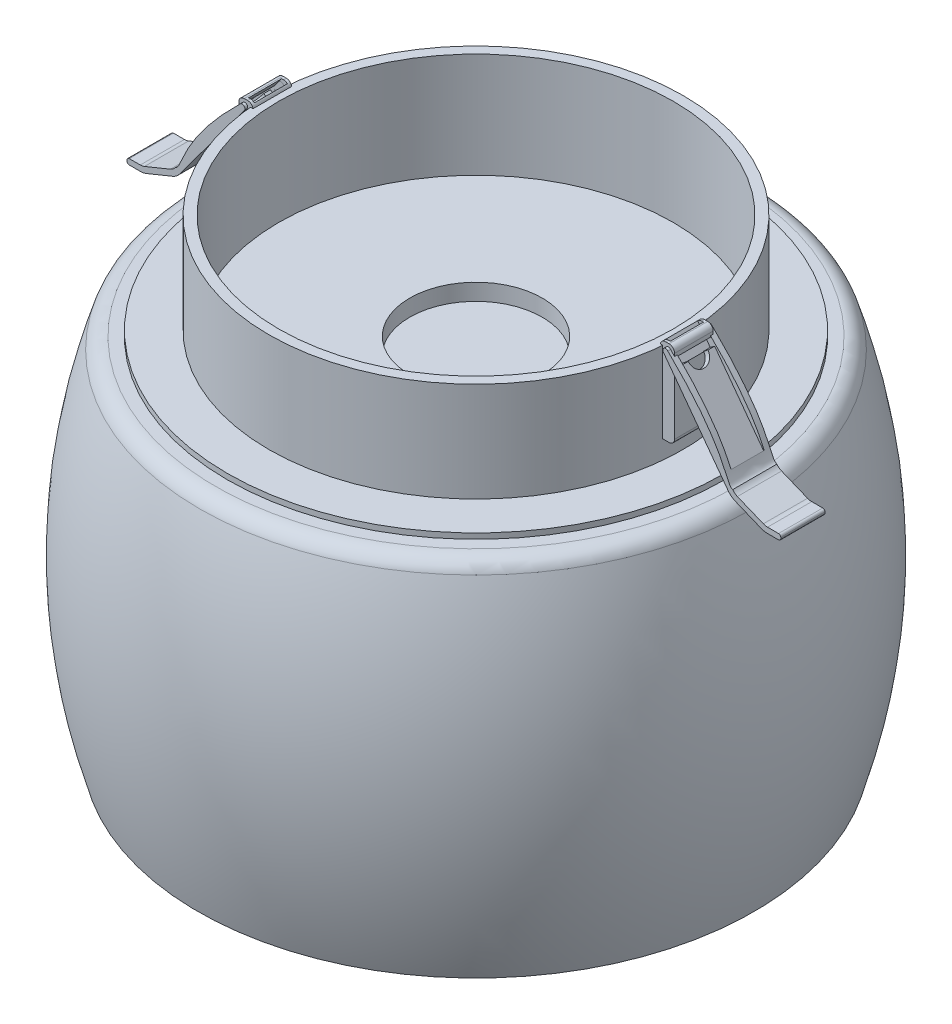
ISO-10303-21;
HEADER;
FILE_DESCRIPTION(('STEP AP214'),'2;1');
FILE_NAME('part.step','',(''),(''),'','','');
FILE_SCHEMA(('AUTOMOTIVE_DESIGN { 1 0 10303 214 1 1 1 1 }'));
ENDSEC;
DATA;
#1=APPLICATION_CONTEXT('core data for automotive mechanical design processes');
#2=APPLICATION_PROTOCOL_DEFINITION('international standard','automotive_design',2000,#1);
#3=PRODUCT_CONTEXT('',#1,'mechanical');
#4=PRODUCT('Part','Part','',(#3));
#5=PRODUCT_RELATED_PRODUCT_CATEGORY('part','',(#4));
#6=PRODUCT_DEFINITION_FORMATION('','',#4);
#7=PRODUCT_DEFINITION_CONTEXT('part definition',#1,'design');
#8=PRODUCT_DEFINITION('design','',#6,#7);
#9=PRODUCT_DEFINITION_SHAPE('','',#8);
#10=(LENGTH_UNIT() NAMED_UNIT(*) SI_UNIT(.MILLI.,.METRE.));
#11=(NAMED_UNIT(*) PLANE_ANGLE_UNIT() SI_UNIT($,.RADIAN.));
#12=(NAMED_UNIT(*) SI_UNIT($,.STERADIAN.) SOLID_ANGLE_UNIT());
#13=UNCERTAINTY_MEASURE_WITH_UNIT(LENGTH_MEASURE(1.E-05),#10,'distance_accuracy_value','');
#14=(GEOMETRIC_REPRESENTATION_CONTEXT(3) GLOBAL_UNCERTAINTY_ASSIGNED_CONTEXT((#13)) GLOBAL_UNIT_ASSIGNED_CONTEXT((#10,
#11,#12)) REPRESENTATION_CONTEXT('',''));
#15=CARTESIAN_POINT('',(0.,0.,0.));
#16=DIRECTION('',(0.,0.,1.));
#17=DIRECTION('',(1.,0.,0.));
#18=AXIS2_PLACEMENT_3D('',#15,#16,#17);
#19=CARTESIAN_POINT('',(-20.259240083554,7.22747379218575,0.));
#20=DIRECTION('',(0.,-1.,0.));
#21=DIRECTION('',(0.,0.,-1.));
#22=AXIS2_PLACEMENT_3D('',#19,#20,#21);
#23=CYLINDRICAL_SURFACE('',#22,45.);
#24=CARTESIAN_POINT('',(-20.259240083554,7.22747379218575,0.));
#25=DIRECTION('',(0.,1.,0.));
#26=DIRECTION('',(0.,0.,1.));
#27=AXIS2_PLACEMENT_3D('',#24,#25,#26);
#28=CIRCLE('',#27,45.);
#29=CARTESIAN_POINT('',(-20.259240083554,7.22747379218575,45.));
#30=VERTEX_POINT('',#29);
#31=EDGE_CURVE('P0_E22',#30,#30,#28,.T.);
#32=ORIENTED_EDGE('',*,*,#31,.F.);
#33=EDGE_LOOP('',(#32));
#34=FACE_BOUND('',#33,.T.);
#35=CARTESIAN_POINT('',(-20.259240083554,6.22747379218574,0.));
#36=DIRECTION('',(0.,1.,0.));
#37=DIRECTION('',(0.,0.,1.));
#38=AXIS2_PLACEMENT_3D('',#35,#36,#37);
#39=CIRCLE('',#38,45.);
#40=CARTESIAN_POINT('',(-20.259240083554,6.22747379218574,45.));
#41=VERTEX_POINT('',#40);
#42=EDGE_CURVE('P0_E27',#41,#41,#39,.T.);
#43=ORIENTED_EDGE('',*,*,#42,.T.);
#44=EDGE_LOOP('',(#43));
#45=FACE_BOUND('',#44,.T.);
#46=ADVANCED_FACE('P0_F15',(#34,#45),#23,.T.);
#47=CARTESIAN_POINT('',(-20.259240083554,7.22747379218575,0.));
#48=DIRECTION('',(0.,1.,0.));
#49=DIRECTION('',(0.,0.,1.));
#50=AXIS2_PLACEMENT_3D('',#47,#48,#49);
#51=PLANE('',#50);
#52=CARTESIAN_POINT('',(-20.259240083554,7.22747379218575,0.));
#53=DIRECTION('',(0.,1.,0.));
#54=DIRECTION('',(0.,0.,1.));
#55=AXIS2_PLACEMENT_3D('',#52,#53,#54);
#56=CIRCLE('',#55,37.5);
#57=CARTESIAN_POINT('',(-20.259240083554,7.22747379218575,37.5));
#58=VERTEX_POINT('',#57);
#59=EDGE_CURVE('P0_E10',#58,#58,#56,.T.);
#60=ORIENTED_EDGE('',*,*,#59,.F.);
#61=EDGE_LOOP('',(#60));
#62=FACE_BOUND('',#61,.T.);
#63=ORIENTED_EDGE('',*,*,#31,.T.);
#64=EDGE_LOOP('',(#63));
#65=FACE_BOUND('',#64,.T.);
#66=ADVANCED_FACE('P0_F60',(#62,#65),#51,.T.);
#67=CARTESIAN_POINT('',(-20.259240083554,6.22747379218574,0.));
#68=DIRECTION('',(0.,1.,0.));
#69=DIRECTION('',(0.,0.,1.));
#70=AXIS2_PLACEMENT_3D('',#67,#68,#69);
#71=PLANE('',#70);
#72=CARTESIAN_POINT('',(-20.259240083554,6.22747379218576,0.));
#73=DIRECTION('',(0.,1.,0.));
#74=DIRECTION('',(0.,0.,1.));
#75=AXIS2_PLACEMENT_3D('',#72,#73,#74);
#76=CIRCLE('',#75,35.7106361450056);
#77=CARTESIAN_POINT('',(-20.259240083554,6.22747379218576,35.7106361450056));
#78=VERTEX_POINT('',#77);
#79=EDGE_CURVE('P0_E39',#78,#78,#76,.T.);
#80=ORIENTED_EDGE('',*,*,#79,.T.);
#81=EDGE_LOOP('',(#80));
#82=FACE_BOUND('',#81,.T.);
#83=ORIENTED_EDGE('',*,*,#42,.F.);
#84=EDGE_LOOP('',(#83));
#85=FACE_BOUND('',#84,.T.);
#86=ADVANCED_FACE('P0_F45',(#82,#85),#71,.F.);
#87=CARTESIAN_POINT('',(-20.259240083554,25.2274737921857,0.));
#88=DIRECTION('',(0.,-1.,0.));
#89=DIRECTION('',(0.,0.,-1.));
#90=AXIS2_PLACEMENT_3D('',#87,#88,#89);
#91=CYLINDRICAL_SURFACE('',#90,37.5);
#92=CARTESIAN_POINT('',(-20.259240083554,25.2274737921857,0.));
#93=DIRECTION('',(0.,1.,0.));
#94=DIRECTION('',(0.,0.,1.));
#95=AXIS2_PLACEMENT_3D('',#92,#93,#94);
#96=CIRCLE('',#95,37.5);
#97=CARTESIAN_POINT('',(-20.259240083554,25.2274737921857,37.5));
#98=VERTEX_POINT('',#97);
#99=EDGE_CURVE('P0_E30',#98,#98,#96,.T.);
#100=ORIENTED_EDGE('',*,*,#99,.F.);
#101=EDGE_LOOP('',(#100));
#102=FACE_BOUND('',#101,.T.);
#103=ORIENTED_EDGE('',*,*,#59,.T.);
#104=EDGE_LOOP('',(#103));
#105=FACE_BOUND('',#104,.T.);
#106=ADVANCED_FACE('P0_F57',(#102,#105),#91,.T.);
#107=CARTESIAN_POINT('',(-20.259240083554,25.2274737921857,0.));
#108=DIRECTION('',(0.,1.,0.));
#109=DIRECTION('',(0.,0.,1.));
#110=AXIS2_PLACEMENT_3D('',#107,#108,#109);
#111=PLANE('',#110);
#112=CARTESIAN_POINT('',(-20.259240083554,25.2274737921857,0.));
#113=DIRECTION('',(0.,1.,0.));
#114=DIRECTION('',(0.,0.,1.));
#115=AXIS2_PLACEMENT_3D('',#112,#113,#114);
#116=CIRCLE('',#115,35.7106361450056);
#117=CARTESIAN_POINT('',(-20.259240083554,25.2274737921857,35.7106361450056));
#118=VERTEX_POINT('',#117);
#119=EDGE_CURVE('P0_E18',#118,#118,#116,.F.);
#120=ORIENTED_EDGE('',*,*,#119,.T.);
#121=EDGE_LOOP('',(#120));
#122=FACE_BOUND('',#121,.T.);
#123=ORIENTED_EDGE('',*,*,#99,.T.);
#124=EDGE_LOOP('',(#123));
#125=FACE_BOUND('',#124,.T.);
#126=ADVANCED_FACE('P0_F50',(#122,#125),#111,.T.);
#127=CARTESIAN_POINT('',(-20.259240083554,40.2274737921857,0.));
#128=DIRECTION('',(0.,-1.,0.));
#129=DIRECTION('',(0.,0.,-1.));
#130=AXIS2_PLACEMENT_3D('',#127,#128,#129);
#131=CYLINDRICAL_SURFACE('',#130,35.7106361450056);
#132=ORIENTED_EDGE('',*,*,#119,.F.);
#133=EDGE_LOOP('',(#132));
#134=FACE_BOUND('',#133,.T.);
#135=ORIENTED_EDGE('',*,*,#79,.F.);
#136=EDGE_LOOP('',(#135));
#137=FACE_BOUND('',#136,.T.);
#138=ADVANCED_FACE('P0_F48',(#134,#137),#131,.F.);
#139=CLOSED_SHELL('',(#46,#66,#86,#106,#126,#138));
#140=MANIFOLD_SOLID_BREP('P0_B1',#139);
#141=CARTESIAN_POINT('',(-57.0922638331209,10.5631851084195,3.5));
#142=DIRECTION('',(-1.,0.,0.));
#143=DIRECTION('',(0.,0.,1.));
#144=AXIS2_PLACEMENT_3D('',#141,#142,#143);
#145=PLANE('',#144);
#146=DIRECTION('',(0.,1.,0.));
#147=VECTOR('',#146,1.);
#148=CARTESIAN_POINT('',(-57.0922638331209,10.5631851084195,-3.5));
#149=LINE('',#148,#147);
#150=CARTESIAN_POINT('',(-57.0922638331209,10.5631851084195,-3.5));
#151=VERTEX_POINT('',#150);
#152=CARTESIAN_POINT('',(-57.0922638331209,25.030671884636,-3.5));
#153=VERTEX_POINT('',#152);
#154=EDGE_CURVE('P1_E188',#151,#153,#149,.T.);
#155=ORIENTED_EDGE('',*,*,#154,.T.);
#156=DIRECTION('',(0.,0.,-1.));
#157=VECTOR('',#156,1.);
#158=CARTESIAN_POINT('',(-57.0922638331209,25.030671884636,3.5));
#159=LINE('',#158,#157);
#160=CARTESIAN_POINT('',(-57.0922638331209,25.030671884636,3.5));
#161=VERTEX_POINT('',#160);
#162=EDGE_CURVE('P1_E238',#161,#153,#159,.T.);
#163=ORIENTED_EDGE('',*,*,#162,.F.);
#164=DIRECTION('',(0.,1.,0.));
#165=VECTOR('',#164,1.);
#166=CARTESIAN_POINT('',(-57.0922638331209,10.5631851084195,3.5));
#167=LINE('',#166,#165);
#168=CARTESIAN_POINT('',(-57.0922638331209,10.5631851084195,3.5));
#169=VERTEX_POINT('',#168);
#170=EDGE_CURVE('P1_E189',#169,#161,#167,.T.);
#171=ORIENTED_EDGE('',*,*,#170,.F.);
#172=DIRECTION('',(0.,0.,-1.));
#173=VECTOR('',#172,1.);
#174=CARTESIAN_POINT('',(-57.0922638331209,10.5631851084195,3.5));
#175=LINE('',#174,#173);
#176=EDGE_CURVE('P1_E205',#169,#151,#175,.T.);
#177=ORIENTED_EDGE('',*,*,#176,.T.);
#178=EDGE_LOOP('',(#155,#163,#171,#177));
#179=FACE_BOUND('',#178,.T.);
#180=ADVANCED_FACE('P1_F17',(#179),#145,.F.);
#181=CARTESIAN_POINT('',(-58.0922638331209,25.030671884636,3.5));
#182=DIRECTION('',(0.,0.,-1.));
#183=DIRECTION('',(-1.,0.,0.));
#184=AXIS2_PLACEMENT_3D('',#181,#182,#183);
#185=CYLINDRICAL_SURFACE('',#184,1.);
#186=DIRECTION('',(0.,0.,-1.));
#187=VECTOR('',#186,1.);
#188=CARTESIAN_POINT('',(-58.0922638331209,26.030671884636,3.5));
#189=LINE('',#188,#187);
#190=CARTESIAN_POINT('',(-58.0922638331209,26.030671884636,-3.));
#191=VERTEX_POINT('',#190);
#192=CARTESIAN_POINT('',(-58.0922638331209,26.030671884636,-3.5));
#193=VERTEX_POINT('',#192);
#194=EDGE_CURVE('P1_E234',#191,#193,#189,.T.);
#195=ORIENTED_EDGE('',*,*,#194,.F.);
#196=CARTESIAN_POINT('',(-58.0922638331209,25.030671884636,-3.));
#197=DIRECTION('',(0.,0.,-1.));
#198=DIRECTION('',(-1.,0.,0.));
#199=AXIS2_PLACEMENT_3D('',#196,#197,#198);
#200=CIRCLE('',#199,1.);
#201=CARTESIAN_POINT('',(-57.3943063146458,25.7468110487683,-3.));
#202=VERTEX_POINT('',#201);
#203=EDGE_CURVE('P1_E186',#191,#202,#200,.T.);
#204=ORIENTED_EDGE('',*,*,#203,.T.);
#205=DIRECTION('',(0.,0.,-1.));
#206=VECTOR('',#205,1.);
#207=CARTESIAN_POINT('',(-57.3943063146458,25.7468110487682,3.5));
#208=LINE('',#207,#206);
#209=CARTESIAN_POINT('',(-57.3943063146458,25.7468110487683,2.9851983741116));
#210=VERTEX_POINT('',#209);
#211=EDGE_CURVE('P1_E138',#210,#202,#208,.T.);
#212=ORIENTED_EDGE('',*,*,#211,.F.);
#213=CARTESIAN_POINT('',(-58.0922638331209,25.030671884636,2.9851983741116));
#214=DIRECTION('',(0.,0.,1.));
#215=DIRECTION('',(0.,-1.,0.));
#216=AXIS2_PLACEMENT_3D('',#213,#214,#215);
#217=CIRCLE('',#216,1.);
#218=CARTESIAN_POINT('',(-58.0922638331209,26.030671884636,2.9851983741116));
#219=VERTEX_POINT('',#218);
#220=EDGE_CURVE('P1_E180',#210,#219,#217,.T.);
#221=ORIENTED_EDGE('',*,*,#220,.T.);
#222=CARTESIAN_POINT('',(-58.0922638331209,26.030671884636,3.5));
#223=VERTEX_POINT('',#222);
#224=EDGE_CURVE('P1_E235',#223,#219,#189,.T.);
#225=ORIENTED_EDGE('',*,*,#224,.F.);
#226=CARTESIAN_POINT('',(-58.0922638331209,25.030671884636,3.5));
#227=DIRECTION('',(0.,0.,1.));
#228=DIRECTION('',(-1.,0.,0.));
#229=AXIS2_PLACEMENT_3D('',#226,#227,#228);
#230=CIRCLE('',#229,1.);
#231=EDGE_CURVE('P1_E192',#161,#223,#230,.T.);
#232=ORIENTED_EDGE('',*,*,#231,.F.);
#233=ORIENTED_EDGE('',*,*,#162,.T.);
#234=CARTESIAN_POINT('',(-58.0922638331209,25.030671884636,-3.5));
#235=DIRECTION('',(0.,0.,1.));
#236=DIRECTION('',(-1.,0.,0.));
#237=AXIS2_PLACEMENT_3D('',#234,#235,#236);
#238=CIRCLE('',#237,1.);
#239=EDGE_CURVE('P1_E208',#153,#193,#238,.T.);
#240=ORIENTED_EDGE('',*,*,#239,.T.);
#241=EDGE_LOOP('',(#195,#204,#212,#221,#225,#232,#233,#240));
#242=FACE_BOUND('',#241,.T.);
#243=ADVANCED_FACE('P1_F297',(#242),#185,.T.);
#244=CARTESIAN_POINT('',(-58.7015107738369,26.030671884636,3.5));
#245=DIRECTION('',(0.,-1.,0.));
#246=DIRECTION('',(0.,0.,-1.));
#247=AXIS2_PLACEMENT_3D('',#244,#245,#246);
#248=PLANE('',#247);
#249=DIRECTION('',(0.,0.,-1.));
#250=VECTOR('',#249,1.);
#251=CARTESIAN_POINT('',(-58.4284480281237,26.030671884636,3.5));
#252=LINE('',#251,#250);
#253=CARTESIAN_POINT('',(-58.4284480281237,26.030671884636,2.9851983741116));
#254=VERTEX_POINT('',#253);
#255=CARTESIAN_POINT('',(-58.4284480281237,26.030671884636,-3.));
#256=VERTEX_POINT('',#255);
#257=EDGE_CURVE('P1_E169',#254,#256,#252,.T.);
#258=ORIENTED_EDGE('',*,*,#257,.T.);
#259=DIRECTION('',(1.,0.,0.));
#260=VECTOR('',#259,1.);
#261=CARTESIAN_POINT('',(-58.7015107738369,26.030671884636,-3.));
#262=LINE('',#261,#260);
#263=EDGE_CURVE('P1_E183',#256,#191,#262,.T.);
#264=ORIENTED_EDGE('',*,*,#263,.T.);
#265=ORIENTED_EDGE('',*,*,#194,.T.);
#266=DIRECTION('',(-1.,0.,0.));
#267=VECTOR('',#266,1.);
#268=CARTESIAN_POINT('',(-58.7015107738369,26.030671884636,-3.5));
#269=LINE('',#268,#267);
#270=CARTESIAN_POINT('',(-58.7015107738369,26.030671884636,-3.5));
#271=VERTEX_POINT('',#270);
#272=EDGE_CURVE('P1_E211',#193,#271,#269,.T.);
#273=ORIENTED_EDGE('',*,*,#272,.T.);
#274=DIRECTION('',(0.,0.,-1.));
#275=VECTOR('',#274,1.);
#276=CARTESIAN_POINT('',(-58.7015107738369,26.030671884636,3.5));
#277=LINE('',#276,#275);
#278=CARTESIAN_POINT('',(-58.7015107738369,26.030671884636,3.5));
#279=VERTEX_POINT('',#278);
#280=EDGE_CURVE('P1_E231',#279,#271,#277,.T.);
#281=ORIENTED_EDGE('',*,*,#280,.F.);
#282=DIRECTION('',(-1.,0.,0.));
#283=VECTOR('',#282,1.);
#284=CARTESIAN_POINT('',(-58.7015107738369,26.030671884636,3.5));
#285=LINE('',#284,#283);
#286=EDGE_CURVE('P1_E195',#223,#279,#285,.T.);
#287=ORIENTED_EDGE('',*,*,#286,.F.);
#288=ORIENTED_EDGE('',*,*,#224,.T.);
#289=DIRECTION('',(-1.,0.,0.));
#290=VECTOR('',#289,1.);
#291=CARTESIAN_POINT('',(-58.7015107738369,26.030671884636,2.9851983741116));
#292=LINE('',#291,#290);
#293=EDGE_CURVE('P1_E177',#219,#254,#292,.T.);
#294=ORIENTED_EDGE('',*,*,#293,.T.);
#295=EDGE_LOOP('',(#258,#264,#265,#273,#281,#287,#288,#294));
#296=FACE_BOUND('',#295,.T.);
#297=ADVANCED_FACE('P1_F294',(#296),#248,.F.);
#298=CARTESIAN_POINT('',(-58.7015107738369,25.030671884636,3.5));
#299=DIRECTION('',(0.,0.,-1.));
#300=DIRECTION('',(-1.,0.,0.));
#301=AXIS2_PLACEMENT_3D('',#298,#299,#300);
#302=CYLINDRICAL_SURFACE('',#301,1.);
#303=CARTESIAN_POINT('',(-58.7015107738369,25.030671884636,-3.5));
#304=DIRECTION('',(0.,0.,1.));
#305=DIRECTION('',(-1.,0.,0.));
#306=AXIS2_PLACEMENT_3D('',#303,#304,#305);
#307=CIRCLE('',#306,1.);
#308=CARTESIAN_POINT('',(-59.7015107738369,25.030671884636,-3.5));
#309=VERTEX_POINT('',#308);
#310=EDGE_CURVE('P1_E213',#271,#309,#307,.T.);
#311=ORIENTED_EDGE('',*,*,#310,.T.);
#312=DIRECTION('',(0.,0.,-1.));
#313=VECTOR('',#312,1.);
#314=CARTESIAN_POINT('',(-59.7015107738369,25.030671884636,3.5));
#315=LINE('',#314,#313);
#316=CARTESIAN_POINT('',(-59.7015107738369,25.030671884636,3.5));
#317=VERTEX_POINT('',#316);
#318=EDGE_CURVE('P1_E228',#317,#309,#315,.T.);
#319=ORIENTED_EDGE('',*,*,#318,.F.);
#320=CARTESIAN_POINT('',(-58.7015107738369,25.030671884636,3.5));
#321=DIRECTION('',(0.,0.,1.));
#322=DIRECTION('',(-1.,0.,0.));
#323=AXIS2_PLACEMENT_3D('',#320,#321,#322);
#324=CIRCLE('',#323,1.);
#325=EDGE_CURVE('P1_E197',#279,#317,#324,.T.);
#326=ORIENTED_EDGE('',*,*,#325,.F.);
#327=ORIENTED_EDGE('',*,*,#280,.T.);
#328=EDGE_LOOP('',(#311,#319,#326,#327));
#329=FACE_BOUND('',#328,.T.);
#330=ADVANCED_FACE('P1_F263',(#329),#302,.T.);
#331=CARTESIAN_POINT('',(-59.7015107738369,11.5631851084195,3.5));
#332=DIRECTION('',(1.,0.,0.));
#333=DIRECTION('',(0.,0.,-1.));
#334=AXIS2_PLACEMENT_3D('',#331,#332,#333);
#335=PLANE('',#334);
#336=DIRECTION('',(0.,0.,-1.));
#337=VECTOR('',#336,1.);
#338=CARTESIAN_POINT('',(-59.7015107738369,22.7253617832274,3.5));
#339=LINE('',#338,#337);
#340=CARTESIAN_POINT('',(-59.7015107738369,22.7253617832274,2.9851983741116));
#341=VERTEX_POINT('',#340);
#342=CARTESIAN_POINT('',(-59.7015107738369,22.7253617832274,1.77998688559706));
#343=VERTEX_POINT('',#342);
#344=EDGE_CURVE('P1_E250',#341,#343,#339,.T.);
#345=ORIENTED_EDGE('',*,*,#344,.T.);
#346=CARTESIAN_POINT('',(-59.7015107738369,22.7253617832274,-0.00740081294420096));
#347=DIRECTION('',(1.,0.,0.));
#348=DIRECTION('',(0.,1.,0.));
#349=AXIS2_PLACEMENT_3D('',#346,#347,#348);
#350=ELLIPSE('',#349,2.22414764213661,1.78738769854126);
#351=CARTESIAN_POINT('',(-59.7015107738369,22.6313083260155,1.77838804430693));
#352=VERTEX_POINT('',#351);
#353=EDGE_CURVE('P1_E11',#343,#352,#350,.T.);
#354=ORIENTED_EDGE('',*,*,#353,.T.);
#355=DIRECTION('',(0.,0.,1.));
#356=VECTOR('',#355,1.);
#357=CARTESIAN_POINT('',(-59.7015107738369,22.6313083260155,3.5));
#358=LINE('',#357,#356);
#359=CARTESIAN_POINT('',(-59.7015107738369,22.6313083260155,-1.79318967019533));
#360=VERTEX_POINT('',#359);
#361=EDGE_CURVE('P1_E20',#360,#352,#358,.T.);
#362=ORIENTED_EDGE('',*,*,#361,.F.);
#363=CARTESIAN_POINT('',(-59.7015107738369,22.7253617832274,-1.79478851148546));
#364=VERTEX_POINT('',#363);
#365=EDGE_CURVE('P1_E26',#360,#364,#350,.T.);
#366=ORIENTED_EDGE('',*,*,#365,.T.);
#367=DIRECTION('',(0.,0.,-1.));
#368=VECTOR('',#367,1.);
#369=CARTESIAN_POINT('',(-59.7015107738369,22.7253617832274,3.5));
#370=LINE('',#369,#368);
#371=CARTESIAN_POINT('',(-59.7015107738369,22.7253617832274,-3.));
#372=VERTEX_POINT('',#371);
#373=EDGE_CURVE('P1_E248',#364,#372,#370,.T.);
#374=ORIENTED_EDGE('',*,*,#373,.T.);
#375=DIRECTION('',(0.,1.,0.));
#376=VECTOR('',#375,1.);
#377=CARTESIAN_POINT('',(-59.7015107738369,11.5631851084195,-3.));
#378=LINE('',#377,#376);
#379=CARTESIAN_POINT('',(-59.7015107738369,24.311608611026,-3.));
#380=VERTEX_POINT('',#379);
#381=EDGE_CURVE('P1_E146',#372,#380,#378,.T.);
#382=ORIENTED_EDGE('',*,*,#381,.T.);
#383=DIRECTION('',(0.,0.,1.));
#384=VECTOR('',#383,1.);
#385=CARTESIAN_POINT('',(-59.7015107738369,24.311608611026,3.5));
#386=LINE('',#385,#384);
#387=CARTESIAN_POINT('',(-59.7015107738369,24.311608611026,2.9851983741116));
#388=VERTEX_POINT('',#387);
#389=EDGE_CURVE('P1_E241',#380,#388,#386,.T.);
#390=ORIENTED_EDGE('',*,*,#389,.T.);
#391=DIRECTION('',(0.,-1.,0.));
#392=VECTOR('',#391,1.);
#393=CARTESIAN_POINT('',(-59.7015107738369,11.5631851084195,2.9851983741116));
#394=LINE('',#393,#392);
#395=EDGE_CURVE('P1_E244',#388,#341,#394,.T.);
#396=ORIENTED_EDGE('',*,*,#395,.T.);
#397=EDGE_LOOP('',(#345,#354,#362,#366,#374,#382,#390,#396));
#398=FACE_BOUND('',#397,.T.);
#399=DIRECTION('',(0.,-1.,0.));
#400=VECTOR('',#399,1.);
#401=CARTESIAN_POINT('',(-59.7015107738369,11.5631851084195,-3.5));
#402=LINE('',#401,#400);
#403=CARTESIAN_POINT('',(-59.7015107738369,11.5631851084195,-3.5));
#404=VERTEX_POINT('',#403);
#405=EDGE_CURVE('P1_E215',#309,#404,#402,.T.);
#406=ORIENTED_EDGE('',*,*,#405,.T.);
#407=DIRECTION('',(0.,0.,-1.));
#408=VECTOR('',#407,1.);
#409=CARTESIAN_POINT('',(-59.7015107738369,11.5631851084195,3.5));
#410=LINE('',#409,#408);
#411=CARTESIAN_POINT('',(-59.7015107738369,11.5631851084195,3.5));
#412=VERTEX_POINT('',#411);
#413=EDGE_CURVE('P1_E225',#412,#404,#410,.T.);
#414=ORIENTED_EDGE('',*,*,#413,.F.);
#415=DIRECTION('',(0.,-1.,0.));
#416=VECTOR('',#415,1.);
#417=CARTESIAN_POINT('',(-59.7015107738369,11.5631851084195,3.5));
#418=LINE('',#417,#416);
#419=EDGE_CURVE('P1_E199',#317,#412,#418,.T.);
#420=ORIENTED_EDGE('',*,*,#419,.F.);
#421=ORIENTED_EDGE('',*,*,#318,.T.);
#422=EDGE_LOOP('',(#406,#414,#420,#421));
#423=FACE_BOUND('',#422,.T.);
#424=ADVANCED_FACE('P1_F259',(#398,#423),#335,.F.);
#425=CARTESIAN_POINT('',(-58.7015107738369,11.5631851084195,3.5));
#426=DIRECTION('',(0.,0.,-1.));
#427=DIRECTION('',(-1.,0.,0.));
#428=AXIS2_PLACEMENT_3D('',#425,#426,#427);
#429=CYLINDRICAL_SURFACE('',#428,1.);
#430=CARTESIAN_POINT('',(-58.7015107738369,11.5631851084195,-3.5));
#431=DIRECTION('',(0.,0.,1.));
#432=DIRECTION('',(-1.,0.,0.));
#433=AXIS2_PLACEMENT_3D('',#430,#431,#432);
#434=CIRCLE('',#433,1.);
#435=CARTESIAN_POINT('',(-58.7015107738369,10.5631851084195,-3.5));
#436=VERTEX_POINT('',#435);
#437=EDGE_CURVE('P1_E217',#404,#436,#434,.T.);
#438=ORIENTED_EDGE('',*,*,#437,.T.);
#439=DIRECTION('',(0.,0.,-1.));
#440=VECTOR('',#439,1.);
#441=CARTESIAN_POINT('',(-58.7015107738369,10.5631851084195,3.5));
#442=LINE('',#441,#440);
#443=CARTESIAN_POINT('',(-58.7015107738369,10.5631851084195,3.5));
#444=VERTEX_POINT('',#443);
#445=EDGE_CURVE('P1_E222',#444,#436,#442,.T.);
#446=ORIENTED_EDGE('',*,*,#445,.F.);
#447=CARTESIAN_POINT('',(-58.7015107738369,11.5631851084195,3.5));
#448=DIRECTION('',(0.,0.,1.));
#449=DIRECTION('',(-1.,0.,0.));
#450=AXIS2_PLACEMENT_3D('',#447,#448,#449);
#451=CIRCLE('',#450,1.);
#452=EDGE_CURVE('P1_E201',#412,#444,#451,.T.);
#453=ORIENTED_EDGE('',*,*,#452,.F.);
#454=ORIENTED_EDGE('',*,*,#413,.T.);
#455=EDGE_LOOP('',(#438,#446,#453,#454));
#456=FACE_BOUND('',#455,.T.);
#457=ADVANCED_FACE('P1_F262',(#456),#429,.T.);
#458=CARTESIAN_POINT('',(-58.7015107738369,10.5631851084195,3.5));
#459=DIRECTION('',(0.,1.,0.));
#460=DIRECTION('',(0.,0.,1.));
#461=AXIS2_PLACEMENT_3D('',#458,#459,#460);
#462=PLANE('',#461);
#463=DIRECTION('',(1.,0.,0.));
#464=VECTOR('',#463,1.);
#465=CARTESIAN_POINT('',(-58.7015107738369,10.5631851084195,-3.5));
#466=LINE('',#465,#464);
#467=EDGE_CURVE('P1_E193',#436,#151,#466,.T.);
#468=ORIENTED_EDGE('',*,*,#467,.T.);
#469=ORIENTED_EDGE('',*,*,#176,.F.);
#470=DIRECTION('',(1.,0.,0.));
#471=VECTOR('',#470,1.);
#472=CARTESIAN_POINT('',(-58.7015107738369,10.5631851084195,3.5));
#473=LINE('',#472,#471);
#474=EDGE_CURVE('P1_E203',#444,#169,#473,.T.);
#475=ORIENTED_EDGE('',*,*,#474,.F.);
#476=ORIENTED_EDGE('',*,*,#445,.T.);
#477=EDGE_LOOP('',(#468,#469,#475,#476));
#478=FACE_BOUND('',#477,.T.);
#479=ADVANCED_FACE('P1_F280',(#478),#462,.F.);
#480=CARTESIAN_POINT('',(-58.0922638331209,25.030671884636,3.5));
#481=DIRECTION('',(0.,0.,-1.));
#482=DIRECTION('',(-1.,0.,0.));
#483=AXIS2_PLACEMENT_3D('',#480,#481,#482);
#484=PLANE('',#483);
#485=ORIENTED_EDGE('',*,*,#170,.T.);
#486=ORIENTED_EDGE('',*,*,#231,.T.);
#487=ORIENTED_EDGE('',*,*,#286,.T.);
#488=ORIENTED_EDGE('',*,*,#325,.T.);
#489=ORIENTED_EDGE('',*,*,#419,.T.);
#490=ORIENTED_EDGE('',*,*,#452,.T.);
#491=ORIENTED_EDGE('',*,*,#474,.T.);
#492=EDGE_LOOP('',(#485,#486,#487,#488,#489,#490,#491));
#493=FACE_BOUND('',#492,.T.);
#494=ADVANCED_FACE('P1_F286',(#493),#484,.F.);
#495=CARTESIAN_POINT('',(-58.0922638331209,25.030671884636,-3.5));
#496=DIRECTION('',(0.,0.,-1.));
#497=DIRECTION('',(-1.,0.,0.));
#498=AXIS2_PLACEMENT_3D('',#495,#496,#497);
#499=PLANE('',#498);
#500=ORIENTED_EDGE('',*,*,#154,.F.);
#501=ORIENTED_EDGE('',*,*,#467,.F.);
#502=ORIENTED_EDGE('',*,*,#437,.F.);
#503=ORIENTED_EDGE('',*,*,#405,.F.);
#504=ORIENTED_EDGE('',*,*,#310,.F.);
#505=ORIENTED_EDGE('',*,*,#272,.F.);
#506=ORIENTED_EDGE('',*,*,#239,.F.);
#507=EDGE_LOOP('',(#500,#501,#502,#503,#504,#505,#506));
#508=FACE_BOUND('',#507,.T.);
#509=ADVANCED_FACE('P1_F277',(#508),#499,.T.);
#510=CARTESIAN_POINT('',(-53.1910960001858,31.4225599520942,-3.));
#511=DIRECTION('',(0.,0.,-1.));
#512=DIRECTION('',(-1.,0.,0.));
#513=AXIS2_PLACEMENT_3D('',#510,#511,#512);
#514=PLANE('',#513);
#515=ORIENTED_EDGE('',*,*,#263,.F.);
#516=DIRECTION('',(-0.595131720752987,-0.803628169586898,0.));
#517=VECTOR('',#516,1.);
#518=CARTESIAN_POINT('',(-53.9947241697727,32.0176916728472,-3.));
#519=LINE('',#518,#517);
#520=EDGE_CURVE('P1_E33',#256,#380,#519,.T.);
#521=ORIENTED_EDGE('',*,*,#520,.T.);
#522=ORIENTED_EDGE('',*,*,#381,.F.);
#523=DIRECTION('',(-0.803628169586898,0.595131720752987,0.));
#524=VECTOR('',#523,1.);
#525=CARTESIAN_POINT('',(-59.6565283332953,22.6920497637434,-3.));
#526=LINE('',#525,#524);
#527=CARTESIAN_POINT('',(-59.6565283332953,22.6920497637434,-3.));
#528=VERTEX_POINT('',#527);
#529=EDGE_CURVE('P1_E143',#528,#372,#526,.T.);
#530=ORIENTED_EDGE('',*,*,#529,.F.);
#531=DIRECTION('',(-0.595131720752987,-0.803628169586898,0.));
#532=VECTOR('',#531,1.);
#533=CARTESIAN_POINT('',(-53.1910960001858,31.4225599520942,-3.));
#534=LINE('',#533,#532);
#535=EDGE_CURVE('P1_E130',#202,#528,#534,.T.);
#536=ORIENTED_EDGE('',*,*,#535,.F.);
#537=ORIENTED_EDGE('',*,*,#203,.F.);
#538=EDGE_LOOP('',(#515,#521,#522,#530,#536,#537));
#539=FACE_BOUND('',#538,.T.);
#540=ADVANCED_FACE('P1_F144',(#539),#514,.F.);
#541=CARTESIAN_POINT('',(-53.1910960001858,31.4225599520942,2.9851983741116));
#542=DIRECTION('',(0.,0.,1.));
#543=DIRECTION('',(0.,-1.,0.));
#544=AXIS2_PLACEMENT_3D('',#541,#542,#543);
#545=PLANE('',#544);
#546=DIRECTION('',(0.595131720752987,0.803628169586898,0.));
#547=VECTOR('',#546,1.);
#548=CARTESIAN_POINT('',(-53.1910960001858,31.4225599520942,2.9851983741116));
#549=LINE('',#548,#547);
#550=CARTESIAN_POINT('',(-59.6565283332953,22.6920497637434,2.9851983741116));
#551=VERTEX_POINT('',#550);
#552=EDGE_CURVE('P1_E150',#551,#210,#549,.T.);
#553=ORIENTED_EDGE('',*,*,#552,.F.);
#554=DIRECTION('',(-0.803628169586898,0.595131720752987,0.));
#555=VECTOR('',#554,1.);
#556=CARTESIAN_POINT('',(-59.6565283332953,22.6920497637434,2.9851983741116));
#557=LINE('',#556,#555);
#558=EDGE_CURVE('P1_E166',#551,#341,#557,.T.);
#559=ORIENTED_EDGE('',*,*,#558,.T.);
#560=ORIENTED_EDGE('',*,*,#395,.F.);
#561=DIRECTION('',(0.595131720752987,0.803628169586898,0.));
#562=VECTOR('',#561,1.);
#563=CARTESIAN_POINT('',(-53.9947241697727,32.0176916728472,2.9851983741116));
#564=LINE('',#563,#562);
#565=EDGE_CURVE('P1_E38',#388,#254,#564,.T.);
#566=ORIENTED_EDGE('',*,*,#565,.T.);
#567=ORIENTED_EDGE('',*,*,#293,.F.);
#568=ORIENTED_EDGE('',*,*,#220,.F.);
#569=EDGE_LOOP('',(#553,#559,#560,#566,#567,#568));
#570=FACE_BOUND('',#569,.T.);
#571=ADVANCED_FACE('P1_F300',(#570),#545,.F.);
#572=CARTESIAN_POINT('',(-59.6565283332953,22.6920497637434,1.77998688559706));
#573=DIRECTION('',(-0.595131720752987,-0.803628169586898,0.));
#574=DIRECTION('',(0.803628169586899,-0.595131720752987,0.));
#575=AXIS2_PLACEMENT_3D('',#572,#573,#574);
#576=PLANE('',#575);
#577=ORIENTED_EDGE('',*,*,#558,.F.);
#578=DIRECTION('',(0.,0.,1.));
#579=VECTOR('',#578,1.);
#580=CARTESIAN_POINT('',(-59.6565283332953,22.6920497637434,1.77998688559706));
#581=LINE('',#580,#579);
#582=CARTESIAN_POINT('',(-59.6565283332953,22.6920497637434,1.77998688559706));
#583=VERTEX_POINT('',#582);
#584=EDGE_CURVE('P1_E160',#583,#551,#581,.T.);
#585=ORIENTED_EDGE('',*,*,#584,.F.);
#586=DIRECTION('',(-0.803628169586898,0.595131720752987,0.));
#587=VECTOR('',#586,1.);
#588=CARTESIAN_POINT('',(-59.6565283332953,22.6920497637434,1.77998688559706));
#589=LINE('',#588,#587);
#590=EDGE_CURVE('P1_E170',#583,#343,#589,.T.);
#591=ORIENTED_EDGE('',*,*,#590,.T.);
#592=ORIENTED_EDGE('',*,*,#344,.F.);
#593=EDGE_LOOP('',(#577,#585,#591,#592));
#594=FACE_BOUND('',#593,.T.);
#595=ADVANCED_FACE('P1_F336',(#594),#576,.F.);
#596=CARTESIAN_POINT('',(-59.6565283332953,22.6920497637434,-0.00740081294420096));
#597=DIRECTION('',(-0.803628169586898,0.595131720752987,0.));
#598=DIRECTION('',(-0.595131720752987,-0.803628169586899,0.));
#599=AXIS2_PLACEMENT_3D('',#596,#597,#598);
#600=CYLINDRICAL_SURFACE('',#599,1.78738769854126);
#601=ORIENTED_EDGE('',*,*,#590,.F.);
#602=CARTESIAN_POINT('',(-59.6565283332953,22.6920497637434,-0.00740081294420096));
#603=DIRECTION('',(-0.803628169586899,0.595131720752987,0.));
#604=DIRECTION('',(-0.595131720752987,-0.803628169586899,0.));
#605=AXIS2_PLACEMENT_3D('',#602,#603,#604);
#606=CIRCLE('',#605,1.78738769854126);
#607=EDGE_CURVE('P1_E155',#352,#583,#606,.T.);
#608=ORIENTED_EDGE('',*,*,#607,.F.);
#609=ORIENTED_EDGE('',*,*,#353,.F.);
#610=EDGE_LOOP('',(#601,#608,#609));
#611=FACE_BOUND('',#610,.T.);
#612=ADVANCED_FACE('P1_F257',(#611),#600,.F.);
#613=CARTESIAN_POINT('',(-59.6565283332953,22.6920497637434,-1.79478851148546));
#614=VERTEX_POINT('',#613);
#615=EDGE_CURVE('P1_E157',#614,#360,#606,.T.);
#616=ORIENTED_EDGE('',*,*,#615,.F.);
#617=DIRECTION('',(-0.803628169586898,0.595131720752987,0.));
#618=VECTOR('',#617,1.);
#619=CARTESIAN_POINT('',(-59.6565283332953,22.6920497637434,-1.79478851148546));
#620=LINE('',#619,#618);
#621=EDGE_CURVE('P1_E149',#614,#364,#620,.T.);
#622=ORIENTED_EDGE('',*,*,#621,.T.);
#623=ORIENTED_EDGE('',*,*,#365,.F.);
#624=EDGE_LOOP('',(#616,#622,#623));
#625=FACE_BOUND('',#624,.T.);
#626=ADVANCED_FACE('P1_F333',(#625),#600,.F.);
#627=CARTESIAN_POINT('',(-59.6565283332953,22.6920497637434,-3.));
#628=DIRECTION('',(-0.595131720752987,-0.803628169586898,0.));
#629=DIRECTION('',(0.803628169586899,-0.595131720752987,0.));
#630=AXIS2_PLACEMENT_3D('',#627,#628,#629);
#631=PLANE('',#630);
#632=ORIENTED_EDGE('',*,*,#621,.F.);
#633=DIRECTION('',(0.,0.,1.));
#634=VECTOR('',#633,1.);
#635=CARTESIAN_POINT('',(-59.6565283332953,22.6920497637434,-3.));
#636=LINE('',#635,#634);
#637=EDGE_CURVE('P1_E135',#528,#614,#636,.T.);
#638=ORIENTED_EDGE('',*,*,#637,.F.);
#639=ORIENTED_EDGE('',*,*,#529,.T.);
#640=ORIENTED_EDGE('',*,*,#373,.F.);
#641=EDGE_LOOP('',(#632,#638,#639,#640));
#642=FACE_BOUND('',#641,.T.);
#643=ADVANCED_FACE('P1_F152',(#642),#631,.F.);
#644=CARTESIAN_POINT('',(-59.6565283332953,22.6920497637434,-0.00740081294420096));
#645=DIRECTION('',(-0.803628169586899,0.595131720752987,0.));
#646=DIRECTION('',(-0.595131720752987,-0.803628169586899,0.));
#647=AXIS2_PLACEMENT_3D('',#644,#645,#646);
#648=PLANE('',#647);
#649=ORIENTED_EDGE('',*,*,#211,.T.);
#650=ORIENTED_EDGE('',*,*,#535,.T.);
#651=ORIENTED_EDGE('',*,*,#637,.T.);
#652=ORIENTED_EDGE('',*,*,#615,.T.);
#653=ORIENTED_EDGE('',*,*,#361,.T.);
#654=ORIENTED_EDGE('',*,*,#607,.T.);
#655=ORIENTED_EDGE('',*,*,#584,.T.);
#656=ORIENTED_EDGE('',*,*,#552,.T.);
#657=EDGE_LOOP('',(#649,#650,#651,#652,#653,#654,#655,#656));
#658=FACE_BOUND('',#657,.T.);
#659=ADVANCED_FACE('P1_F132',(#658),#648,.T.);
#660=CARTESIAN_POINT('',(-60.4601565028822,23.2871814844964,-0.00740081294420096));
#661=DIRECTION('',(-0.803628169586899,0.595131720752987,0.));
#662=DIRECTION('',(-0.595131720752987,-0.803628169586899,0.));
#663=AXIS2_PLACEMENT_3D('',#660,#661,#662);
#664=PLANE('',#663);
#665=ORIENTED_EDGE('',*,*,#565,.F.);
#666=ORIENTED_EDGE('',*,*,#389,.F.);
#667=ORIENTED_EDGE('',*,*,#520,.F.);
#668=ORIENTED_EDGE('',*,*,#257,.F.);
#669=EDGE_LOOP('',(#665,#666,#667,#668));
#670=FACE_BOUND('',#669,.T.);
#671=ADVANCED_FACE('P1_F301',(#670),#664,.F.);
#672=CLOSED_SHELL('',(#180,#243,#297,#330,#424,#457,#479,#494,#509,#540,#571,#595,#612,#626,
#643,#659,#671));
#673=MANIFOLD_SOLID_BREP('P1_B1',#672);
#674=CARTESIAN_POINT('',(-58.5857395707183,24.9781252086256,4.));
#675=DIRECTION('',(0.,0.,-1.));
#676=DIRECTION('',(-1.,0.,0.));
#677=AXIS2_PLACEMENT_3D('',#674,#675,#676);
#678=CYLINDRICAL_SURFACE('',#677,0.500000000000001);
#679=DIRECTION('',(0.,0.,-1.));
#680=VECTOR('',#679,1.);
#681=CARTESIAN_POINT('',(-58.9875536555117,25.2756910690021,4.));
#682=LINE('',#681,#680);
#683=CARTESIAN_POINT('',(-58.9875536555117,25.2756910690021,-3.));
#684=VERTEX_POINT('',#683);
#685=CARTESIAN_POINT('',(-58.9875536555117,25.2756910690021,-4.));
#686=VERTEX_POINT('',#685);
#687=EDGE_CURVE('P2_E25',#684,#686,#682,.T.);
#688=ORIENTED_EDGE('',*,*,#687,.F.);
#689=CARTESIAN_POINT('',(-58.5857395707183,24.9781252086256,-3.));
#690=DIRECTION('',(0.,0.,-1.));
#691=DIRECTION('',(-1.,0.,0.));
#692=AXIS2_PLACEMENT_3D('',#689,#690,#691);
#693=CIRCLE('',#692,0.500000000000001);
#694=CARTESIAN_POINT('',(-58.1839254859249,24.6805593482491,-3.));
#695=VERTEX_POINT('',#694);
#696=EDGE_CURVE('P2_E308',#684,#695,#693,.T.);
#697=ORIENTED_EDGE('',*,*,#696,.T.);
#698=DIRECTION('',(0.,0.,-1.));
#699=VECTOR('',#698,1.);
#700=CARTESIAN_POINT('',(-58.1839254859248,24.6805593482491,4.));
#701=LINE('',#700,#699);
#702=CARTESIAN_POINT('',(-58.1839254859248,24.6805593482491,-4.));
#703=VERTEX_POINT('',#702);
#704=EDGE_CURVE('P2_E93',#695,#703,#701,.T.);
#705=ORIENTED_EDGE('',*,*,#704,.T.);
#706=CARTESIAN_POINT('',(-58.5857395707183,24.9781252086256,-4.));
#707=DIRECTION('',(0.,0.,1.));
#708=DIRECTION('',(1.,0.,0.));
#709=AXIS2_PLACEMENT_3D('',#706,#707,#708);
#710=CIRCLE('',#709,0.500000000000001);
#711=EDGE_CURVE('P2_E162',#703,#686,#710,.T.);
#712=ORIENTED_EDGE('',*,*,#711,.T.);
#713=EDGE_LOOP('',(#688,#697,#705,#712));
#714=FACE_BOUND('',#713,.T.);
#715=ADVANCED_FACE('P2_F17',(#714),#678,.T.);
#716=CARTESIAN_POINT('',(-58.9875536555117,25.2756910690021,4.));
#717=CARTESIAN_POINT('',(-69.9505548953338,14.6309938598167,4.));
#718=CARTESIAN_POINT('',(-69.2074721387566,9.99817909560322,4.));
#719=CARTESIAN_POINT('',(-70.7208248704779,9.43182501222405,4.));
#720=B_SPLINE_CURVE_WITH_KNOTS('',3,(#716,#717,#718,#719),.UNSPECIFIED.,.F.,.F.,(4,4),(0.,1.),.UNSPECIFIED.);
#721=DIRECTION('',(0.,0.,-1.));
#722=VECTOR('',#721,1.);
#723=SURFACE_OF_LINEAR_EXTRUSION('',#720,#722);
#724=CARTESIAN_POINT('',(-58.9875536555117,25.2756910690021,-3.));
#725=CARTESIAN_POINT('',(-59.3320311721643,24.9411874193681,-3.));
#726=CARTESIAN_POINT('',(-59.6739036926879,24.603979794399,-3.));
#727=CARTESIAN_POINT('',(-60.3533407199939,23.9221188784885,-3.));
#728=CARTESIAN_POINT('',(-60.690877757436,23.5774382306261,-3.));
#729=CARTESIAN_POINT('',(-61.3603796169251,22.8806024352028,-3.));
#730=CARTESIAN_POINT('',(-61.6923235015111,22.5284271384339,-3.));
#731=CARTESIAN_POINT('',(-62.3492686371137,21.8164863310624,-3.));
#732=CARTESIAN_POINT('',(-62.6742564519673,21.4567084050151,-3.));
#733=CARTESIAN_POINT('',(-63.3158299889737,20.7293576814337,-3.));
#734=CARTESIAN_POINT('',(-63.6324108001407,20.3617805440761,-3.));
#735=CARTESIAN_POINT('',(-64.2493275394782,19.6259703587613,-3.));
#736=CARTESIAN_POINT('',(-64.5498634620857,19.2579053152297,-3.));
#737=CARTESIAN_POINT('',(-65.1397672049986,18.5134603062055,-3.));
#738=CARTESIAN_POINT('',(-65.4291450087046,18.1370882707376,-3.));
#739=CARTESIAN_POINT('',(-65.9949084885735,17.3753991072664,-3.));
#740=CARTESIAN_POINT('',(-66.2713098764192,16.9900936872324,-3.));
#741=CARTESIAN_POINT('',(-66.8090516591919,16.2097451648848,-3.));
#742=CARTESIAN_POINT('',(-67.0704091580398,15.8147138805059,-3.));
#743=CARTESIAN_POINT('',(-67.5757561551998,15.0139002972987,-3.));
#744=CARTESIAN_POINT('',(-67.8197544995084,14.6081236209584,-3.));
#745=CARTESIAN_POINT('',(-68.1385830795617,14.0476713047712,-3.));
#746=CARTESIAN_POINT('',(-68.2220669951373,13.8978824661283,-3.));
#747=CARTESIAN_POINT('',(-68.3863434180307,13.5968023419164,-3.));
#748=CARTESIAN_POINT('',(-68.4671355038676,13.4455108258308,-3.));
#749=CARTESIAN_POINT('',(-68.6259573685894,13.1414654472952,-3.));
#750=CARTESIAN_POINT('',(-68.7039868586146,12.9887114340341,-3.));
#751=CARTESIAN_POINT('',(-68.8576197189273,12.6811701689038,-3.));
#752=CARTESIAN_POINT('',(-68.933211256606,12.5263770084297,-3.));
#753=CARTESIAN_POINT('',(-69.0817724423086,12.2155501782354,-3.));
#754=CARTESIAN_POINT('',(-69.1547422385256,12.0595165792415,-3.));
#755=CARTESIAN_POINT('',(-69.2625782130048,11.8247459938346,-3.));
#756=CARTESIAN_POINT('',(-69.2982501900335,11.7463771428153,-3.));
#757=CARTESIAN_POINT('',(-69.3691810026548,11.5894543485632,-3.));
#758=CARTESIAN_POINT('',(-69.4044398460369,11.5109004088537,-3.));
#759=CARTESIAN_POINT('',(-69.4395546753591,11.4322825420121,-3.));
#760=B_SPLINE_CURVE_WITH_KNOTS('',3,(#724,#725,#726,#727,#728,#729,#730,#731,#732,#733,#734,
#735,#736,#737,#738,#739,#740,#741,#742,#743,#744,#745,#746,#747,#748,#749,#750,#751,#752,#753,
#754,#755,#756,#757,#758,#759),.UNSPECIFIED.,.F.,.F.,(4,2,2,2,2,2,2,2,2,2,2,2,2,2,2,2,2,4),(0.,
1.4404993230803,2.88770561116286,4.33947732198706,5.79383792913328,7.24903020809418,
8.67438327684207,10.098429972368,11.5207054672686,12.9413306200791,14.3612265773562,
14.8756534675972,15.390160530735,15.9047212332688,16.4214874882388,16.9382244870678,
17.1965402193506,17.4548510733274),.UNSPECIFIED.);
#761=CARTESIAN_POINT('',(-69.4395546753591,11.4322825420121,-3.));
#762=VERTEX_POINT('',#761);
#763=EDGE_CURVE('P2_E236',#684,#762,#760,.T.);
#764=ORIENTED_EDGE('',*,*,#763,.F.);
#765=ORIENTED_EDGE('',*,*,#687,.T.);
#766=CARTESIAN_POINT('',(-58.9875536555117,25.2756910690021,-4.));
#767=CARTESIAN_POINT('',(-69.9505548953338,14.6309938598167,-4.));
#768=CARTESIAN_POINT('',(-69.2074721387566,9.99817909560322,-4.));
#769=CARTESIAN_POINT('',(-70.7208248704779,9.43182501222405,-4.));
#770=B_SPLINE_CURVE_WITH_KNOTS('',3,(#766,#767,#768,#769),.UNSPECIFIED.,.F.,.F.,(4,4),(0.,1.),.UNSPECIFIED.);
#771=CARTESIAN_POINT('',(-70.7208248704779,9.43182501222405,-4.));
#772=VERTEX_POINT('',#771);
#773=EDGE_CURVE('P2_E164',#686,#772,#770,.T.);
#774=ORIENTED_EDGE('',*,*,#773,.T.);
#775=DIRECTION('',(0.,0.,-1.));
#776=VECTOR('',#775,1.);
#777=CARTESIAN_POINT('',(-70.7208248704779,9.43182501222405,4.));
#778=LINE('',#777,#776);
#779=CARTESIAN_POINT('',(-70.7208248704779,9.43182501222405,4.));
#780=VERTEX_POINT('',#779);
#781=EDGE_CURVE('P2_E224',#780,#772,#778,.T.);
#782=ORIENTED_EDGE('',*,*,#781,.F.);
#783=CARTESIAN_POINT('',(-58.9875536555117,25.2756910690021,4.));
#784=VERTEX_POINT('',#783);
#785=EDGE_CURVE('P2_E101',#784,#780,#720,.T.);
#786=ORIENTED_EDGE('',*,*,#785,.F.);
#787=CARTESIAN_POINT('',(-58.9875536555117,25.2756910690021,3.));
#788=VERTEX_POINT('',#787);
#789=EDGE_CURVE('P2_E11',#784,#788,#682,.T.);
#790=ORIENTED_EDGE('',*,*,#789,.T.);
#791=CARTESIAN_POINT('',(-58.9875536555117,25.2756910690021,3.));
#792=CARTESIAN_POINT('',(-59.3320311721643,24.9411874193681,3.));
#793=CARTESIAN_POINT('',(-59.6739036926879,24.603979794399,3.));
#794=CARTESIAN_POINT('',(-60.3533407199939,23.9221188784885,3.));
#795=CARTESIAN_POINT('',(-60.690877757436,23.5774382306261,3.));
#796=CARTESIAN_POINT('',(-61.3603796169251,22.8806024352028,3.));
#797=CARTESIAN_POINT('',(-61.6923235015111,22.5284271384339,3.));
#798=CARTESIAN_POINT('',(-62.3492686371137,21.8164863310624,3.));
#799=CARTESIAN_POINT('',(-62.6742564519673,21.4567084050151,3.));
#800=CARTESIAN_POINT('',(-63.3158299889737,20.7293576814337,3.));
#801=CARTESIAN_POINT('',(-63.6324108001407,20.3617805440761,3.));
#802=CARTESIAN_POINT('',(-64.2493275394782,19.6259703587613,3.));
#803=CARTESIAN_POINT('',(-64.5498634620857,19.2579053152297,3.));
#804=CARTESIAN_POINT('',(-65.1397672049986,18.5134603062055,3.));
#805=CARTESIAN_POINT('',(-65.4291450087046,18.1370882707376,3.));
#806=CARTESIAN_POINT('',(-65.9949084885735,17.3753991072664,3.));
#807=CARTESIAN_POINT('',(-66.2713098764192,16.9900936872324,3.));
#808=CARTESIAN_POINT('',(-66.8090516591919,16.2097451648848,3.));
#809=CARTESIAN_POINT('',(-67.0704091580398,15.8147138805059,3.));
#810=CARTESIAN_POINT('',(-67.5757561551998,15.0139002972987,3.));
#811=CARTESIAN_POINT('',(-67.8197544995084,14.6081236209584,3.));
#812=CARTESIAN_POINT('',(-68.1385830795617,14.0476713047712,3.));
#813=CARTESIAN_POINT('',(-68.2220669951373,13.8978824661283,3.));
#814=CARTESIAN_POINT('',(-68.3863434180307,13.5968023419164,3.));
#815=CARTESIAN_POINT('',(-68.4671355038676,13.4455108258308,3.));
#816=CARTESIAN_POINT('',(-68.6259573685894,13.1414654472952,3.));
#817=CARTESIAN_POINT('',(-68.7039868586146,12.9887114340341,3.));
#818=CARTESIAN_POINT('',(-68.8576197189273,12.6811701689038,3.));
#819=CARTESIAN_POINT('',(-68.933211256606,12.5263770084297,3.));
#820=CARTESIAN_POINT('',(-69.0817724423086,12.2155501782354,3.));
#821=CARTESIAN_POINT('',(-69.1547422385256,12.0595165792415,3.));
#822=CARTESIAN_POINT('',(-69.2625782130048,11.8247459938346,3.));
#823=CARTESIAN_POINT('',(-69.2982501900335,11.7463771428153,3.));
#824=CARTESIAN_POINT('',(-69.3691810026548,11.5894543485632,3.));
#825=CARTESIAN_POINT('',(-69.4044398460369,11.5109004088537,3.));
#826=CARTESIAN_POINT('',(-69.4395546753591,11.4322825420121,3.));
#827=B_SPLINE_CURVE_WITH_KNOTS('',3,(#791,#792,#793,#794,#795,#796,#797,#798,#799,#800,#801,
#802,#803,#804,#805,#806,#807,#808,#809,#810,#811,#812,#813,#814,#815,#816,#817,#818,#819,#820,
#821,#822,#823,#824,#825,#826),.UNSPECIFIED.,.F.,.F.,(4,2,2,2,2,2,2,2,2,2,2,2,2,2,2,2,2,4),(0.,
1.4404993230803,2.88770561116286,4.33947732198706,5.79383792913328,7.24903020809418,
8.67438327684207,10.098429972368,11.5207054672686,12.9413306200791,14.3612265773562,
14.8756534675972,15.390160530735,15.9047212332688,16.4214874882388,16.9382244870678,
17.1965402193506,17.4548510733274),.UNSPECIFIED.);
#828=CARTESIAN_POINT('',(-69.4395546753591,11.4322825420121,3.));
#829=VERTEX_POINT('',#828);
#830=EDGE_CURVE('P2_E32',#788,#829,#827,.T.);
#831=ORIENTED_EDGE('',*,*,#830,.T.);
#832=DIRECTION('',(0.,0.,-1.));
#833=VECTOR('',#832,1.);
#834=CARTESIAN_POINT('',(-69.4395546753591,11.4322825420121,3.));
#835=LINE('',#834,#833);
#836=EDGE_CURVE('P2_E458',#829,#762,#835,.T.);
#837=ORIENTED_EDGE('',*,*,#836,.T.);
#838=EDGE_LOOP('',(#764,#765,#774,#782,#786,#790,#831,#837));
#839=FACE_BOUND('',#838,.T.);
#840=ADVANCED_FACE('P2_F232',(#839),#723,.F.);
#841=CARTESIAN_POINT('',(-58.1839254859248,24.6805593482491,4.));
#842=VERTEX_POINT('',#841);
#843=CARTESIAN_POINT('',(-58.1839254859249,24.6805593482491,2.9851983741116));
#844=VERTEX_POINT('',#843);
#845=EDGE_CURVE('P2_E196',#842,#844,#701,.T.);
#846=ORIENTED_EDGE('',*,*,#845,.T.);
#847=CARTESIAN_POINT('',(-58.5857395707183,24.9781252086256,2.9851983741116));
#848=DIRECTION('',(0.,0.,1.));
#849=DIRECTION('',(0.,-1.,0.));
#850=AXIS2_PLACEMENT_3D('',#847,#848,#849);
#851=CIRCLE('',#850,0.500000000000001);
#852=CARTESIAN_POINT('',(-58.9875536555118,25.2756910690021,2.9851983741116));
#853=VERTEX_POINT('',#852);
#854=EDGE_CURVE('P2_E261',#844,#853,#851,.T.);
#855=ORIENTED_EDGE('',*,*,#854,.T.);
#856=DIRECTION('',(0.,0.,-1.));
#857=VECTOR('',#856,1.);
#858=CARTESIAN_POINT('',(-58.9875536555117,25.2756910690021,3.));
#859=LINE('',#858,#857);
#860=EDGE_CURVE('P2_E342',#788,#853,#859,.T.);
#861=ORIENTED_EDGE('',*,*,#860,.F.);
#862=ORIENTED_EDGE('',*,*,#789,.F.);
#863=CARTESIAN_POINT('',(-58.5857395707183,24.9781252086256,4.));
#864=DIRECTION('',(0.,0.,1.));
#865=DIRECTION('',(1.,0.,0.));
#866=AXIS2_PLACEMENT_3D('',#863,#864,#865);
#867=CIRCLE('',#866,0.500000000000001);
#868=EDGE_CURVE('P2_E195',#842,#784,#867,.T.);
#869=ORIENTED_EDGE('',*,*,#868,.F.);
#870=EDGE_LOOP('',(#846,#855,#861,#862,#869));
#871=FACE_BOUND('',#870,.T.);
#872=ADVANCED_FACE('P2_F19',(#871),#678,.T.);
#873=CARTESIAN_POINT('',(-72.3280812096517,10.62208845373,4.));
#874=DIRECTION('',(0.,0.,-1.));
#875=DIRECTION('',(-1.,0.,0.));
#876=AXIS2_PLACEMENT_3D('',#873,#874,#875);
#877=CYLINDRICAL_SURFACE('',#876,2.);
#878=CARTESIAN_POINT('',(-72.3280812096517,10.62208845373,-4.));
#879=DIRECTION('',(0.,0.,-1.));
#880=DIRECTION('',(-1.,0.,0.));
#881=AXIS2_PLACEMENT_3D('',#878,#879,#880);
#882=CIRCLE('',#881,2.);
#883=CARTESIAN_POINT('',(-71.5711697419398,8.77084967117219,-4.));
#884=VERTEX_POINT('',#883);
#885=EDGE_CURVE('P2_E169',#772,#884,#882,.T.);
#886=ORIENTED_EDGE('',*,*,#885,.T.);
#887=DIRECTION('',(0.,0.,-1.));
#888=VECTOR('',#887,1.);
#889=CARTESIAN_POINT('',(-71.5711697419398,8.77084967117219,4.));
#890=LINE('',#889,#888);
#891=CARTESIAN_POINT('',(-71.5711697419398,8.77084967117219,4.));
#892=VERTEX_POINT('',#891);
#893=EDGE_CURVE('P2_E222',#892,#884,#890,.T.);
#894=ORIENTED_EDGE('',*,*,#893,.F.);
#895=CARTESIAN_POINT('',(-72.3280812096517,10.62208845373,4.));
#896=DIRECTION('',(0.,0.,-1.));
#897=DIRECTION('',(-1.,0.,0.));
#898=AXIS2_PLACEMENT_3D('',#895,#896,#897);
#899=CIRCLE('',#898,2.);
#900=EDGE_CURVE('P2_E403',#780,#892,#899,.T.);
#901=ORIENTED_EDGE('',*,*,#900,.F.);
#902=ORIENTED_EDGE('',*,*,#781,.T.);
#903=EDGE_LOOP('',(#886,#894,#901,#902));
#904=FACE_BOUND('',#903,.T.);
#905=ADVANCED_FACE('P2_F248',(#904),#877,.F.);
#906=CARTESIAN_POINT('',(-71.5711697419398,8.77084967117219,4.));
#907=DIRECTION('',(0.37845573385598,-0.925619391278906,0.));
#908=DIRECTION('',(0.925619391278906,0.37845573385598,0.));
#909=AXIS2_PLACEMENT_3D('',#906,#907,#908);
#910=PLANE('',#909);
#911=DIRECTION('',(-0.925619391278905,-0.37845573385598,0.));
#912=VECTOR('',#911,1.);
#913=CARTESIAN_POINT('',(-71.5711697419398,8.77084967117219,-4.));
#914=LINE('',#913,#912);
#915=CARTESIAN_POINT('',(-76.27368576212,6.84814346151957,-4.));
#916=VERTEX_POINT('',#915);
#917=EDGE_CURVE('P2_E174',#884,#916,#914,.T.);
#918=ORIENTED_EDGE('',*,*,#917,.T.);
#919=DIRECTION('',(0.,0.,-1.));
#920=VECTOR('',#919,1.);
#921=CARTESIAN_POINT('',(-76.27368576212,6.84814346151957,4.));
#922=LINE('',#921,#920);
#923=CARTESIAN_POINT('',(-76.27368576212,6.84814346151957,4.));
#924=VERTEX_POINT('',#923);
#925=EDGE_CURVE('P2_E219',#924,#916,#922,.T.);
#926=ORIENTED_EDGE('',*,*,#925,.F.);
#927=DIRECTION('',(-0.925619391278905,-0.37845573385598,0.));
#928=VECTOR('',#927,1.);
#929=CARTESIAN_POINT('',(-71.5711697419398,8.77084967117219,4.));
#930=LINE('',#929,#928);
#931=EDGE_CURVE('P2_E408',#892,#924,#930,.T.);
#932=ORIENTED_EDGE('',*,*,#931,.F.);
#933=ORIENTED_EDGE('',*,*,#893,.T.);
#934=EDGE_LOOP('',(#918,#926,#932,#933));
#935=FACE_BOUND('',#934,.T.);
#936=ADVANCED_FACE('P2_F253',(#935),#910,.F.);
#937=CARTESIAN_POINT('',(-77.030597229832,8.69938224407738,4.));
#938=DIRECTION('',(0.,0.,-1.));
#939=DIRECTION('',(-1.,0.,0.));
#940=AXIS2_PLACEMENT_3D('',#937,#938,#939);
#941=CYLINDRICAL_SURFACE('',#940,2.);
#942=CARTESIAN_POINT('',(-77.030597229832,8.69938224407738,-4.));
#943=DIRECTION('',(0.,0.,-1.));
#944=DIRECTION('',(-1.,0.,0.));
#945=AXIS2_PLACEMENT_3D('',#942,#943,#944);
#946=CIRCLE('',#945,2.);
#947=CARTESIAN_POINT('',(-77.030597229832,6.69938224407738,-4.));
#948=VERTEX_POINT('',#947);
#949=EDGE_CURVE('P2_E176',#916,#948,#946,.T.);
#950=ORIENTED_EDGE('',*,*,#949,.T.);
#951=DIRECTION('',(0.,0.,-1.));
#952=VECTOR('',#951,1.);
#953=CARTESIAN_POINT('',(-77.030597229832,6.69938224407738,4.));
#954=LINE('',#953,#952);
#955=CARTESIAN_POINT('',(-77.030597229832,6.69938224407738,4.));
#956=VERTEX_POINT('',#955);
#957=EDGE_CURVE('P2_E216',#956,#948,#954,.T.);
#958=ORIENTED_EDGE('',*,*,#957,.F.);
#959=CARTESIAN_POINT('',(-77.030597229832,8.69938224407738,4.));
#960=DIRECTION('',(0.,0.,-1.));
#961=DIRECTION('',(-1.,0.,0.));
#962=AXIS2_PLACEMENT_3D('',#959,#960,#961);
#963=CIRCLE('',#962,2.);
#964=EDGE_CURVE('P2_E410',#924,#956,#963,.T.);
#965=ORIENTED_EDGE('',*,*,#964,.F.);
#966=ORIENTED_EDGE('',*,*,#925,.T.);
#967=EDGE_LOOP('',(#950,#958,#965,#966));
#968=FACE_BOUND('',#967,.T.);
#969=ADVANCED_FACE('P2_F391',(#968),#941,.F.);
#970=CARTESIAN_POINT('',(-77.030597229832,6.69938224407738,4.));
#971=DIRECTION('',(0.,-1.,0.));
#972=DIRECTION('',(1.,0.,0.));
#973=AXIS2_PLACEMENT_3D('',#970,#971,#972);
#974=PLANE('',#973);
#975=DIRECTION('',(-1.,0.,0.));
#976=VECTOR('',#975,1.);
#977=CARTESIAN_POINT('',(-77.030597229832,6.69938224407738,-4.));
#978=LINE('',#977,#976);
#979=CARTESIAN_POINT('',(-79.0233420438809,6.69938224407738,-4.));
#980=VERTEX_POINT('',#979);
#981=EDGE_CURVE('P2_E178',#948,#980,#978,.T.);
#982=ORIENTED_EDGE('',*,*,#981,.T.);
#983=DIRECTION('',(0.,0.,-1.));
#984=VECTOR('',#983,1.);
#985=CARTESIAN_POINT('',(-79.0233420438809,6.69938224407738,4.));
#986=LINE('',#985,#984);
#987=CARTESIAN_POINT('',(-79.0233420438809,6.69938224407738,4.));
#988=VERTEX_POINT('',#987);
#989=EDGE_CURVE('P2_E213',#988,#980,#986,.T.);
#990=ORIENTED_EDGE('',*,*,#989,.F.);
#991=DIRECTION('',(-1.,0.,0.));
#992=VECTOR('',#991,1.);
#993=CARTESIAN_POINT('',(-77.030597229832,6.69938224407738,4.));
#994=LINE('',#993,#992);
#995=EDGE_CURVE('P2_E412',#956,#988,#994,.T.);
#996=ORIENTED_EDGE('',*,*,#995,.F.);
#997=ORIENTED_EDGE('',*,*,#957,.T.);
#998=EDGE_LOOP('',(#982,#990,#996,#997));
#999=FACE_BOUND('',#998,.T.);
#1000=ADVANCED_FACE('P2_F387',(#999),#974,.F.);
#1001=CARTESIAN_POINT('',(-79.0233420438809,6.29938224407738,4.));
#1002=DIRECTION('',(0.,0.,-1.));
#1003=DIRECTION('',(-1.,0.,0.));
#1004=AXIS2_PLACEMENT_3D('',#1001,#1002,#1003);
#1005=CYLINDRICAL_SURFACE('',#1004,0.399999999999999);
#1006=CARTESIAN_POINT('',(-79.0233420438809,6.29938224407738,-4.));
#1007=DIRECTION('',(0.,0.,1.));
#1008=DIRECTION('',(1.,0.,0.));
#1009=AXIS2_PLACEMENT_3D('',#1006,#1007,#1008);
#1010=CIRCLE('',#1009,0.399999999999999);
#1011=CARTESIAN_POINT('',(-79.4233420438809,6.29938224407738,-4.));
#1012=VERTEX_POINT('',#1011);
#1013=EDGE_CURVE('P2_E180',#980,#1012,#1010,.T.);
#1014=ORIENTED_EDGE('',*,*,#1013,.T.);
#1015=DIRECTION('',(0.,0.,-1.));
#1016=VECTOR('',#1015,1.);
#1017=CARTESIAN_POINT('',(-79.4233420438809,6.29938224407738,4.));
#1018=LINE('',#1017,#1016);
#1019=CARTESIAN_POINT('',(-79.4233420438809,6.29938224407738,4.));
#1020=VERTEX_POINT('',#1019);
#1021=EDGE_CURVE('P2_E210',#1020,#1012,#1018,.T.);
#1022=ORIENTED_EDGE('',*,*,#1021,.F.);
#1023=CARTESIAN_POINT('',(-79.0233420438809,6.29938224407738,4.));
#1024=DIRECTION('',(0.,0.,1.));
#1025=DIRECTION('',(1.,0.,0.));
#1026=AXIS2_PLACEMENT_3D('',#1023,#1024,#1025);
#1027=CIRCLE('',#1026,0.399999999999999);
#1028=EDGE_CURVE('P2_E414',#988,#1020,#1027,.T.);
#1029=ORIENTED_EDGE('',*,*,#1028,.F.);
#1030=ORIENTED_EDGE('',*,*,#989,.T.);
#1031=EDGE_LOOP('',(#1014,#1022,#1029,#1030));
#1032=FACE_BOUND('',#1031,.T.);
#1033=ADVANCED_FACE('P2_F383',(#1032),#1005,.T.);
#1034=CARTESIAN_POINT('',(-79.4233420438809,6.29938224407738,4.));
#1035=DIRECTION('',(1.,0.,0.));
#1036=DIRECTION('',(0.,0.,-1.));
#1037=AXIS2_PLACEMENT_3D('',#1034,#1035,#1036);
#1038=PLANE('',#1037);
#1039=DIRECTION('',(0.,-1.,0.));
#1040=VECTOR('',#1039,1.);
#1041=CARTESIAN_POINT('',(-79.4233420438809,6.29938224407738,-4.));
#1042=LINE('',#1041,#1040);
#1043=CARTESIAN_POINT('',(-79.4233420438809,6.09938224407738,-4.));
#1044=VERTEX_POINT('',#1043);
#1045=EDGE_CURVE('P2_E182',#1012,#1044,#1042,.T.);
#1046=ORIENTED_EDGE('',*,*,#1045,.T.);
#1047=DIRECTION('',(0.,0.,-1.));
#1048=VECTOR('',#1047,1.);
#1049=CARTESIAN_POINT('',(-79.4233420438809,6.09938224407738,4.));
#1050=LINE('',#1049,#1048);
#1051=CARTESIAN_POINT('',(-79.4233420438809,6.09938224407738,4.));
#1052=VERTEX_POINT('',#1051);
#1053=EDGE_CURVE('P2_E207',#1052,#1044,#1050,.T.);
#1054=ORIENTED_EDGE('',*,*,#1053,.F.);
#1055=DIRECTION('',(0.,-1.,0.));
#1056=VECTOR('',#1055,1.);
#1057=CARTESIAN_POINT('',(-79.4233420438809,6.29938224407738,4.));
#1058=LINE('',#1057,#1056);
#1059=EDGE_CURVE('P2_E416',#1020,#1052,#1058,.T.);
#1060=ORIENTED_EDGE('',*,*,#1059,.F.);
#1061=ORIENTED_EDGE('',*,*,#1021,.T.);
#1062=EDGE_LOOP('',(#1046,#1054,#1060,#1061));
#1063=FACE_BOUND('',#1062,.T.);
#1064=ADVANCED_FACE('P2_F379',(#1063),#1038,.F.);
#1065=CARTESIAN_POINT('',(-79.0233420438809,6.09938224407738,4.));
#1066=DIRECTION('',(0.,0.,-1.));
#1067=DIRECTION('',(-1.,0.,0.));
#1068=AXIS2_PLACEMENT_3D('',#1065,#1066,#1067);
#1069=CYLINDRICAL_SURFACE('',#1068,0.399999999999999);
#1070=CARTESIAN_POINT('',(-79.0233420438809,6.09938224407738,-4.));
#1071=DIRECTION('',(0.,0.,1.));
#1072=DIRECTION('',(-1.,0.,0.));
#1073=AXIS2_PLACEMENT_3D('',#1070,#1071,#1072);
#1074=CIRCLE('',#1073,0.399999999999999);
#1075=CARTESIAN_POINT('',(-79.0233420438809,5.69938224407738,-4.));
#1076=VERTEX_POINT('',#1075);
#1077=EDGE_CURVE('P2_E184',#1044,#1076,#1074,.T.);
#1078=ORIENTED_EDGE('',*,*,#1077,.T.);
#1079=DIRECTION('',(0.,0.,-1.));
#1080=VECTOR('',#1079,1.);
#1081=CARTESIAN_POINT('',(-79.0233420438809,5.69938224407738,4.));
#1082=LINE('',#1081,#1080);
#1083=CARTESIAN_POINT('',(-79.0233420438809,5.69938224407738,4.));
#1084=VERTEX_POINT('',#1083);
#1085=EDGE_CURVE('P2_E204',#1084,#1076,#1082,.T.);
#1086=ORIENTED_EDGE('',*,*,#1085,.F.);
#1087=CARTESIAN_POINT('',(-79.0233420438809,6.09938224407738,4.));
#1088=DIRECTION('',(0.,0.,1.));
#1089=DIRECTION('',(-1.,0.,0.));
#1090=AXIS2_PLACEMENT_3D('',#1087,#1088,#1089);
#1091=CIRCLE('',#1090,0.399999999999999);
#1092=EDGE_CURVE('P2_E418',#1052,#1084,#1091,.T.);
#1093=ORIENTED_EDGE('',*,*,#1092,.F.);
#1094=ORIENTED_EDGE('',*,*,#1053,.T.);
#1095=EDGE_LOOP('',(#1078,#1086,#1093,#1094));
#1096=FACE_BOUND('',#1095,.T.);
#1097=ADVANCED_FACE('P2_F375',(#1096),#1069,.T.);
#1098=CARTESIAN_POINT('',(-77.030597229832,5.69938224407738,4.));
#1099=DIRECTION('',(0.,1.,0.));
#1100=DIRECTION('',(-1.,0.,0.));
#1101=AXIS2_PLACEMENT_3D('',#1098,#1099,#1100);
#1102=PLANE('',#1101);
#1103=DIRECTION('',(1.,0.,0.));
#1104=VECTOR('',#1103,1.);
#1105=CARTESIAN_POINT('',(-77.030597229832,5.69938224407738,-4.));
#1106=LINE('',#1105,#1104);
#1107=CARTESIAN_POINT('',(-77.030597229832,5.69938224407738,-4.));
#1108=VERTEX_POINT('',#1107);
#1109=EDGE_CURVE('P2_E186',#1076,#1108,#1106,.T.);
#1110=ORIENTED_EDGE('',*,*,#1109,.T.);
#1111=DIRECTION('',(0.,0.,-1.));
#1112=VECTOR('',#1111,1.);
#1113=CARTESIAN_POINT('',(-77.030597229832,5.69938224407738,4.));
#1114=LINE('',#1113,#1112);
#1115=CARTESIAN_POINT('',(-77.030597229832,5.69938224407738,4.));
#1116=VERTEX_POINT('',#1115);
#1117=EDGE_CURVE('P2_E201',#1116,#1108,#1114,.T.);
#1118=ORIENTED_EDGE('',*,*,#1117,.F.);
#1119=DIRECTION('',(1.,0.,0.));
#1120=VECTOR('',#1119,1.);
#1121=CARTESIAN_POINT('',(-77.030597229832,5.69938224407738,4.));
#1122=LINE('',#1121,#1120);
#1123=EDGE_CURVE('P2_E420',#1084,#1116,#1122,.T.);
#1124=ORIENTED_EDGE('',*,*,#1123,.F.);
#1125=ORIENTED_EDGE('',*,*,#1085,.T.);
#1126=EDGE_LOOP('',(#1110,#1118,#1124,#1125));
#1127=FACE_BOUND('',#1126,.T.);
#1128=ADVANCED_FACE('P2_F371',(#1127),#1102,.F.);
#1129=CARTESIAN_POINT('',(-77.030597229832,8.69938224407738,4.));
#1130=DIRECTION('',(0.,0.,-1.));
#1131=DIRECTION('',(-1.,0.,0.));
#1132=AXIS2_PLACEMENT_3D('',#1129,#1130,#1131);
#1133=CYLINDRICAL_SURFACE('',#1132,3.);
#1134=CARTESIAN_POINT('',(-77.030597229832,8.69938224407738,-4.));
#1135=DIRECTION('',(0.,0.,1.));
#1136=DIRECTION('',(-1.,0.,0.));
#1137=AXIS2_PLACEMENT_3D('',#1134,#1135,#1136);
#1138=CIRCLE('',#1137,3.);
#1139=CARTESIAN_POINT('',(-75.8952300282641,5.92252407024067,-4.));
#1140=VERTEX_POINT('',#1139);
#1141=EDGE_CURVE('P2_E188',#1108,#1140,#1138,.T.);
#1142=ORIENTED_EDGE('',*,*,#1141,.T.);
#1143=DIRECTION('',(0.,0.,-1.));
#1144=VECTOR('',#1143,1.);
#1145=CARTESIAN_POINT('',(-75.8952300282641,5.92252407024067,4.));
#1146=LINE('',#1145,#1144);
#1147=CARTESIAN_POINT('',(-75.8952300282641,5.92252407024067,4.));
#1148=VERTEX_POINT('',#1147);
#1149=EDGE_CURVE('P2_E153',#1148,#1140,#1146,.T.);
#1150=ORIENTED_EDGE('',*,*,#1149,.F.);
#1151=CARTESIAN_POINT('',(-77.030597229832,8.69938224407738,4.));
#1152=DIRECTION('',(0.,0.,1.));
#1153=DIRECTION('',(-1.,0.,0.));
#1154=AXIS2_PLACEMENT_3D('',#1151,#1152,#1153);
#1155=CIRCLE('',#1154,3.);
#1156=EDGE_CURVE('P2_E141',#1116,#1148,#1155,.T.);
#1157=ORIENTED_EDGE('',*,*,#1156,.F.);
#1158=ORIENTED_EDGE('',*,*,#1117,.T.);
#1159=EDGE_LOOP('',(#1142,#1150,#1157,#1158));
#1160=FACE_BOUND('',#1159,.T.);
#1161=ADVANCED_FACE('P2_F368',(#1160),#1133,.T.);
#1162=CARTESIAN_POINT('',(-71.1927140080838,7.84523027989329,4.));
#1163=DIRECTION('',(-0.37845573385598,0.925619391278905,0.));
#1164=DIRECTION('',(-0.925619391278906,-0.37845573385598,0.));
#1165=AXIS2_PLACEMENT_3D('',#1162,#1163,#1164);
#1166=PLANE('',#1165);
#1167=DIRECTION('',(0.925619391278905,0.37845573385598,0.));
#1168=VECTOR('',#1167,1.);
#1169=CARTESIAN_POINT('',(-71.1927140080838,7.84523027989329,-4.));
#1170=LINE('',#1169,#1168);
#1171=CARTESIAN_POINT('',(-71.1927140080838,7.84523027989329,-4.));
#1172=VERTEX_POINT('',#1171);
#1173=EDGE_CURVE('P2_E150',#1140,#1172,#1170,.T.);
#1174=ORIENTED_EDGE('',*,*,#1173,.T.);
#1175=DIRECTION('',(0.,0.,-1.));
#1176=VECTOR('',#1175,1.);
#1177=CARTESIAN_POINT('',(-71.1927140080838,7.84523027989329,4.));
#1178=LINE('',#1177,#1176);
#1179=CARTESIAN_POINT('',(-71.1927140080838,7.84523027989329,4.));
#1180=VERTEX_POINT('',#1179);
#1181=EDGE_CURVE('P2_E147',#1180,#1172,#1178,.T.);
#1182=ORIENTED_EDGE('',*,*,#1181,.F.);
#1183=DIRECTION('',(0.925619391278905,0.37845573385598,0.));
#1184=VECTOR('',#1183,1.);
#1185=CARTESIAN_POINT('',(-71.1927140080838,7.84523027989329,4.));
#1186=LINE('',#1185,#1184);
#1187=EDGE_CURVE('P2_E134',#1148,#1180,#1186,.T.);
#1188=ORIENTED_EDGE('',*,*,#1187,.F.);
#1189=ORIENTED_EDGE('',*,*,#1149,.T.);
#1190=EDGE_LOOP('',(#1174,#1182,#1188,#1189));
#1191=FACE_BOUND('',#1190,.T.);
#1192=ADVANCED_FACE('P2_F148',(#1191),#1166,.F.);
#1193=CARTESIAN_POINT('',(-72.3280812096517,10.62208845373,4.));
#1194=DIRECTION('',(0.,0.,-1.));
#1195=DIRECTION('',(-1.,0.,0.));
#1196=AXIS2_PLACEMENT_3D('',#1193,#1194,#1195);
#1197=CYLINDRICAL_SURFACE('',#1196,3.);
#1198=CARTESIAN_POINT('',(-72.3280812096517,10.62208845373,-4.));
#1199=DIRECTION('',(0.,0.,1.));
#1200=DIRECTION('',(-1.,0.,0.));
#1201=AXIS2_PLACEMENT_3D('',#1198,#1199,#1200);
#1202=CIRCLE('',#1201,3.);
#1203=CARTESIAN_POINT('',(-69.917196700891,8.83669329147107,-4.));
#1204=VERTEX_POINT('',#1203);
#1205=EDGE_CURVE('P2_E191',#1172,#1204,#1202,.T.);
#1206=ORIENTED_EDGE('',*,*,#1205,.T.);
#1207=DIRECTION('',(0.,0.,-1.));
#1208=VECTOR('',#1207,1.);
#1209=CARTESIAN_POINT('',(-69.917196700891,8.83669329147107,4.));
#1210=LINE('',#1209,#1208);
#1211=CARTESIAN_POINT('',(-69.917196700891,8.83669329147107,4.));
#1212=VERTEX_POINT('',#1211);
#1213=EDGE_CURVE('P2_E154',#1212,#1204,#1210,.T.);
#1214=ORIENTED_EDGE('',*,*,#1213,.F.);
#1215=CARTESIAN_POINT('',(-72.3280812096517,10.62208845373,4.));
#1216=DIRECTION('',(0.,0.,1.));
#1217=DIRECTION('',(-1.,0.,0.));
#1218=AXIS2_PLACEMENT_3D('',#1215,#1216,#1217);
#1219=CIRCLE('',#1218,3.);
#1220=EDGE_CURVE('P2_E138',#1180,#1212,#1219,.T.);
#1221=ORIENTED_EDGE('',*,*,#1220,.F.);
#1222=ORIENTED_EDGE('',*,*,#1181,.T.);
#1223=EDGE_LOOP('',(#1206,#1214,#1221,#1222));
#1224=FACE_BOUND('',#1223,.T.);
#1225=ADVANCED_FACE('P2_F156',(#1224),#1197,.T.);
#1226=CARTESIAN_POINT('',(-58.1839254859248,24.6805593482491,4.));
#1227=DIRECTION('',(-0.803628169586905,0.595131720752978,0.));
#1228=DIRECTION('',(-0.595131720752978,-0.803628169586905,0.));
#1229=AXIS2_PLACEMENT_3D('',#1226,#1227,#1228);
#1230=PLANE('',#1229);
#1231=ORIENTED_EDGE('',*,*,#704,.F.);
#1232=DIRECTION('',(-0.595131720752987,-0.803628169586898,0.));
#1233=VECTOR('',#1232,1.);
#1234=CARTESIAN_POINT('',(-53.1910960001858,31.4225599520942,-3.));
#1235=LINE('',#1234,#1233);
#1236=CARTESIAN_POINT('',(-59.6565283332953,22.6920497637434,-3.));
#1237=VERTEX_POINT('',#1236);
#1238=EDGE_CURVE('P2_E299',#695,#1237,#1235,.T.);
#1239=ORIENTED_EDGE('',*,*,#1238,.T.);
#1240=DIRECTION('',(0.,0.,1.));
#1241=VECTOR('',#1240,1.);
#1242=CARTESIAN_POINT('',(-59.6565283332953,22.6920497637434,-3.));
#1243=LINE('',#1242,#1241);
#1244=CARTESIAN_POINT('',(-59.6565283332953,22.6920497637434,-1.79478851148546));
#1245=VERTEX_POINT('',#1244);
#1246=EDGE_CURVE('P2_E478',#1237,#1245,#1243,.T.);
#1247=ORIENTED_EDGE('',*,*,#1246,.T.);
#1248=CARTESIAN_POINT('',(-59.6565283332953,22.6920497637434,-0.00740081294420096));
#1249=DIRECTION('',(-0.803628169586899,0.595131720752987,0.));
#1250=DIRECTION('',(-0.595131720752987,-0.803628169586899,0.));
#1251=AXIS2_PLACEMENT_3D('',#1248,#1249,#1250);
#1252=CIRCLE('',#1251,1.78738769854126);
#1253=CARTESIAN_POINT('',(-59.6565283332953,22.6920497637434,1.77998688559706));
#1254=VERTEX_POINT('',#1253);
#1255=EDGE_CURVE('P2_E283',#1245,#1254,#1252,.T.);
#1256=ORIENTED_EDGE('',*,*,#1255,.T.);
#1257=DIRECTION('',(0.,0.,1.));
#1258=VECTOR('',#1257,1.);
#1259=CARTESIAN_POINT('',(-59.6565283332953,22.6920497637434,1.77998688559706));
#1260=LINE('',#1259,#1258);
#1261=CARTESIAN_POINT('',(-59.6565283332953,22.6920497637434,2.9851983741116));
#1262=VERTEX_POINT('',#1261);
#1263=EDGE_CURVE('P2_E275',#1254,#1262,#1260,.T.);
#1264=ORIENTED_EDGE('',*,*,#1263,.T.);
#1265=DIRECTION('',(0.595131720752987,0.803628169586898,0.));
#1266=VECTOR('',#1265,1.);
#1267=CARTESIAN_POINT('',(-53.1910960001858,31.4225599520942,2.9851983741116));
#1268=LINE('',#1267,#1266);
#1269=EDGE_CURVE('P2_E271',#1262,#844,#1268,.T.);
#1270=ORIENTED_EDGE('',*,*,#1269,.T.);
#1271=ORIENTED_EDGE('',*,*,#845,.F.);
#1272=DIRECTION('',(0.595131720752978,0.803628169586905,0.));
#1273=VECTOR('',#1272,1.);
#1274=CARTESIAN_POINT('',(-58.1839254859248,24.6805593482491,4.));
#1275=LINE('',#1274,#1273);
#1276=EDGE_CURVE('P2_E41',#1212,#842,#1275,.T.);
#1277=ORIENTED_EDGE('',*,*,#1276,.F.);
#1278=ORIENTED_EDGE('',*,*,#1213,.T.);
#1279=DIRECTION('',(0.595131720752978,0.803628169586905,0.));
#1280=VECTOR('',#1279,1.);
#1281=CARTESIAN_POINT('',(-58.1839254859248,24.6805593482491,-4.));
#1282=LINE('',#1281,#1280);
#1283=EDGE_CURVE('P2_E193',#1204,#703,#1282,.T.);
#1284=ORIENTED_EDGE('',*,*,#1283,.T.);
#1285=EDGE_LOOP('',(#1231,#1239,#1247,#1256,#1264,#1270,#1271,#1277,#1278,#1284));
#1286=FACE_BOUND('',#1285,.T.);
#1287=ADVANCED_FACE('P2_F268',(#1286),#1230,.F.);
#1288=CARTESIAN_POINT('',(-58.5857395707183,24.9781252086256,4.));
#1289=DIRECTION('',(0.,0.,1.));
#1290=DIRECTION('',(1.,0.,0.));
#1291=AXIS2_PLACEMENT_3D('',#1288,#1289,#1290);
#1292=PLANE('',#1291);
#1293=ORIENTED_EDGE('',*,*,#868,.T.);
#1294=ORIENTED_EDGE('',*,*,#785,.T.);
#1295=ORIENTED_EDGE('',*,*,#900,.T.);
#1296=ORIENTED_EDGE('',*,*,#931,.T.);
#1297=ORIENTED_EDGE('',*,*,#964,.T.);
#1298=ORIENTED_EDGE('',*,*,#995,.T.);
#1299=ORIENTED_EDGE('',*,*,#1028,.T.);
#1300=ORIENTED_EDGE('',*,*,#1059,.T.);
#1301=ORIENTED_EDGE('',*,*,#1092,.T.);
#1302=ORIENTED_EDGE('',*,*,#1123,.T.);
#1303=ORIENTED_EDGE('',*,*,#1156,.T.);
#1304=ORIENTED_EDGE('',*,*,#1187,.T.);
#1305=ORIENTED_EDGE('',*,*,#1220,.T.);
#1306=ORIENTED_EDGE('',*,*,#1276,.T.);
#1307=EDGE_LOOP('',(#1293,#1294,#1295,#1296,#1297,#1298,#1299,#1300,#1301,#1302,#1303,#1304,
#1305,#1306));
#1308=FACE_BOUND('',#1307,.T.);
#1309=ADVANCED_FACE('P2_F136',(#1308),#1292,.T.);
#1310=CARTESIAN_POINT('',(-58.5857395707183,24.9781252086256,-4.));
#1311=DIRECTION('',(0.,0.,1.));
#1312=DIRECTION('',(1.,0.,0.));
#1313=AXIS2_PLACEMENT_3D('',#1310,#1311,#1312);
#1314=PLANE('',#1313);
#1315=ORIENTED_EDGE('',*,*,#711,.F.);
#1316=ORIENTED_EDGE('',*,*,#1283,.F.);
#1317=ORIENTED_EDGE('',*,*,#1205,.F.);
#1318=ORIENTED_EDGE('',*,*,#1173,.F.);
#1319=ORIENTED_EDGE('',*,*,#1141,.F.);
#1320=ORIENTED_EDGE('',*,*,#1109,.F.);
#1321=ORIENTED_EDGE('',*,*,#1077,.F.);
#1322=ORIENTED_EDGE('',*,*,#1045,.F.);
#1323=ORIENTED_EDGE('',*,*,#1013,.F.);
#1324=ORIENTED_EDGE('',*,*,#981,.F.);
#1325=ORIENTED_EDGE('',*,*,#949,.F.);
#1326=ORIENTED_EDGE('',*,*,#917,.F.);
#1327=ORIENTED_EDGE('',*,*,#885,.F.);
#1328=ORIENTED_EDGE('',*,*,#773,.F.);
#1329=EDGE_LOOP('',(#1315,#1316,#1317,#1318,#1319,#1320,#1321,#1322,#1323,#1324,#1325,#1326,
#1327,#1328));
#1330=FACE_BOUND('',#1329,.T.);
#1331=ADVANCED_FACE('P2_F239',(#1330),#1314,.F.);
#1332=CARTESIAN_POINT('',(-72.3280812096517,10.62208845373,4.));
#1333=DIRECTION('',(0.,0.,-1.));
#1334=DIRECTION('',(-1.,0.,0.));
#1335=AXIS2_PLACEMENT_3D('',#1332,#1333,#1334);
#1336=CYLINDRICAL_SURFACE('',#1335,3.);
#1337=CARTESIAN_POINT('',(-72.3280812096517,10.62208845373,-3.));
#1338=DIRECTION('',(0.,0.,1.));
#1339=DIRECTION('',(1.,0.,0.));
#1340=AXIS2_PLACEMENT_3D('',#1337,#1338,#1339);
#1341=CIRCLE('',#1340,3.);
#1342=CARTESIAN_POINT('',(-69.3900698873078,11.2287922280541,-3.));
#1343=VERTEX_POINT('',#1342);
#1344=EDGE_CURVE('P2_E314',#762,#1343,#1341,.F.);
#1345=ORIENTED_EDGE('',*,*,#1344,.F.);
#1346=ORIENTED_EDGE('',*,*,#836,.F.);
#1347=CARTESIAN_POINT('',(-72.3280812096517,10.62208845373,3.));
#1348=DIRECTION('',(0.,0.,1.));
#1349=DIRECTION('',(1.,0.,0.));
#1350=AXIS2_PLACEMENT_3D('',#1347,#1348,#1349);
#1351=CIRCLE('',#1350,3.);
#1352=CARTESIAN_POINT('',(-69.3900698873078,11.2287922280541,3.));
#1353=VERTEX_POINT('',#1352);
#1354=EDGE_CURVE('P2_E448',#829,#1353,#1351,.F.);
#1355=ORIENTED_EDGE('',*,*,#1354,.T.);
#1356=DIRECTION('',(0.,0.,-1.));
#1357=VECTOR('',#1356,1.);
#1358=CARTESIAN_POINT('',(-69.3900698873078,11.2287922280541,4.));
#1359=LINE('',#1358,#1357);
#1360=EDGE_CURVE('P2_E165',#1343,#1353,#1359,.F.);
#1361=ORIENTED_EDGE('',*,*,#1360,.F.);
#1362=EDGE_LOOP('',(#1345,#1346,#1355,#1361));
#1363=FACE_BOUND('',#1362,.T.);
#1364=ADVANCED_FACE('P2_F350',(#1363),#1336,.T.);
#1365=CARTESIAN_POINT('',(-58.9875536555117,25.2756910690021,4.));
#1366=DIRECTION('',(-0.803628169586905,0.595131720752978,0.));
#1367=DIRECTION('',(-0.595131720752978,-0.803628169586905,0.));
#1368=AXIS2_PLACEMENT_3D('',#1365,#1366,#1367);
#1369=PLANE('',#1368);
#1370=DIRECTION('',(0.595131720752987,0.803628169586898,0.));
#1371=VECTOR('',#1370,1.);
#1372=CARTESIAN_POINT('',(-53.9947241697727,32.0176916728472,2.9851983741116));
#1373=LINE('',#1372,#1371);
#1374=CARTESIAN_POINT('',(-60.4601565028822,23.2871814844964,2.9851983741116));
#1375=VERTEX_POINT('',#1374);
#1376=EDGE_CURVE('P2_E296',#1375,#853,#1373,.T.);
#1377=ORIENTED_EDGE('',*,*,#1376,.F.);
#1378=DIRECTION('',(0.,0.,1.));
#1379=VECTOR('',#1378,1.);
#1380=CARTESIAN_POINT('',(-60.4601565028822,23.2871814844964,1.77998688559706));
#1381=LINE('',#1380,#1379);
#1382=CARTESIAN_POINT('',(-60.4601565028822,23.2871814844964,1.77998688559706));
#1383=VERTEX_POINT('',#1382);
#1384=EDGE_CURVE('P2_E293',#1383,#1375,#1381,.T.);
#1385=ORIENTED_EDGE('',*,*,#1384,.F.);
#1386=CARTESIAN_POINT('',(-60.4601565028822,23.2871814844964,-0.00740081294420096));
#1387=DIRECTION('',(-0.803628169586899,0.595131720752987,0.));
#1388=DIRECTION('',(-0.595131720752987,-0.803628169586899,0.));
#1389=AXIS2_PLACEMENT_3D('',#1386,#1387,#1388);
#1390=CIRCLE('',#1389,1.78738769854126);
#1391=CARTESIAN_POINT('',(-60.4601565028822,23.2871814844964,-1.79478851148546));
#1392=VERTEX_POINT('',#1391);
#1393=EDGE_CURVE('P2_E290',#1392,#1383,#1390,.T.);
#1394=ORIENTED_EDGE('',*,*,#1393,.F.);
#1395=DIRECTION('',(0.,0.,1.));
#1396=VECTOR('',#1395,1.);
#1397=CARTESIAN_POINT('',(-60.4601565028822,23.2871814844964,-3.));
#1398=LINE('',#1397,#1396);
#1399=CARTESIAN_POINT('',(-60.4601565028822,23.2871814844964,-3.));
#1400=VERTEX_POINT('',#1399);
#1401=EDGE_CURVE('P2_E287',#1400,#1392,#1398,.T.);
#1402=ORIENTED_EDGE('',*,*,#1401,.F.);
#1403=DIRECTION('',(0.595131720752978,0.803628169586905,0.));
#1404=VECTOR('',#1403,1.);
#1405=CARTESIAN_POINT('',(-58.9875536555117,25.2756910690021,-3.));
#1406=LINE('',#1405,#1404);
#1407=EDGE_CURVE('P2_E451',#1343,#1400,#1406,.T.);
#1408=ORIENTED_EDGE('',*,*,#1407,.F.);
#1409=ORIENTED_EDGE('',*,*,#1360,.T.);
#1410=DIRECTION('',(0.595131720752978,0.803628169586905,0.));
#1411=VECTOR('',#1410,1.);
#1412=CARTESIAN_POINT('',(-58.9875536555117,25.2756910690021,3.));
#1413=LINE('',#1412,#1411);
#1414=EDGE_CURVE('P2_E457',#1353,#788,#1413,.T.);
#1415=ORIENTED_EDGE('',*,*,#1414,.T.);
#1416=ORIENTED_EDGE('',*,*,#860,.T.);
#1417=EDGE_LOOP('',(#1377,#1385,#1394,#1402,#1408,#1409,#1415,#1416));
#1418=FACE_BOUND('',#1417,.T.);
#1419=ADVANCED_FACE('P2_F353',(#1418),#1369,.T.);
#1420=CARTESIAN_POINT('',(-58.5857395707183,24.9781252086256,3.));
#1421=DIRECTION('',(0.,0.,1.));
#1422=DIRECTION('',(1.,0.,0.));
#1423=AXIS2_PLACEMENT_3D('',#1420,#1421,#1422);
#1424=PLANE('',#1423);
#1425=ORIENTED_EDGE('',*,*,#1354,.F.);
#1426=ORIENTED_EDGE('',*,*,#830,.F.);
#1427=ORIENTED_EDGE('',*,*,#1414,.F.);
#1428=EDGE_LOOP('',(#1425,#1426,#1427));
#1429=FACE_BOUND('',#1428,.T.);
#1430=ADVANCED_FACE('P2_F325',(#1429),#1424,.F.);
#1431=CARTESIAN_POINT('',(-58.5857395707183,24.9781252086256,-3.));
#1432=DIRECTION('',(0.,0.,1.));
#1433=DIRECTION('',(1.,0.,0.));
#1434=AXIS2_PLACEMENT_3D('',#1431,#1432,#1433);
#1435=PLANE('',#1434);
#1436=ORIENTED_EDGE('',*,*,#763,.T.);
#1437=ORIENTED_EDGE('',*,*,#1344,.T.);
#1438=ORIENTED_EDGE('',*,*,#1407,.T.);
#1439=DIRECTION('',(-0.803628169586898,0.595131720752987,0.));
#1440=VECTOR('',#1439,1.);
#1441=CARTESIAN_POINT('',(-59.6565283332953,22.6920497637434,-3.));
#1442=LINE('',#1441,#1440);
#1443=EDGE_CURVE('P2_E278',#1237,#1400,#1442,.T.);
#1444=ORIENTED_EDGE('',*,*,#1443,.F.);
#1445=ORIENTED_EDGE('',*,*,#1238,.F.);
#1446=ORIENTED_EDGE('',*,*,#696,.F.);
#1447=EDGE_LOOP('',(#1436,#1437,#1438,#1444,#1445,#1446));
#1448=FACE_BOUND('',#1447,.T.);
#1449=ADVANCED_FACE('P2_F344',(#1448),#1435,.T.);
#1450=CARTESIAN_POINT('',(-53.1910960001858,31.4225599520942,2.9851983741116));
#1451=DIRECTION('',(0.,0.,1.));
#1452=DIRECTION('',(0.,-1.,0.));
#1453=AXIS2_PLACEMENT_3D('',#1450,#1451,#1452);
#1454=PLANE('',#1453);
#1455=ORIENTED_EDGE('',*,*,#1269,.F.);
#1456=DIRECTION('',(-0.803628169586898,0.595131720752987,0.));
#1457=VECTOR('',#1456,1.);
#1458=CARTESIAN_POINT('',(-59.6565283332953,22.6920497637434,2.9851983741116));
#1459=LINE('',#1458,#1457);
#1460=EDGE_CURVE('P2_E300',#1262,#1375,#1459,.T.);
#1461=ORIENTED_EDGE('',*,*,#1460,.T.);
#1462=ORIENTED_EDGE('',*,*,#1376,.T.);
#1463=ORIENTED_EDGE('',*,*,#854,.F.);
#1464=EDGE_LOOP('',(#1455,#1461,#1462,#1463));
#1465=FACE_BOUND('',#1464,.T.);
#1466=ADVANCED_FACE('P2_F348',(#1465),#1454,.F.);
#1467=CARTESIAN_POINT('',(-59.6565283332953,22.6920497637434,1.77998688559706));
#1468=DIRECTION('',(-0.595131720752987,-0.803628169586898,0.));
#1469=DIRECTION('',(0.803628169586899,-0.595131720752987,0.));
#1470=AXIS2_PLACEMENT_3D('',#1467,#1468,#1469);
#1471=PLANE('',#1470);
#1472=ORIENTED_EDGE('',*,*,#1384,.T.);
#1473=ORIENTED_EDGE('',*,*,#1460,.F.);
#1474=ORIENTED_EDGE('',*,*,#1263,.F.);
#1475=DIRECTION('',(-0.803628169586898,0.595131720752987,0.));
#1476=VECTOR('',#1475,1.);
#1477=CARTESIAN_POINT('',(-59.6565283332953,22.6920497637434,1.77998688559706));
#1478=LINE('',#1477,#1476);
#1479=EDGE_CURVE('P2_E302',#1254,#1383,#1478,.T.);
#1480=ORIENTED_EDGE('',*,*,#1479,.T.);
#1481=EDGE_LOOP('',(#1472,#1473,#1474,#1480));
#1482=FACE_BOUND('',#1481,.T.);
#1483=ADVANCED_FACE('P2_F485',(#1482),#1471,.F.);
#1484=CARTESIAN_POINT('',(-59.6565283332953,22.6920497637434,-0.00740081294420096));
#1485=DIRECTION('',(-0.803628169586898,0.595131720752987,0.));
#1486=DIRECTION('',(-0.595131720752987,-0.803628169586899,0.));
#1487=AXIS2_PLACEMENT_3D('',#1484,#1485,#1486);
#1488=CYLINDRICAL_SURFACE('',#1487,1.78738769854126);
#1489=ORIENTED_EDGE('',*,*,#1393,.T.);
#1490=ORIENTED_EDGE('',*,*,#1479,.F.);
#1491=ORIENTED_EDGE('',*,*,#1255,.F.);
#1492=DIRECTION('',(-0.803628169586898,0.595131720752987,0.));
#1493=VECTOR('',#1492,1.);
#1494=CARTESIAN_POINT('',(-59.6565283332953,22.6920497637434,-1.79478851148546));
#1495=LINE('',#1494,#1493);
#1496=EDGE_CURVE('P2_E281',#1245,#1392,#1495,.T.);
#1497=ORIENTED_EDGE('',*,*,#1496,.T.);
#1498=EDGE_LOOP('',(#1489,#1490,#1491,#1497));
#1499=FACE_BOUND('',#1498,.T.);
#1500=ADVANCED_FACE('P2_F483',(#1499),#1488,.F.);
#1501=CARTESIAN_POINT('',(-59.6565283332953,22.6920497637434,-3.));
#1502=DIRECTION('',(-0.595131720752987,-0.803628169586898,0.));
#1503=DIRECTION('',(0.803628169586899,-0.595131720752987,0.));
#1504=AXIS2_PLACEMENT_3D('',#1501,#1502,#1503);
#1505=PLANE('',#1504);
#1506=ORIENTED_EDGE('',*,*,#1401,.T.);
#1507=ORIENTED_EDGE('',*,*,#1496,.F.);
#1508=ORIENTED_EDGE('',*,*,#1246,.F.);
#1509=ORIENTED_EDGE('',*,*,#1443,.T.);
#1510=EDGE_LOOP('',(#1506,#1507,#1508,#1509));
#1511=FACE_BOUND('',#1510,.T.);
#1512=ADVANCED_FACE('P2_F323',(#1511),#1505,.F.);
#1513=CLOSED_SHELL('',(#715,#840,#872,#905,#936,#969,#1000,#1033,#1064,#1097,#1128,#1161,#1192,
#1225,#1287,#1309,#1331,#1364,#1419,#1430,#1449,#1466,#1483,#1500,#1512));
#1514=MANIFOLD_SOLID_BREP('P2_B1',#1513);
#1515=CARTESIAN_POINT('',(16.573783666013,10.5631851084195,3.5));
#1516=DIRECTION('',(1.,0.,0.));
#1517=DIRECTION('',(0.,0.,1.));
#1518=AXIS2_PLACEMENT_3D('',#1515,#1516,#1517);
#1519=PLANE('',#1518);
#1520=DIRECTION('',(0.,1.,0.));
#1521=VECTOR('',#1520,1.);
#1522=CARTESIAN_POINT('',(16.573783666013,10.5631851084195,-3.5));
#1523=LINE('',#1522,#1521);
#1524=CARTESIAN_POINT('',(16.573783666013,10.5631851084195,-3.5));
#1525=VERTEX_POINT('',#1524);
#1526=CARTESIAN_POINT('',(16.573783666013,25.030671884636,-3.5));
#1527=VERTEX_POINT('',#1526);
#1528=EDGE_CURVE('P3_E183',#1525,#1527,#1523,.T.);
#1529=ORIENTED_EDGE('',*,*,#1528,.F.);
#1530=DIRECTION('',(0.,0.,-1.));
#1531=VECTOR('',#1530,1.);
#1532=CARTESIAN_POINT('',(16.573783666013,10.5631851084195,3.5));
#1533=LINE('',#1532,#1531);
#1534=CARTESIAN_POINT('',(16.573783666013,10.5631851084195,3.5));
#1535=VERTEX_POINT('',#1534);
#1536=EDGE_CURVE('P3_E205',#1535,#1525,#1533,.T.);
#1537=ORIENTED_EDGE('',*,*,#1536,.F.);
#1538=DIRECTION('',(0.,1.,0.));
#1539=VECTOR('',#1538,1.);
#1540=CARTESIAN_POINT('',(16.573783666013,10.5631851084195,3.5));
#1541=LINE('',#1540,#1539);
#1542=CARTESIAN_POINT('',(16.573783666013,25.030671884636,3.5));
#1543=VERTEX_POINT('',#1542);
#1544=EDGE_CURVE('P3_E184',#1535,#1543,#1541,.T.);
#1545=ORIENTED_EDGE('',*,*,#1544,.T.);
#1546=DIRECTION('',(0.,0.,-1.));
#1547=VECTOR('',#1546,1.);
#1548=CARTESIAN_POINT('',(16.573783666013,25.030671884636,3.5));
#1549=LINE('',#1548,#1547);
#1550=EDGE_CURVE('P3_E242',#1543,#1527,#1549,.T.);
#1551=ORIENTED_EDGE('',*,*,#1550,.T.);
#1552=EDGE_LOOP('',(#1529,#1537,#1545,#1551));
#1553=FACE_BOUND('',#1552,.T.);
#1554=ADVANCED_FACE('P3_F17',(#1553),#1519,.F.);
#1555=CARTESIAN_POINT('',(17.573783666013,25.030671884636,3.5));
#1556=DIRECTION('',(0.,0.,-1.));
#1557=DIRECTION('',(1.,0.,0.));
#1558=AXIS2_PLACEMENT_3D('',#1555,#1556,#1557);
#1559=CYLINDRICAL_SURFACE('',#1558,1.);
#1560=DIRECTION('',(0.,0.,-1.));
#1561=VECTOR('',#1560,1.);
#1562=CARTESIAN_POINT('',(17.573783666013,26.030671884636,3.5));
#1563=LINE('',#1562,#1561);
#1564=CARTESIAN_POINT('',(17.573783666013,26.030671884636,-3.));
#1565=VERTEX_POINT('',#1564);
#1566=CARTESIAN_POINT('',(17.573783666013,26.030671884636,-3.5));
#1567=VERTEX_POINT('',#1566);
#1568=EDGE_CURVE('P3_E238',#1565,#1567,#1563,.T.);
#1569=ORIENTED_EDGE('',*,*,#1568,.T.);
#1570=CARTESIAN_POINT('',(17.573783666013,25.030671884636,-3.5));
#1571=DIRECTION('',(0.,0.,-1.));
#1572=DIRECTION('',(1.,0.,0.));
#1573=AXIS2_PLACEMENT_3D('',#1570,#1571,#1572);
#1574=CIRCLE('',#1573,1.);
#1575=EDGE_CURVE('P3_E208',#1527,#1567,#1574,.T.);
#1576=ORIENTED_EDGE('',*,*,#1575,.F.);
#1577=ORIENTED_EDGE('',*,*,#1550,.F.);
#1578=CARTESIAN_POINT('',(17.573783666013,25.030671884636,3.5));
#1579=DIRECTION('',(0.,0.,-1.));
#1580=DIRECTION('',(1.,0.,0.));
#1581=AXIS2_PLACEMENT_3D('',#1578,#1579,#1580);
#1582=CIRCLE('',#1581,1.);
#1583=CARTESIAN_POINT('',(17.573783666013,26.030671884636,3.5));
#1584=VERTEX_POINT('',#1583);
#1585=EDGE_CURVE('P3_E187',#1543,#1584,#1582,.T.);
#1586=ORIENTED_EDGE('',*,*,#1585,.T.);
#1587=CARTESIAN_POINT('',(17.573783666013,26.030671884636,2.9851983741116));
#1588=VERTEX_POINT('',#1587);
#1589=EDGE_CURVE('P3_E239',#1584,#1588,#1563,.T.);
#1590=ORIENTED_EDGE('',*,*,#1589,.T.);
#1591=CARTESIAN_POINT('',(17.573783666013,25.030671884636,2.9851983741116));
#1592=DIRECTION('',(0.,0.,-1.));
#1593=DIRECTION('',(0.,-1.,0.));
#1594=AXIS2_PLACEMENT_3D('',#1591,#1592,#1593);
#1595=CIRCLE('',#1594,1.);
#1596=CARTESIAN_POINT('',(16.8758261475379,25.7468110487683,2.9851983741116));
#1597=VERTEX_POINT('',#1596);
#1598=EDGE_CURVE('P3_E177',#1597,#1588,#1595,.T.);
#1599=ORIENTED_EDGE('',*,*,#1598,.F.);
#1600=DIRECTION('',(0.,0.,-1.));
#1601=VECTOR('',#1600,1.);
#1602=CARTESIAN_POINT('',(16.8758261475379,25.7468110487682,3.5));
#1603=LINE('',#1602,#1601);
#1604=CARTESIAN_POINT('',(16.8758261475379,25.7468110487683,-3.));
#1605=VERTEX_POINT('',#1604);
#1606=EDGE_CURVE('P3_E173',#1597,#1605,#1603,.T.);
#1607=ORIENTED_EDGE('',*,*,#1606,.T.);
#1608=CARTESIAN_POINT('',(17.573783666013,25.030671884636,-3.));
#1609=DIRECTION('',(0.,0.,1.));
#1610=DIRECTION('',(1.,0.,0.));
#1611=AXIS2_PLACEMENT_3D('',#1608,#1609,#1610);
#1612=CIRCLE('',#1611,1.);
#1613=EDGE_CURVE('P3_E155',#1565,#1605,#1612,.T.);
#1614=ORIENTED_EDGE('',*,*,#1613,.F.);
#1615=EDGE_LOOP('',(#1569,#1576,#1577,#1586,#1590,#1599,#1607,#1614));
#1616=FACE_BOUND('',#1615,.T.);
#1617=ADVANCED_FACE('P3_F274',(#1616),#1559,.T.);
#1618=CARTESIAN_POINT('',(18.183030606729,26.030671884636,3.5));
#1619=DIRECTION('',(0.,-1.,0.));
#1620=DIRECTION('',(0.,0.,-1.));
#1621=AXIS2_PLACEMENT_3D('',#1618,#1619,#1620);
#1622=PLANE('',#1621);
#1623=DIRECTION('',(0.,0.,-1.));
#1624=VECTOR('',#1623,1.);
#1625=CARTESIAN_POINT('',(17.9099678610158,26.030671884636,3.5));
#1626=LINE('',#1625,#1624);
#1627=CARTESIAN_POINT('',(17.9099678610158,26.030671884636,2.9851983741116));
#1628=VERTEX_POINT('',#1627);
#1629=CARTESIAN_POINT('',(17.9099678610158,26.030671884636,-3.));
#1630=VERTEX_POINT('',#1629);
#1631=EDGE_CURVE('P3_E167',#1628,#1630,#1626,.T.);
#1632=ORIENTED_EDGE('',*,*,#1631,.F.);
#1633=DIRECTION('',(1.,0.,0.));
#1634=VECTOR('',#1633,1.);
#1635=CARTESIAN_POINT('',(18.183030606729,26.030671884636,2.9851983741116));
#1636=LINE('',#1635,#1634);
#1637=EDGE_CURVE('P3_E175',#1588,#1628,#1636,.T.);
#1638=ORIENTED_EDGE('',*,*,#1637,.F.);
#1639=ORIENTED_EDGE('',*,*,#1589,.F.);
#1640=DIRECTION('',(1.,0.,0.));
#1641=VECTOR('',#1640,1.);
#1642=CARTESIAN_POINT('',(18.183030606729,26.030671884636,3.5));
#1643=LINE('',#1642,#1641);
#1644=CARTESIAN_POINT('',(18.183030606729,26.030671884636,3.5));
#1645=VERTEX_POINT('',#1644);
#1646=EDGE_CURVE('P3_E191',#1584,#1645,#1643,.T.);
#1647=ORIENTED_EDGE('',*,*,#1646,.T.);
#1648=DIRECTION('',(0.,0.,-1.));
#1649=VECTOR('',#1648,1.);
#1650=CARTESIAN_POINT('',(18.183030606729,26.030671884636,3.5));
#1651=LINE('',#1650,#1649);
#1652=CARTESIAN_POINT('',(18.183030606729,26.030671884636,-3.5));
#1653=VERTEX_POINT('',#1652);
#1654=EDGE_CURVE('P3_E235',#1645,#1653,#1651,.T.);
#1655=ORIENTED_EDGE('',*,*,#1654,.T.);
#1656=DIRECTION('',(1.,0.,0.));
#1657=VECTOR('',#1656,1.);
#1658=CARTESIAN_POINT('',(18.183030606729,26.030671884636,-3.5));
#1659=LINE('',#1658,#1657);
#1660=EDGE_CURVE('P3_E211',#1567,#1653,#1659,.T.);
#1661=ORIENTED_EDGE('',*,*,#1660,.F.);
#1662=ORIENTED_EDGE('',*,*,#1568,.F.);
#1663=DIRECTION('',(-1.,0.,0.));
#1664=VECTOR('',#1663,1.);
#1665=CARTESIAN_POINT('',(18.183030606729,26.030671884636,-3.));
#1666=LINE('',#1665,#1664);
#1667=EDGE_CURVE('P3_E180',#1630,#1565,#1666,.T.);
#1668=ORIENTED_EDGE('',*,*,#1667,.F.);
#1669=EDGE_LOOP('',(#1632,#1638,#1639,#1647,#1655,#1661,#1662,#1668));
#1670=FACE_BOUND('',#1669,.T.);
#1671=ADVANCED_FACE('P3_F278',(#1670),#1622,.F.);
#1672=CARTESIAN_POINT('',(18.183030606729,25.030671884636,3.5));
#1673=DIRECTION('',(0.,0.,-1.));
#1674=DIRECTION('',(1.,0.,0.));
#1675=AXIS2_PLACEMENT_3D('',#1672,#1673,#1674);
#1676=CYLINDRICAL_SURFACE('',#1675,1.);
#1677=CARTESIAN_POINT('',(18.183030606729,25.030671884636,-3.5));
#1678=DIRECTION('',(0.,0.,-1.));
#1679=DIRECTION('',(1.,0.,0.));
#1680=AXIS2_PLACEMENT_3D('',#1677,#1678,#1679);
#1681=CIRCLE('',#1680,1.);
#1682=CARTESIAN_POINT('',(19.183030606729,25.030671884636,-3.5));
#1683=VERTEX_POINT('',#1682);
#1684=EDGE_CURVE('P3_E214',#1653,#1683,#1681,.T.);
#1685=ORIENTED_EDGE('',*,*,#1684,.F.);
#1686=ORIENTED_EDGE('',*,*,#1654,.F.);
#1687=CARTESIAN_POINT('',(18.183030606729,25.030671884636,3.5));
#1688=DIRECTION('',(0.,0.,-1.));
#1689=DIRECTION('',(1.,0.,0.));
#1690=AXIS2_PLACEMENT_3D('',#1687,#1688,#1689);
#1691=CIRCLE('',#1690,1.);
#1692=CARTESIAN_POINT('',(19.183030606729,25.030671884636,3.5));
#1693=VERTEX_POINT('',#1692);
#1694=EDGE_CURVE('P3_E194',#1645,#1693,#1691,.T.);
#1695=ORIENTED_EDGE('',*,*,#1694,.T.);
#1696=DIRECTION('',(0.,0.,-1.));
#1697=VECTOR('',#1696,1.);
#1698=CARTESIAN_POINT('',(19.183030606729,25.030671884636,3.5));
#1699=LINE('',#1698,#1697);
#1700=EDGE_CURVE('P3_E232',#1693,#1683,#1699,.T.);
#1701=ORIENTED_EDGE('',*,*,#1700,.T.);
#1702=EDGE_LOOP('',(#1685,#1686,#1695,#1701));
#1703=FACE_BOUND('',#1702,.T.);
#1704=ADVANCED_FACE('P3_F309',(#1703),#1676,.T.);
#1705=CARTESIAN_POINT('',(19.183030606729,11.5631851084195,3.5));
#1706=DIRECTION('',(-1.,0.,0.));
#1707=DIRECTION('',(0.,0.,-1.));
#1708=AXIS2_PLACEMENT_3D('',#1705,#1706,#1707);
#1709=PLANE('',#1708);
#1710=DIRECTION('',(0.,0.,-1.));
#1711=VECTOR('',#1710,1.);
#1712=CARTESIAN_POINT('',(19.183030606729,22.7253617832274,3.5));
#1713=LINE('',#1712,#1711);
#1714=CARTESIAN_POINT('',(19.183030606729,22.7253617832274,2.9851983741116));
#1715=VERTEX_POINT('',#1714);
#1716=CARTESIAN_POINT('',(19.183030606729,22.7253617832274,1.77998688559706));
#1717=VERTEX_POINT('',#1716);
#1718=EDGE_CURVE('P3_E252',#1715,#1717,#1713,.T.);
#1719=ORIENTED_EDGE('',*,*,#1718,.F.);
#1720=DIRECTION('',(0.,-1.,0.));
#1721=VECTOR('',#1720,1.);
#1722=CARTESIAN_POINT('',(19.183030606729,11.5631851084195,2.9851983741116));
#1723=LINE('',#1722,#1721);
#1724=CARTESIAN_POINT('',(19.183030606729,24.311608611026,2.9851983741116));
#1725=VERTEX_POINT('',#1724);
#1726=EDGE_CURVE('P3_E247',#1725,#1715,#1723,.T.);
#1727=ORIENTED_EDGE('',*,*,#1726,.F.);
#1728=DIRECTION('',(0.,0.,1.));
#1729=VECTOR('',#1728,1.);
#1730=CARTESIAN_POINT('',(19.183030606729,24.311608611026,3.5));
#1731=LINE('',#1730,#1729);
#1732=CARTESIAN_POINT('',(19.183030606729,24.311608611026,-3.));
#1733=VERTEX_POINT('',#1732);
#1734=EDGE_CURVE('P3_E245',#1733,#1725,#1731,.T.);
#1735=ORIENTED_EDGE('',*,*,#1734,.F.);
#1736=DIRECTION('',(0.,1.,0.));
#1737=VECTOR('',#1736,1.);
#1738=CARTESIAN_POINT('',(19.183030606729,11.5631851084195,-3.));
#1739=LINE('',#1738,#1737);
#1740=CARTESIAN_POINT('',(19.183030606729,22.7253617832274,-3.));
#1741=VERTEX_POINT('',#1740);
#1742=EDGE_CURVE('P3_E249',#1741,#1733,#1739,.T.);
#1743=ORIENTED_EDGE('',*,*,#1742,.F.);
#1744=DIRECTION('',(0.,0.,-1.));
#1745=VECTOR('',#1744,1.);
#1746=CARTESIAN_POINT('',(19.183030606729,22.7253617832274,3.5));
#1747=LINE('',#1746,#1745);
#1748=CARTESIAN_POINT('',(19.183030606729,22.7253617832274,-1.79478851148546));
#1749=VERTEX_POINT('',#1748);
#1750=EDGE_CURVE('P3_E148',#1749,#1741,#1747,.T.);
#1751=ORIENTED_EDGE('',*,*,#1750,.F.);
#1752=CARTESIAN_POINT('',(19.183030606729,22.7253617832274,-0.00740081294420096));
#1753=DIRECTION('',(1.,0.,0.));
#1754=DIRECTION('',(0.,1.,0.));
#1755=AXIS2_PLACEMENT_3D('',#1752,#1753,#1754);
#1756=ELLIPSE('',#1755,2.22414764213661,1.78738769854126);
#1757=CARTESIAN_POINT('',(19.183030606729,22.6313083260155,-1.79318967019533));
#1758=VERTEX_POINT('',#1757);
#1759=EDGE_CURVE('P3_E26',#1758,#1749,#1756,.T.);
#1760=ORIENTED_EDGE('',*,*,#1759,.F.);
#1761=DIRECTION('',(0.,0.,1.));
#1762=VECTOR('',#1761,1.);
#1763=CARTESIAN_POINT('',(19.183030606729,22.6313083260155,3.5));
#1764=LINE('',#1763,#1762);
#1765=CARTESIAN_POINT('',(19.183030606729,22.6313083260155,1.77838804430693));
#1766=VERTEX_POINT('',#1765);
#1767=EDGE_CURVE('P3_E20',#1758,#1766,#1764,.T.);
#1768=ORIENTED_EDGE('',*,*,#1767,.T.);
#1769=EDGE_CURVE('P3_E11',#1717,#1766,#1756,.T.);
#1770=ORIENTED_EDGE('',*,*,#1769,.F.);
#1771=EDGE_LOOP('',(#1719,#1727,#1735,#1743,#1751,#1760,#1768,#1770));
#1772=FACE_BOUND('',#1771,.T.);
#1773=DIRECTION('',(0.,-1.,0.));
#1774=VECTOR('',#1773,1.);
#1775=CARTESIAN_POINT('',(19.183030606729,11.5631851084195,-3.5));
#1776=LINE('',#1775,#1774);
#1777=CARTESIAN_POINT('',(19.183030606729,11.5631851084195,-3.5));
#1778=VERTEX_POINT('',#1777);
#1779=EDGE_CURVE('P3_E217',#1683,#1778,#1776,.T.);
#1780=ORIENTED_EDGE('',*,*,#1779,.F.);
#1781=ORIENTED_EDGE('',*,*,#1700,.F.);
#1782=DIRECTION('',(0.,-1.,0.));
#1783=VECTOR('',#1782,1.);
#1784=CARTESIAN_POINT('',(19.183030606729,11.5631851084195,3.5));
#1785=LINE('',#1784,#1783);
#1786=CARTESIAN_POINT('',(19.183030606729,11.5631851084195,3.5));
#1787=VERTEX_POINT('',#1786);
#1788=EDGE_CURVE('P3_E197',#1693,#1787,#1785,.T.);
#1789=ORIENTED_EDGE('',*,*,#1788,.T.);
#1790=DIRECTION('',(0.,0.,-1.));
#1791=VECTOR('',#1790,1.);
#1792=CARTESIAN_POINT('',(19.183030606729,11.5631851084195,3.5));
#1793=LINE('',#1792,#1791);
#1794=EDGE_CURVE('P3_E229',#1787,#1778,#1793,.T.);
#1795=ORIENTED_EDGE('',*,*,#1794,.T.);
#1796=EDGE_LOOP('',(#1780,#1781,#1789,#1795));
#1797=FACE_BOUND('',#1796,.T.);
#1798=ADVANCED_FACE('P3_F261',(#1772,#1797),#1709,.F.);
#1799=CARTESIAN_POINT('',(18.183030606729,11.5631851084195,3.5));
#1800=DIRECTION('',(0.,0.,-1.));
#1801=DIRECTION('',(1.,0.,0.));
#1802=AXIS2_PLACEMENT_3D('',#1799,#1800,#1801);
#1803=CYLINDRICAL_SURFACE('',#1802,1.);
#1804=CARTESIAN_POINT('',(18.183030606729,11.5631851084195,-3.5));
#1805=DIRECTION('',(0.,0.,-1.));
#1806=DIRECTION('',(1.,0.,0.));
#1807=AXIS2_PLACEMENT_3D('',#1804,#1805,#1806);
#1808=CIRCLE('',#1807,1.);
#1809=CARTESIAN_POINT('',(18.183030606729,10.5631851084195,-3.5));
#1810=VERTEX_POINT('',#1809);
#1811=EDGE_CURVE('P3_E220',#1778,#1810,#1808,.T.);
#1812=ORIENTED_EDGE('',*,*,#1811,.F.);
#1813=ORIENTED_EDGE('',*,*,#1794,.F.);
#1814=CARTESIAN_POINT('',(18.183030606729,11.5631851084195,3.5));
#1815=DIRECTION('',(0.,0.,-1.));
#1816=DIRECTION('',(1.,0.,0.));
#1817=AXIS2_PLACEMENT_3D('',#1814,#1815,#1816);
#1818=CIRCLE('',#1817,1.);
#1819=CARTESIAN_POINT('',(18.183030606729,10.5631851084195,3.5));
#1820=VERTEX_POINT('',#1819);
#1821=EDGE_CURVE('P3_E200',#1787,#1820,#1818,.T.);
#1822=ORIENTED_EDGE('',*,*,#1821,.T.);
#1823=DIRECTION('',(0.,0.,-1.));
#1824=VECTOR('',#1823,1.);
#1825=CARTESIAN_POINT('',(18.183030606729,10.5631851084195,3.5));
#1826=LINE('',#1825,#1824);
#1827=EDGE_CURVE('P3_E226',#1820,#1810,#1826,.T.);
#1828=ORIENTED_EDGE('',*,*,#1827,.T.);
#1829=EDGE_LOOP('',(#1812,#1813,#1822,#1828));
#1830=FACE_BOUND('',#1829,.T.);
#1831=ADVANCED_FACE('P3_F313',(#1830),#1803,.T.);
#1832=CARTESIAN_POINT('',(18.183030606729,10.5631851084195,3.5));
#1833=DIRECTION('',(0.,1.,0.));
#1834=DIRECTION('',(0.,0.,1.));
#1835=AXIS2_PLACEMENT_3D('',#1832,#1833,#1834);
#1836=PLANE('',#1835);
#1837=DIRECTION('',(-1.,0.,0.));
#1838=VECTOR('',#1837,1.);
#1839=CARTESIAN_POINT('',(18.183030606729,10.5631851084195,-3.5));
#1840=LINE('',#1839,#1838);
#1841=EDGE_CURVE('P3_E188',#1810,#1525,#1840,.T.);
#1842=ORIENTED_EDGE('',*,*,#1841,.F.);
#1843=ORIENTED_EDGE('',*,*,#1827,.F.);
#1844=DIRECTION('',(-1.,0.,0.));
#1845=VECTOR('',#1844,1.);
#1846=CARTESIAN_POINT('',(18.183030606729,10.5631851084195,3.5));
#1847=LINE('',#1846,#1845);
#1848=EDGE_CURVE('P3_E203',#1820,#1535,#1847,.T.);
#1849=ORIENTED_EDGE('',*,*,#1848,.T.);
#1850=ORIENTED_EDGE('',*,*,#1536,.T.);
#1851=EDGE_LOOP('',(#1842,#1843,#1849,#1850));
#1852=FACE_BOUND('',#1851,.T.);
#1853=ADVANCED_FACE('P3_F303',(#1852),#1836,.F.);
#1854=CARTESIAN_POINT('',(17.573783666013,25.030671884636,3.5));
#1855=DIRECTION('',(0.,0.,-1.));
#1856=DIRECTION('',(1.,0.,0.));
#1857=AXIS2_PLACEMENT_3D('',#1854,#1855,#1856);
#1858=PLANE('',#1857);
#1859=ORIENTED_EDGE('',*,*,#1544,.F.);
#1860=ORIENTED_EDGE('',*,*,#1848,.F.);
#1861=ORIENTED_EDGE('',*,*,#1821,.F.);
#1862=ORIENTED_EDGE('',*,*,#1788,.F.);
#1863=ORIENTED_EDGE('',*,*,#1694,.F.);
#1864=ORIENTED_EDGE('',*,*,#1646,.F.);
#1865=ORIENTED_EDGE('',*,*,#1585,.F.);
#1866=EDGE_LOOP('',(#1859,#1860,#1861,#1862,#1863,#1864,#1865));
#1867=FACE_BOUND('',#1866,.T.);
#1868=ADVANCED_FACE('P3_F306',(#1867),#1858,.F.);
#1869=CARTESIAN_POINT('',(17.573783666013,25.030671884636,-3.5));
#1870=DIRECTION('',(0.,0.,-1.));
#1871=DIRECTION('',(1.,0.,0.));
#1872=AXIS2_PLACEMENT_3D('',#1869,#1870,#1871);
#1873=PLANE('',#1872);
#1874=ORIENTED_EDGE('',*,*,#1528,.T.);
#1875=ORIENTED_EDGE('',*,*,#1575,.T.);
#1876=ORIENTED_EDGE('',*,*,#1660,.T.);
#1877=ORIENTED_EDGE('',*,*,#1684,.T.);
#1878=ORIENTED_EDGE('',*,*,#1779,.T.);
#1879=ORIENTED_EDGE('',*,*,#1811,.T.);
#1880=ORIENTED_EDGE('',*,*,#1841,.T.);
#1881=EDGE_LOOP('',(#1874,#1875,#1876,#1877,#1878,#1879,#1880));
#1882=FACE_BOUND('',#1881,.T.);
#1883=ADVANCED_FACE('P3_F300',(#1882),#1873,.T.);
#1884=CARTESIAN_POINT('',(12.6726158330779,31.4225599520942,-3.));
#1885=DIRECTION('',(0.,0.,-1.));
#1886=DIRECTION('',(1.,0.,0.));
#1887=AXIS2_PLACEMENT_3D('',#1884,#1885,#1886);
#1888=PLANE('',#1887);
#1889=ORIENTED_EDGE('',*,*,#1667,.T.);
#1890=ORIENTED_EDGE('',*,*,#1613,.T.);
#1891=DIRECTION('',(0.595131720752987,-0.803628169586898,0.));
#1892=VECTOR('',#1891,1.);
#1893=CARTESIAN_POINT('',(12.6726158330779,31.4225599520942,-3.));
#1894=LINE('',#1893,#1892);
#1895=CARTESIAN_POINT('',(19.1380481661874,22.6920497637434,-3.));
#1896=VERTEX_POINT('',#1895);
#1897=EDGE_CURVE('P3_E136',#1605,#1896,#1894,.T.);
#1898=ORIENTED_EDGE('',*,*,#1897,.T.);
#1899=DIRECTION('',(0.803628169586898,0.595131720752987,0.));
#1900=VECTOR('',#1899,1.);
#1901=CARTESIAN_POINT('',(19.1380481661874,22.6920497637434,-3.));
#1902=LINE('',#1901,#1900);
#1903=EDGE_CURVE('P3_E145',#1896,#1741,#1902,.T.);
#1904=ORIENTED_EDGE('',*,*,#1903,.T.);
#1905=ORIENTED_EDGE('',*,*,#1742,.T.);
#1906=DIRECTION('',(0.595131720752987,-0.803628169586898,0.));
#1907=VECTOR('',#1906,1.);
#1908=CARTESIAN_POINT('',(13.4762440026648,32.0176916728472,-3.));
#1909=LINE('',#1908,#1907);
#1910=EDGE_CURVE('P3_E33',#1630,#1733,#1909,.T.);
#1911=ORIENTED_EDGE('',*,*,#1910,.F.);
#1912=EDGE_LOOP('',(#1889,#1890,#1898,#1904,#1905,#1911));
#1913=FACE_BOUND('',#1912,.T.);
#1914=ADVANCED_FACE('P3_F153',(#1913),#1888,.F.);
#1915=CARTESIAN_POINT('',(12.6726158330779,31.4225599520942,2.9851983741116));
#1916=DIRECTION('',(0.,0.,1.));
#1917=DIRECTION('',(0.,-1.,0.));
#1918=AXIS2_PLACEMENT_3D('',#1915,#1916,#1917);
#1919=PLANE('',#1918);
#1920=DIRECTION('',(-0.595131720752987,0.803628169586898,0.));
#1921=VECTOR('',#1920,1.);
#1922=CARTESIAN_POINT('',(12.6726158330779,31.4225599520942,2.9851983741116));
#1923=LINE('',#1922,#1921);
#1924=CARTESIAN_POINT('',(19.1380481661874,22.6920497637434,2.9851983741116));
#1925=VERTEX_POINT('',#1924);
#1926=EDGE_CURVE('P3_E151',#1925,#1597,#1923,.T.);
#1927=ORIENTED_EDGE('',*,*,#1926,.T.);
#1928=ORIENTED_EDGE('',*,*,#1598,.T.);
#1929=ORIENTED_EDGE('',*,*,#1637,.T.);
#1930=DIRECTION('',(-0.595131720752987,0.803628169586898,0.));
#1931=VECTOR('',#1930,1.);
#1932=CARTESIAN_POINT('',(13.4762440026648,32.0176916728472,2.9851983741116));
#1933=LINE('',#1932,#1931);
#1934=EDGE_CURVE('P3_E41',#1725,#1628,#1933,.T.);
#1935=ORIENTED_EDGE('',*,*,#1934,.F.);
#1936=ORIENTED_EDGE('',*,*,#1726,.T.);
#1937=DIRECTION('',(0.803628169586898,0.595131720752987,0.));
#1938=VECTOR('',#1937,1.);
#1939=CARTESIAN_POINT('',(19.1380481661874,22.6920497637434,2.9851983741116));
#1940=LINE('',#1939,#1938);
#1941=EDGE_CURVE('P3_E165',#1925,#1715,#1940,.T.);
#1942=ORIENTED_EDGE('',*,*,#1941,.F.);
#1943=EDGE_LOOP('',(#1927,#1928,#1929,#1935,#1936,#1942));
#1944=FACE_BOUND('',#1943,.T.);
#1945=ADVANCED_FACE('P3_F269',(#1944),#1919,.F.);
#1946=CARTESIAN_POINT('',(19.1380481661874,22.6920497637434,1.77998688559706));
#1947=DIRECTION('',(0.595131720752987,-0.803628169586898,0.));
#1948=DIRECTION('',(-0.803628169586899,-0.595131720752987,0.));
#1949=AXIS2_PLACEMENT_3D('',#1946,#1947,#1948);
#1950=PLANE('',#1949);
#1951=ORIENTED_EDGE('',*,*,#1941,.T.);
#1952=ORIENTED_EDGE('',*,*,#1718,.T.);
#1953=DIRECTION('',(0.803628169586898,0.595131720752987,0.));
#1954=VECTOR('',#1953,1.);
#1955=CARTESIAN_POINT('',(19.1380481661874,22.6920497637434,1.77998688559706));
#1956=LINE('',#1955,#1954);
#1957=CARTESIAN_POINT('',(19.1380481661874,22.6920497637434,1.77998688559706));
#1958=VERTEX_POINT('',#1957);
#1959=EDGE_CURVE('P3_E168',#1958,#1717,#1956,.T.);
#1960=ORIENTED_EDGE('',*,*,#1959,.F.);
#1961=DIRECTION('',(0.,0.,1.));
#1962=VECTOR('',#1961,1.);
#1963=CARTESIAN_POINT('',(19.1380481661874,22.6920497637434,1.77998688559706));
#1964=LINE('',#1963,#1962);
#1965=EDGE_CURVE('P3_E161',#1958,#1925,#1964,.T.);
#1966=ORIENTED_EDGE('',*,*,#1965,.T.);
#1967=EDGE_LOOP('',(#1951,#1952,#1960,#1966));
#1968=FACE_BOUND('',#1967,.T.);
#1969=ADVANCED_FACE('P3_F267',(#1968),#1950,.F.);
#1970=CARTESIAN_POINT('',(19.1380481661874,22.6920497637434,-0.00740081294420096));
#1971=DIRECTION('',(0.803628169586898,0.595131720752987,0.));
#1972=DIRECTION('',(0.595131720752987,-0.803628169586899,0.));
#1973=AXIS2_PLACEMENT_3D('',#1970,#1971,#1972);
#1974=CYLINDRICAL_SURFACE('',#1973,1.78738769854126);
#1975=ORIENTED_EDGE('',*,*,#1959,.T.);
#1976=ORIENTED_EDGE('',*,*,#1769,.T.);
#1977=CARTESIAN_POINT('',(19.1380481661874,22.6920497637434,-0.00740081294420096));
#1978=DIRECTION('',(-0.803628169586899,-0.595131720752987,0.));
#1979=DIRECTION('',(0.595131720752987,-0.803628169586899,0.));
#1980=AXIS2_PLACEMENT_3D('',#1977,#1978,#1979);
#1981=CIRCLE('',#1980,1.78738769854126);
#1982=EDGE_CURVE('P3_E142',#1766,#1958,#1981,.T.);
#1983=ORIENTED_EDGE('',*,*,#1982,.T.);
#1984=EDGE_LOOP('',(#1975,#1976,#1983));
#1985=FACE_BOUND('',#1984,.T.);
#1986=ADVANCED_FACE('P3_F266',(#1985),#1974,.F.);
#1987=CARTESIAN_POINT('',(19.1380481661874,22.6920497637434,-1.79478851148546));
#1988=VERTEX_POINT('',#1987);
#1989=EDGE_CURVE('P3_E139',#1988,#1758,#1981,.T.);
#1990=ORIENTED_EDGE('',*,*,#1989,.T.);
#1991=ORIENTED_EDGE('',*,*,#1759,.T.);
#1992=DIRECTION('',(0.803628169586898,0.595131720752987,0.));
#1993=VECTOR('',#1992,1.);
#1994=CARTESIAN_POINT('',(19.1380481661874,22.6920497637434,-1.79478851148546));
#1995=LINE('',#1994,#1993);
#1996=EDGE_CURVE('P3_E150',#1988,#1749,#1995,.T.);
#1997=ORIENTED_EDGE('',*,*,#1996,.F.);
#1998=EDGE_LOOP('',(#1990,#1991,#1997));
#1999=FACE_BOUND('',#1998,.T.);
#2000=ADVANCED_FACE('P3_F409',(#1999),#1974,.F.);
#2001=CARTESIAN_POINT('',(19.1380481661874,22.6920497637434,-3.));
#2002=DIRECTION('',(0.595131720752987,-0.803628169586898,0.));
#2003=DIRECTION('',(-0.803628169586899,-0.595131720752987,0.));
#2004=AXIS2_PLACEMENT_3D('',#2001,#2002,#2003);
#2005=PLANE('',#2004);
#2006=ORIENTED_EDGE('',*,*,#1996,.T.);
#2007=ORIENTED_EDGE('',*,*,#1750,.T.);
#2008=ORIENTED_EDGE('',*,*,#1903,.F.);
#2009=DIRECTION('',(0.,0.,1.));
#2010=VECTOR('',#2009,1.);
#2011=CARTESIAN_POINT('',(19.1380481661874,22.6920497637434,-3.));
#2012=LINE('',#2011,#2010);
#2013=EDGE_CURVE('P3_E131',#1896,#1988,#2012,.T.);
#2014=ORIENTED_EDGE('',*,*,#2013,.T.);
#2015=EDGE_LOOP('',(#2006,#2007,#2008,#2014));
#2016=FACE_BOUND('',#2015,.T.);
#2017=ADVANCED_FACE('P3_F146',(#2016),#2005,.F.);
#2018=CARTESIAN_POINT('',(19.1380481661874,22.6920497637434,-0.00740081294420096));
#2019=DIRECTION('',(0.803628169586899,0.595131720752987,0.));
#2020=DIRECTION('',(0.595131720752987,-0.803628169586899,0.));
#2021=AXIS2_PLACEMENT_3D('',#2018,#2019,#2020);
#2022=PLANE('',#2021);
#2023=ORIENTED_EDGE('',*,*,#1606,.F.);
#2024=ORIENTED_EDGE('',*,*,#1926,.F.);
#2025=ORIENTED_EDGE('',*,*,#1965,.F.);
#2026=ORIENTED_EDGE('',*,*,#1982,.F.);
#2027=ORIENTED_EDGE('',*,*,#1767,.F.);
#2028=ORIENTED_EDGE('',*,*,#1989,.F.);
#2029=ORIENTED_EDGE('',*,*,#2013,.F.);
#2030=ORIENTED_EDGE('',*,*,#1897,.F.);
#2031=EDGE_LOOP('',(#2023,#2024,#2025,#2026,#2027,#2028,#2029,#2030));
#2032=FACE_BOUND('',#2031,.T.);
#2033=ADVANCED_FACE('P3_F134',(#2032),#2022,.T.);
#2034=CARTESIAN_POINT('',(19.9416763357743,23.2871814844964,-0.00740081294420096));
#2035=DIRECTION('',(0.803628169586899,0.595131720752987,0.));
#2036=DIRECTION('',(0.595131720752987,-0.803628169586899,0.));
#2037=AXIS2_PLACEMENT_3D('',#2034,#2035,#2036);
#2038=PLANE('',#2037);
#2039=ORIENTED_EDGE('',*,*,#1934,.T.);
#2040=ORIENTED_EDGE('',*,*,#1631,.T.);
#2041=ORIENTED_EDGE('',*,*,#1910,.T.);
#2042=ORIENTED_EDGE('',*,*,#1734,.T.);
#2043=EDGE_LOOP('',(#2039,#2040,#2041,#2042));
#2044=FACE_BOUND('',#2043,.T.);
#2045=ADVANCED_FACE('P3_F281',(#2044),#2038,.F.);
#2046=CLOSED_SHELL('',(#1554,#1617,#1671,#1704,#1798,#1831,#1853,#1868,#1883,#1914,#1945,#1969,
#1986,#2000,#2017,#2033,#2045));
#2047=MANIFOLD_SOLID_BREP('P3_B1',#2046);
#2048=CARTESIAN_POINT('',(18.0672594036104,24.9781252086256,4.));
#2049=DIRECTION('',(0.,0.,-1.));
#2050=DIRECTION('',(1.,0.,0.));
#2051=AXIS2_PLACEMENT_3D('',#2048,#2049,#2050);
#2052=CYLINDRICAL_SURFACE('',#2051,0.500000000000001);
#2053=DIRECTION('',(0.,0.,-1.));
#2054=VECTOR('',#2053,1.);
#2055=CARTESIAN_POINT('',(18.4690734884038,25.2756910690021,4.));
#2056=LINE('',#2055,#2054);
#2057=CARTESIAN_POINT('',(18.4690734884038,25.2756910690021,-3.));
#2058=VERTEX_POINT('',#2057);
#2059=CARTESIAN_POINT('',(18.4690734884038,25.2756910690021,-4.));
#2060=VERTEX_POINT('',#2059);
#2061=EDGE_CURVE('P4_E25',#2058,#2060,#2056,.T.);
#2062=ORIENTED_EDGE('',*,*,#2061,.T.);
#2063=CARTESIAN_POINT('',(18.0672594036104,24.9781252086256,-4.));
#2064=DIRECTION('',(0.,0.,-1.));
#2065=DIRECTION('',(-1.,0.,0.));
#2066=AXIS2_PLACEMENT_3D('',#2063,#2064,#2065);
#2067=CIRCLE('',#2066,0.500000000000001);
#2068=CARTESIAN_POINT('',(17.6654453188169,24.6805593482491,-4.));
#2069=VERTEX_POINT('',#2068);
#2070=EDGE_CURVE('P4_E164',#2069,#2060,#2067,.T.);
#2071=ORIENTED_EDGE('',*,*,#2070,.F.);
#2072=DIRECTION('',(0.,0.,-1.));
#2073=VECTOR('',#2072,1.);
#2074=CARTESIAN_POINT('',(17.6654453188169,24.6805593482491,4.));
#2075=LINE('',#2074,#2073);
#2076=CARTESIAN_POINT('',(17.665445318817,24.6805593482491,-3.));
#2077=VERTEX_POINT('',#2076);
#2078=EDGE_CURVE('P4_E163',#2077,#2069,#2075,.T.);
#2079=ORIENTED_EDGE('',*,*,#2078,.F.);
#2080=CARTESIAN_POINT('',(18.0672594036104,24.9781252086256,-3.));
#2081=DIRECTION('',(0.,0.,1.));
#2082=DIRECTION('',(1.,0.,0.));
#2083=AXIS2_PLACEMENT_3D('',#2080,#2081,#2082);
#2084=CIRCLE('',#2083,0.500000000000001);
#2085=EDGE_CURVE('P4_E246',#2058,#2077,#2084,.T.);
#2086=ORIENTED_EDGE('',*,*,#2085,.F.);
#2087=EDGE_LOOP('',(#2062,#2071,#2079,#2086));
#2088=FACE_BOUND('',#2087,.T.);
#2089=ADVANCED_FACE('P4_F17',(#2088),#2052,.T.);
#2090=CARTESIAN_POINT('',(18.4690734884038,25.2756910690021,4.));
#2091=CARTESIAN_POINT('',(29.4320747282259,14.6309938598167,4.));
#2092=CARTESIAN_POINT('',(28.6889919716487,9.99817909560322,4.));
#2093=CARTESIAN_POINT('',(30.20234470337,9.43182501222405,4.));
#2094=B_SPLINE_CURVE_WITH_KNOTS('',3,(#2090,#2091,#2092,#2093),.UNSPECIFIED.,.F.,.F.,(4,4),(0.,
1.),.UNSPECIFIED.);
#2095=DIRECTION('',(0.,0.,-1.));
#2096=VECTOR('',#2095,1.);
#2097=SURFACE_OF_LINEAR_EXTRUSION('',#2094,#2096);
#2098=CARTESIAN_POINT('',(18.4690734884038,25.2756910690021,-3.));
#2099=CARTESIAN_POINT('',(18.8135510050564,24.9411874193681,-3.));
#2100=CARTESIAN_POINT('',(19.15542352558,24.603979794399,-3.));
#2101=CARTESIAN_POINT('',(19.834860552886,23.9221188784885,-3.));
#2102=CARTESIAN_POINT('',(20.1723975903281,23.5774382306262,-3.));
#2103=CARTESIAN_POINT('',(20.8418994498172,22.8806024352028,-3.));
#2104=CARTESIAN_POINT('',(21.1738433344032,22.5284271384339,-3.));
#2105=CARTESIAN_POINT('',(21.8307884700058,21.8164863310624,-3.));
#2106=CARTESIAN_POINT('',(22.1557762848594,21.4567084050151,-3.));
#2107=CARTESIAN_POINT('',(22.7973498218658,20.7293576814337,-3.));
#2108=CARTESIAN_POINT('',(23.1139306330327,20.3617805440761,-3.));
#2109=CARTESIAN_POINT('',(23.7308473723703,19.6259703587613,-3.));
#2110=CARTESIAN_POINT('',(24.0313832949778,19.2579053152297,-3.));
#2111=CARTESIAN_POINT('',(24.6212870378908,18.5134603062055,-3.));
#2112=CARTESIAN_POINT('',(24.9106648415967,18.1370882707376,-3.));
#2113=CARTESIAN_POINT('',(25.4764283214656,17.3753991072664,-3.));
#2114=CARTESIAN_POINT('',(25.7528297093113,16.9900936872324,-3.));
#2115=CARTESIAN_POINT('',(26.290571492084,16.2097451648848,-3.));
#2116=CARTESIAN_POINT('',(26.5519289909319,15.8147138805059,-3.));
#2117=CARTESIAN_POINT('',(27.0572759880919,15.0139002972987,-3.));
#2118=CARTESIAN_POINT('',(27.3012743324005,14.6081236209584,-3.));
#2119=CARTESIAN_POINT('',(27.6201029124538,14.0476713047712,-3.));
#2120=CARTESIAN_POINT('',(27.7035868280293,13.8978824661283,-3.));
#2121=CARTESIAN_POINT('',(27.8678632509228,13.5968023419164,-3.));
#2122=CARTESIAN_POINT('',(27.9486553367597,13.4455108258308,-3.));
#2123=CARTESIAN_POINT('',(28.1074772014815,13.1414654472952,-3.));
#2124=CARTESIAN_POINT('',(28.1855066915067,12.9887114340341,-3.));
#2125=CARTESIAN_POINT('',(28.3391395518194,12.6811701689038,-3.));
#2126=CARTESIAN_POINT('',(28.4147310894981,12.5263770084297,-3.));
#2127=CARTESIAN_POINT('',(28.5632922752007,12.2155501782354,-3.));
#2128=CARTESIAN_POINT('',(28.6362620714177,12.0595165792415,-3.));
#2129=CARTESIAN_POINT('',(28.7440980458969,11.8247459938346,-3.));
#2130=CARTESIAN_POINT('',(28.7797700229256,11.7463771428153,-3.));
#2131=CARTESIAN_POINT('',(28.8507008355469,11.5894543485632,-3.));
#2132=CARTESIAN_POINT('',(28.8859596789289,11.5109004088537,-3.));
#2133=CARTESIAN_POINT('',(28.9210745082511,11.4322825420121,-3.));
#2134=B_SPLINE_CURVE_WITH_KNOTS('',3,(#2098,#2099,#2100,#2101,#2102,#2103,#2104,#2105,#2106,
#2107,#2108,#2109,#2110,#2111,#2112,#2113,#2114,#2115,#2116,#2117,#2118,#2119,#2120,#2121,#2122,
#2123,#2124,#2125,#2126,#2127,#2128,#2129,#2130,#2131,#2132,#2133),.UNSPECIFIED.,.F.,.F.,(4,2,2,
2,2,2,2,2,2,2,2,2,2,2,2,2,2,4),(0.,1.4404993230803,2.88770561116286,4.33947732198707,
5.79383792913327,7.24903020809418,8.67438327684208,10.098429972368,11.5207054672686,
12.9413306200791,14.3612265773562,14.8756534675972,15.390160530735,15.9047212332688,
16.4214874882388,16.9382244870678,17.1965402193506,17.4548510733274),.UNSPECIFIED.);
#2135=CARTESIAN_POINT('',(28.9210745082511,11.4322825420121,-3.));
#2136=VERTEX_POINT('',#2135);
#2137=EDGE_CURVE('P4_E252',#2058,#2136,#2134,.T.);
#2138=ORIENTED_EDGE('',*,*,#2137,.T.);
#2139=DIRECTION('',(0.,0.,-1.));
#2140=VECTOR('',#2139,1.);
#2141=CARTESIAN_POINT('',(28.9210745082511,11.4322825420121,3.));
#2142=LINE('',#2141,#2140);
#2143=CARTESIAN_POINT('',(28.9210745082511,11.4322825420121,3.));
#2144=VERTEX_POINT('',#2143);
#2145=EDGE_CURVE('P4_E288',#2144,#2136,#2142,.T.);
#2146=ORIENTED_EDGE('',*,*,#2145,.F.);
#2147=CARTESIAN_POINT('',(18.4690734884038,25.2756910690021,3.));
#2148=CARTESIAN_POINT('',(18.8135510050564,24.9411874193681,3.));
#2149=CARTESIAN_POINT('',(19.15542352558,24.603979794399,3.));
#2150=CARTESIAN_POINT('',(19.834860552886,23.9221188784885,3.));
#2151=CARTESIAN_POINT('',(20.1723975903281,23.5774382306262,3.));
#2152=CARTESIAN_POINT('',(20.8418994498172,22.8806024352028,3.));
#2153=CARTESIAN_POINT('',(21.1738433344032,22.5284271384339,3.));
#2154=CARTESIAN_POINT('',(21.8307884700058,21.8164863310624,3.));
#2155=CARTESIAN_POINT('',(22.1557762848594,21.4567084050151,3.));
#2156=CARTESIAN_POINT('',(22.7973498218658,20.7293576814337,3.));
#2157=CARTESIAN_POINT('',(23.1139306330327,20.3617805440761,3.));
#2158=CARTESIAN_POINT('',(23.7308473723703,19.6259703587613,3.));
#2159=CARTESIAN_POINT('',(24.0313832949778,19.2579053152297,3.));
#2160=CARTESIAN_POINT('',(24.6212870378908,18.5134603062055,3.));
#2161=CARTESIAN_POINT('',(24.9106648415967,18.1370882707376,3.));
#2162=CARTESIAN_POINT('',(25.4764283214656,17.3753991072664,3.));
#2163=CARTESIAN_POINT('',(25.7528297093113,16.9900936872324,3.));
#2164=CARTESIAN_POINT('',(26.290571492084,16.2097451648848,3.));
#2165=CARTESIAN_POINT('',(26.5519289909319,15.8147138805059,3.));
#2166=CARTESIAN_POINT('',(27.0572759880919,15.0139002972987,3.));
#2167=CARTESIAN_POINT('',(27.3012743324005,14.6081236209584,3.));
#2168=CARTESIAN_POINT('',(27.6201029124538,14.0476713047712,3.));
#2169=CARTESIAN_POINT('',(27.7035868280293,13.8978824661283,3.));
#2170=CARTESIAN_POINT('',(27.8678632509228,13.5968023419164,3.));
#2171=CARTESIAN_POINT('',(27.9486553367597,13.4455108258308,3.));
#2172=CARTESIAN_POINT('',(28.1074772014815,13.1414654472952,3.));
#2173=CARTESIAN_POINT('',(28.1855066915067,12.9887114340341,3.));
#2174=CARTESIAN_POINT('',(28.3391395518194,12.6811701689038,3.));
#2175=CARTESIAN_POINT('',(28.4147310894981,12.5263770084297,3.));
#2176=CARTESIAN_POINT('',(28.5632922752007,12.2155501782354,3.));
#2177=CARTESIAN_POINT('',(28.6362620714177,12.0595165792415,3.));
#2178=CARTESIAN_POINT('',(28.7440980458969,11.8247459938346,3.));
#2179=CARTESIAN_POINT('',(28.7797700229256,11.7463771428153,3.));
#2180=CARTESIAN_POINT('',(28.8507008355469,11.5894543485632,3.));
#2181=CARTESIAN_POINT('',(28.8859596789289,11.5109004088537,3.));
#2182=CARTESIAN_POINT('',(28.9210745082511,11.4322825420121,3.));
#2183=B_SPLINE_CURVE_WITH_KNOTS('',3,(#2147,#2148,#2149,#2150,#2151,#2152,#2153,#2154,#2155,
#2156,#2157,#2158,#2159,#2160,#2161,#2162,#2163,#2164,#2165,#2166,#2167,#2168,#2169,#2170,#2171,
#2172,#2173,#2174,#2175,#2176,#2177,#2178,#2179,#2180,#2181,#2182),.UNSPECIFIED.,.F.,.F.,(4,2,2,
2,2,2,2,2,2,2,2,2,2,2,2,2,2,4),(0.,1.4404993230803,2.88770561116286,4.33947732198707,
5.79383792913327,7.24903020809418,8.67438327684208,10.098429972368,11.5207054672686,
12.9413306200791,14.3612265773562,14.8756534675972,15.390160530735,15.9047212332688,
16.4214874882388,16.9382244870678,17.1965402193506,17.4548510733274),.UNSPECIFIED.);
#2184=CARTESIAN_POINT('',(18.4690734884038,25.2756910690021,3.));
#2185=VERTEX_POINT('',#2184);
#2186=EDGE_CURVE('P4_E279',#2185,#2144,#2183,.T.);
#2187=ORIENTED_EDGE('',*,*,#2186,.F.);
#2188=CARTESIAN_POINT('',(18.4690734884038,25.2756910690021,4.));
#2189=VERTEX_POINT('',#2188);
#2190=EDGE_CURVE('P4_E11',#2189,#2185,#2056,.T.);
#2191=ORIENTED_EDGE('',*,*,#2190,.F.);
#2192=CARTESIAN_POINT('',(30.20234470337,9.43182501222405,4.));
#2193=VERTEX_POINT('',#2192);
#2194=EDGE_CURVE('P4_E378',#2189,#2193,#2094,.T.);
#2195=ORIENTED_EDGE('',*,*,#2194,.T.);
#2196=DIRECTION('',(0.,0.,-1.));
#2197=VECTOR('',#2196,1.);
#2198=CARTESIAN_POINT('',(30.20234470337,9.43182501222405,4.));
#2199=LINE('',#2198,#2197);
#2200=CARTESIAN_POINT('',(30.20234470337,9.43182501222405,-4.));
#2201=VERTEX_POINT('',#2200);
#2202=EDGE_CURVE('P4_E233',#2193,#2201,#2199,.T.);
#2203=ORIENTED_EDGE('',*,*,#2202,.T.);
#2204=CARTESIAN_POINT('',(18.4690734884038,25.2756910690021,-4.));
#2205=CARTESIAN_POINT('',(29.4320747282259,14.6309938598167,-4.));
#2206=CARTESIAN_POINT('',(28.6889919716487,9.99817909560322,-4.));
#2207=CARTESIAN_POINT('',(30.20234470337,9.43182501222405,-4.));
#2208=B_SPLINE_CURVE_WITH_KNOTS('',3,(#2204,#2205,#2206,#2207),.UNSPECIFIED.,.F.,.F.,(4,4),(0.,
1.),.UNSPECIFIED.);
#2209=EDGE_CURVE('P4_E166',#2060,#2201,#2208,.T.);
#2210=ORIENTED_EDGE('',*,*,#2209,.F.);
#2211=ORIENTED_EDGE('',*,*,#2061,.F.);
#2212=EDGE_LOOP('',(#2138,#2146,#2187,#2191,#2195,#2203,#2210,#2211));
#2213=FACE_BOUND('',#2212,.T.);
#2214=ADVANCED_FACE('P4_F248',(#2213),#2097,.T.);
#2215=CARTESIAN_POINT('',(17.6654453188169,24.6805593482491,4.));
#2216=VERTEX_POINT('',#2215);
#2217=CARTESIAN_POINT('',(17.665445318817,24.6805593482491,2.9851983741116));
#2218=VERTEX_POINT('',#2217);
#2219=EDGE_CURVE('P4_E206',#2216,#2218,#2075,.T.);
#2220=ORIENTED_EDGE('',*,*,#2219,.F.);
#2221=CARTESIAN_POINT('',(18.0672594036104,24.9781252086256,4.));
#2222=DIRECTION('',(0.,0.,-1.));
#2223=DIRECTION('',(-1.,0.,0.));
#2224=AXIS2_PLACEMENT_3D('',#2221,#2222,#2223);
#2225=CIRCLE('',#2224,0.500000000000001);
#2226=EDGE_CURVE('P4_E99',#2216,#2189,#2225,.T.);
#2227=ORIENTED_EDGE('',*,*,#2226,.T.);
#2228=ORIENTED_EDGE('',*,*,#2190,.T.);
#2229=DIRECTION('',(0.,0.,-1.));
#2230=VECTOR('',#2229,1.);
#2231=CARTESIAN_POINT('',(18.4690734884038,25.2756910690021,3.));
#2232=LINE('',#2231,#2230);
#2233=CARTESIAN_POINT('',(18.4690734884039,25.2756910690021,2.9851983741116));
#2234=VERTEX_POINT('',#2233);
#2235=EDGE_CURVE('P4_E285',#2185,#2234,#2232,.T.);
#2236=ORIENTED_EDGE('',*,*,#2235,.T.);
#2237=CARTESIAN_POINT('',(18.0672594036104,24.9781252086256,2.9851983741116));
#2238=DIRECTION('',(0.,0.,-1.));
#2239=DIRECTION('',(0.,-1.,0.));
#2240=AXIS2_PLACEMENT_3D('',#2237,#2238,#2239);
#2241=CIRCLE('',#2240,0.500000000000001);
#2242=EDGE_CURVE('P4_E421',#2218,#2234,#2241,.T.);
#2243=ORIENTED_EDGE('',*,*,#2242,.F.);
#2244=EDGE_LOOP('',(#2220,#2227,#2228,#2236,#2243));
#2245=FACE_BOUND('',#2244,.T.);
#2246=ADVANCED_FACE('P4_F19',(#2245),#2052,.T.);
#2247=CARTESIAN_POINT('',(31.8096010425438,10.62208845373,4.));
#2248=DIRECTION('',(0.,0.,-1.));
#2249=DIRECTION('',(1.,0.,0.));
#2250=AXIS2_PLACEMENT_3D('',#2247,#2248,#2249);
#2251=CYLINDRICAL_SURFACE('',#2250,2.);
#2252=CARTESIAN_POINT('',(31.8096010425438,10.62208845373,-4.));
#2253=DIRECTION('',(0.,0.,1.));
#2254=DIRECTION('',(1.,0.,0.));
#2255=AXIS2_PLACEMENT_3D('',#2252,#2253,#2254);
#2256=CIRCLE('',#2255,2.);
#2257=CARTESIAN_POINT('',(31.0526895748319,8.77084967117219,-4.));
#2258=VERTEX_POINT('',#2257);
#2259=EDGE_CURVE('P4_E172',#2201,#2258,#2256,.T.);
#2260=ORIENTED_EDGE('',*,*,#2259,.F.);
#2261=ORIENTED_EDGE('',*,*,#2202,.F.);
#2262=CARTESIAN_POINT('',(31.8096010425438,10.62208845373,4.));
#2263=DIRECTION('',(0.,0.,1.));
#2264=DIRECTION('',(1.,0.,0.));
#2265=AXIS2_PLACEMENT_3D('',#2262,#2263,#2264);
#2266=CIRCLE('',#2265,2.);
#2267=CARTESIAN_POINT('',(31.0526895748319,8.77084967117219,4.));
#2268=VERTEX_POINT('',#2267);
#2269=EDGE_CURVE('P4_E383',#2193,#2268,#2266,.T.);
#2270=ORIENTED_EDGE('',*,*,#2269,.T.);
#2271=DIRECTION('',(0.,0.,-1.));
#2272=VECTOR('',#2271,1.);
#2273=CARTESIAN_POINT('',(31.0526895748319,8.77084967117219,4.));
#2274=LINE('',#2273,#2272);
#2275=EDGE_CURVE('P4_E231',#2268,#2258,#2274,.T.);
#2276=ORIENTED_EDGE('',*,*,#2275,.T.);
#2277=EDGE_LOOP('',(#2260,#2261,#2270,#2276));
#2278=FACE_BOUND('',#2277,.T.);
#2279=ADVANCED_FACE('P4_F372',(#2278),#2251,.F.);
#2280=CARTESIAN_POINT('',(31.0526895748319,8.77084967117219,4.));
#2281=DIRECTION('',(-0.37845573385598,-0.925619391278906,0.));
#2282=DIRECTION('',(-0.925619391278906,0.37845573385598,0.));
#2283=AXIS2_PLACEMENT_3D('',#2280,#2281,#2282);
#2284=PLANE('',#2283);
#2285=DIRECTION('',(0.925619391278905,-0.37845573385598,0.));
#2286=VECTOR('',#2285,1.);
#2287=CARTESIAN_POINT('',(31.0526895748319,8.77084967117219,-4.));
#2288=LINE('',#2287,#2286);
#2289=CARTESIAN_POINT('',(35.7552055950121,6.84814346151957,-4.));
#2290=VERTEX_POINT('',#2289);
#2291=EDGE_CURVE('P4_E178',#2258,#2290,#2288,.T.);
#2292=ORIENTED_EDGE('',*,*,#2291,.F.);
#2293=ORIENTED_EDGE('',*,*,#2275,.F.);
#2294=DIRECTION('',(0.925619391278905,-0.37845573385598,0.));
#2295=VECTOR('',#2294,1.);
#2296=CARTESIAN_POINT('',(31.0526895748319,8.77084967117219,4.));
#2297=LINE('',#2296,#2295);
#2298=CARTESIAN_POINT('',(35.7552055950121,6.84814346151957,4.));
#2299=VERTEX_POINT('',#2298);
#2300=EDGE_CURVE('P4_E389',#2268,#2299,#2297,.T.);
#2301=ORIENTED_EDGE('',*,*,#2300,.T.);
#2302=DIRECTION('',(0.,0.,-1.));
#2303=VECTOR('',#2302,1.);
#2304=CARTESIAN_POINT('',(35.7552055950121,6.84814346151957,4.));
#2305=LINE('',#2304,#2303);
#2306=EDGE_CURVE('P4_E228',#2299,#2290,#2305,.T.);
#2307=ORIENTED_EDGE('',*,*,#2306,.T.);
#2308=EDGE_LOOP('',(#2292,#2293,#2301,#2307));
#2309=FACE_BOUND('',#2308,.T.);
#2310=ADVANCED_FACE('P4_F368',(#2309),#2284,.F.);
#2311=CARTESIAN_POINT('',(36.5121170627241,8.69938224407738,4.));
#2312=DIRECTION('',(0.,0.,-1.));
#2313=DIRECTION('',(1.,0.,0.));
#2314=AXIS2_PLACEMENT_3D('',#2311,#2312,#2313);
#2315=CYLINDRICAL_SURFACE('',#2314,2.);
#2316=CARTESIAN_POINT('',(36.5121170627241,8.69938224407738,-4.));
#2317=DIRECTION('',(0.,0.,1.));
#2318=DIRECTION('',(1.,0.,0.));
#2319=AXIS2_PLACEMENT_3D('',#2316,#2317,#2318);
#2320=CIRCLE('',#2319,2.);
#2321=CARTESIAN_POINT('',(36.5121170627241,6.69938224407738,-4.));
#2322=VERTEX_POINT('',#2321);
#2323=EDGE_CURVE('P4_E181',#2290,#2322,#2320,.T.);
#2324=ORIENTED_EDGE('',*,*,#2323,.F.);
#2325=ORIENTED_EDGE('',*,*,#2306,.F.);
#2326=CARTESIAN_POINT('',(36.5121170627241,8.69938224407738,4.));
#2327=DIRECTION('',(0.,0.,1.));
#2328=DIRECTION('',(1.,0.,0.));
#2329=AXIS2_PLACEMENT_3D('',#2326,#2327,#2328);
#2330=CIRCLE('',#2329,2.);
#2331=CARTESIAN_POINT('',(36.5121170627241,6.69938224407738,4.));
#2332=VERTEX_POINT('',#2331);
#2333=EDGE_CURVE('P4_E392',#2299,#2332,#2330,.T.);
#2334=ORIENTED_EDGE('',*,*,#2333,.T.);
#2335=DIRECTION('',(0.,0.,-1.));
#2336=VECTOR('',#2335,1.);
#2337=CARTESIAN_POINT('',(36.5121170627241,6.69938224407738,4.));
#2338=LINE('',#2337,#2336);
#2339=EDGE_CURVE('P4_E225',#2332,#2322,#2338,.T.);
#2340=ORIENTED_EDGE('',*,*,#2339,.T.);
#2341=EDGE_LOOP('',(#2324,#2325,#2334,#2340));
#2342=FACE_BOUND('',#2341,.T.);
#2343=ADVANCED_FACE('P4_F364',(#2342),#2315,.F.);
#2344=CARTESIAN_POINT('',(36.5121170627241,6.69938224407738,4.));
#2345=DIRECTION('',(0.,-1.,0.));
#2346=DIRECTION('',(-1.,0.,0.));
#2347=AXIS2_PLACEMENT_3D('',#2344,#2345,#2346);
#2348=PLANE('',#2347);
#2349=DIRECTION('',(1.,0.,0.));
#2350=VECTOR('',#2349,1.);
#2351=CARTESIAN_POINT('',(36.5121170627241,6.69938224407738,-4.));
#2352=LINE('',#2351,#2350);
#2353=CARTESIAN_POINT('',(38.504861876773,6.69938224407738,-4.));
#2354=VERTEX_POINT('',#2353);
#2355=EDGE_CURVE('P4_E184',#2322,#2354,#2352,.T.);
#2356=ORIENTED_EDGE('',*,*,#2355,.F.);
#2357=ORIENTED_EDGE('',*,*,#2339,.F.);
#2358=DIRECTION('',(1.,0.,0.));
#2359=VECTOR('',#2358,1.);
#2360=CARTESIAN_POINT('',(36.5121170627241,6.69938224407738,4.));
#2361=LINE('',#2360,#2359);
#2362=CARTESIAN_POINT('',(38.504861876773,6.69938224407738,4.));
#2363=VERTEX_POINT('',#2362);
#2364=EDGE_CURVE('P4_E395',#2332,#2363,#2361,.T.);
#2365=ORIENTED_EDGE('',*,*,#2364,.T.);
#2366=DIRECTION('',(0.,0.,-1.));
#2367=VECTOR('',#2366,1.);
#2368=CARTESIAN_POINT('',(38.504861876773,6.69938224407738,4.));
#2369=LINE('',#2368,#2367);
#2370=EDGE_CURVE('P4_E222',#2363,#2354,#2369,.T.);
#2371=ORIENTED_EDGE('',*,*,#2370,.T.);
#2372=EDGE_LOOP('',(#2356,#2357,#2365,#2371));
#2373=FACE_BOUND('',#2372,.T.);
#2374=ADVANCED_FACE('P4_F360',(#2373),#2348,.F.);
#2375=CARTESIAN_POINT('',(38.504861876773,6.29938224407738,4.));
#2376=DIRECTION('',(0.,0.,-1.));
#2377=DIRECTION('',(1.,0.,0.));
#2378=AXIS2_PLACEMENT_3D('',#2375,#2376,#2377);
#2379=CYLINDRICAL_SURFACE('',#2378,0.399999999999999);
#2380=CARTESIAN_POINT('',(38.504861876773,6.29938224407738,-4.));
#2381=DIRECTION('',(0.,0.,-1.));
#2382=DIRECTION('',(-1.,0.,0.));
#2383=AXIS2_PLACEMENT_3D('',#2380,#2381,#2382);
#2384=CIRCLE('',#2383,0.399999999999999);
#2385=CARTESIAN_POINT('',(38.904861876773,6.29938224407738,-4.));
#2386=VERTEX_POINT('',#2385);
#2387=EDGE_CURVE('P4_E187',#2354,#2386,#2384,.T.);
#2388=ORIENTED_EDGE('',*,*,#2387,.F.);
#2389=ORIENTED_EDGE('',*,*,#2370,.F.);
#2390=CARTESIAN_POINT('',(38.504861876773,6.29938224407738,4.));
#2391=DIRECTION('',(0.,0.,-1.));
#2392=DIRECTION('',(-1.,0.,0.));
#2393=AXIS2_PLACEMENT_3D('',#2390,#2391,#2392);
#2394=CIRCLE('',#2393,0.399999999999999);
#2395=CARTESIAN_POINT('',(38.904861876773,6.29938224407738,4.));
#2396=VERTEX_POINT('',#2395);
#2397=EDGE_CURVE('P4_E398',#2363,#2396,#2394,.T.);
#2398=ORIENTED_EDGE('',*,*,#2397,.T.);
#2399=DIRECTION('',(0.,0.,-1.));
#2400=VECTOR('',#2399,1.);
#2401=CARTESIAN_POINT('',(38.904861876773,6.29938224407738,4.));
#2402=LINE('',#2401,#2400);
#2403=EDGE_CURVE('P4_E219',#2396,#2386,#2402,.T.);
#2404=ORIENTED_EDGE('',*,*,#2403,.T.);
#2405=EDGE_LOOP('',(#2388,#2389,#2398,#2404));
#2406=FACE_BOUND('',#2405,.T.);
#2407=ADVANCED_FACE('P4_F356',(#2406),#2379,.T.);
#2408=CARTESIAN_POINT('',(38.904861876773,6.29938224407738,4.));
#2409=DIRECTION('',(-1.,0.,0.));
#2410=DIRECTION('',(0.,0.,-1.));
#2411=AXIS2_PLACEMENT_3D('',#2408,#2409,#2410);
#2412=PLANE('',#2411);
#2413=DIRECTION('',(0.,-1.,0.));
#2414=VECTOR('',#2413,1.);
#2415=CARTESIAN_POINT('',(38.904861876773,6.29938224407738,-4.));
#2416=LINE('',#2415,#2414);
#2417=CARTESIAN_POINT('',(38.904861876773,6.09938224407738,-4.));
#2418=VERTEX_POINT('',#2417);
#2419=EDGE_CURVE('P4_E190',#2386,#2418,#2416,.T.);
#2420=ORIENTED_EDGE('',*,*,#2419,.F.);
#2421=ORIENTED_EDGE('',*,*,#2403,.F.);
#2422=DIRECTION('',(0.,-1.,0.));
#2423=VECTOR('',#2422,1.);
#2424=CARTESIAN_POINT('',(38.904861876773,6.29938224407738,4.));
#2425=LINE('',#2424,#2423);
#2426=CARTESIAN_POINT('',(38.904861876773,6.09938224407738,4.));
#2427=VERTEX_POINT('',#2426);
#2428=EDGE_CURVE('P4_E401',#2396,#2427,#2425,.T.);
#2429=ORIENTED_EDGE('',*,*,#2428,.T.);
#2430=DIRECTION('',(0.,0.,-1.));
#2431=VECTOR('',#2430,1.);
#2432=CARTESIAN_POINT('',(38.904861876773,6.09938224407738,4.));
#2433=LINE('',#2432,#2431);
#2434=EDGE_CURVE('P4_E216',#2427,#2418,#2433,.T.);
#2435=ORIENTED_EDGE('',*,*,#2434,.T.);
#2436=EDGE_LOOP('',(#2420,#2421,#2429,#2435));
#2437=FACE_BOUND('',#2436,.T.);
#2438=ADVANCED_FACE('P4_F352',(#2437),#2412,.F.);
#2439=CARTESIAN_POINT('',(38.504861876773,6.09938224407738,4.));
#2440=DIRECTION('',(0.,0.,-1.));
#2441=DIRECTION('',(1.,0.,0.));
#2442=AXIS2_PLACEMENT_3D('',#2439,#2440,#2441);
#2443=CYLINDRICAL_SURFACE('',#2442,0.399999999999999);
#2444=CARTESIAN_POINT('',(38.504861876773,6.09938224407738,-4.));
#2445=DIRECTION('',(0.,0.,-1.));
#2446=DIRECTION('',(1.,0.,0.));
#2447=AXIS2_PLACEMENT_3D('',#2444,#2445,#2446);
#2448=CIRCLE('',#2447,0.399999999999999);
#2449=CARTESIAN_POINT('',(38.504861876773,5.69938224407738,-4.));
#2450=VERTEX_POINT('',#2449);
#2451=EDGE_CURVE('P4_E193',#2418,#2450,#2448,.T.);
#2452=ORIENTED_EDGE('',*,*,#2451,.F.);
#2453=ORIENTED_EDGE('',*,*,#2434,.F.);
#2454=CARTESIAN_POINT('',(38.504861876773,6.09938224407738,4.));
#2455=DIRECTION('',(0.,0.,-1.));
#2456=DIRECTION('',(1.,0.,0.));
#2457=AXIS2_PLACEMENT_3D('',#2454,#2455,#2456);
#2458=CIRCLE('',#2457,0.399999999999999);
#2459=CARTESIAN_POINT('',(38.504861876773,5.69938224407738,4.));
#2460=VERTEX_POINT('',#2459);
#2461=EDGE_CURVE('P4_E404',#2427,#2460,#2458,.T.);
#2462=ORIENTED_EDGE('',*,*,#2461,.T.);
#2463=DIRECTION('',(0.,0.,-1.));
#2464=VECTOR('',#2463,1.);
#2465=CARTESIAN_POINT('',(38.504861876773,5.69938224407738,4.));
#2466=LINE('',#2465,#2464);
#2467=EDGE_CURVE('P4_E213',#2460,#2450,#2466,.T.);
#2468=ORIENTED_EDGE('',*,*,#2467,.T.);
#2469=EDGE_LOOP('',(#2452,#2453,#2462,#2468));
#2470=FACE_BOUND('',#2469,.T.);
#2471=ADVANCED_FACE('P4_F348',(#2470),#2443,.T.);
#2472=CARTESIAN_POINT('',(36.5121170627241,5.69938224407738,4.));
#2473=DIRECTION('',(0.,1.,0.));
#2474=DIRECTION('',(1.,0.,0.));
#2475=AXIS2_PLACEMENT_3D('',#2472,#2473,#2474);
#2476=PLANE('',#2475);
#2477=DIRECTION('',(-1.,0.,0.));
#2478=VECTOR('',#2477,1.);
#2479=CARTESIAN_POINT('',(36.5121170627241,5.69938224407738,-4.));
#2480=LINE('',#2479,#2478);
#2481=CARTESIAN_POINT('',(36.5121170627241,5.69938224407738,-4.));
#2482=VERTEX_POINT('',#2481);
#2483=EDGE_CURVE('P4_E196',#2450,#2482,#2480,.T.);
#2484=ORIENTED_EDGE('',*,*,#2483,.F.);
#2485=ORIENTED_EDGE('',*,*,#2467,.F.);
#2486=DIRECTION('',(-1.,0.,0.));
#2487=VECTOR('',#2486,1.);
#2488=CARTESIAN_POINT('',(36.5121170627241,5.69938224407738,4.));
#2489=LINE('',#2488,#2487);
#2490=CARTESIAN_POINT('',(36.5121170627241,5.69938224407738,4.));
#2491=VERTEX_POINT('',#2490);
#2492=EDGE_CURVE('P4_E158',#2460,#2491,#2489,.T.);
#2493=ORIENTED_EDGE('',*,*,#2492,.T.);
#2494=DIRECTION('',(0.,0.,-1.));
#2495=VECTOR('',#2494,1.);
#2496=CARTESIAN_POINT('',(36.5121170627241,5.69938224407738,4.));
#2497=LINE('',#2496,#2495);
#2498=EDGE_CURVE('P4_E210',#2491,#2482,#2497,.T.);
#2499=ORIENTED_EDGE('',*,*,#2498,.T.);
#2500=EDGE_LOOP('',(#2484,#2485,#2493,#2499));
#2501=FACE_BOUND('',#2500,.T.);
#2502=ADVANCED_FACE('P4_F344',(#2501),#2476,.F.);
#2503=CARTESIAN_POINT('',(36.5121170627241,8.69938224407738,4.));
#2504=DIRECTION('',(0.,0.,-1.));
#2505=DIRECTION('',(1.,0.,0.));
#2506=AXIS2_PLACEMENT_3D('',#2503,#2504,#2505);
#2507=CYLINDRICAL_SURFACE('',#2506,3.);
#2508=CARTESIAN_POINT('',(36.5121170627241,8.69938224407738,-4.));
#2509=DIRECTION('',(0.,0.,-1.));
#2510=DIRECTION('',(1.,0.,0.));
#2511=AXIS2_PLACEMENT_3D('',#2508,#2509,#2510);
#2512=CIRCLE('',#2511,3.);
#2513=CARTESIAN_POINT('',(35.3767498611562,5.92252407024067,-4.));
#2514=VERTEX_POINT('',#2513);
#2515=EDGE_CURVE('P4_E199',#2482,#2514,#2512,.T.);
#2516=ORIENTED_EDGE('',*,*,#2515,.F.);
#2517=ORIENTED_EDGE('',*,*,#2498,.F.);
#2518=CARTESIAN_POINT('',(36.5121170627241,8.69938224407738,4.));
#2519=DIRECTION('',(0.,0.,-1.));
#2520=DIRECTION('',(1.,0.,0.));
#2521=AXIS2_PLACEMENT_3D('',#2518,#2519,#2520);
#2522=CIRCLE('',#2521,3.);
#2523=CARTESIAN_POINT('',(35.3767498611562,5.92252407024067,4.));
#2524=VERTEX_POINT('',#2523);
#2525=EDGE_CURVE('P4_E156',#2491,#2524,#2522,.T.);
#2526=ORIENTED_EDGE('',*,*,#2525,.T.);
#2527=DIRECTION('',(0.,0.,-1.));
#2528=VECTOR('',#2527,1.);
#2529=CARTESIAN_POINT('',(35.3767498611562,5.92252407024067,4.));
#2530=LINE('',#2529,#2528);
#2531=EDGE_CURVE('P4_E150',#2524,#2514,#2530,.T.);
#2532=ORIENTED_EDGE('',*,*,#2531,.T.);
#2533=EDGE_LOOP('',(#2516,#2517,#2526,#2532));
#2534=FACE_BOUND('',#2533,.T.);
#2535=ADVANCED_FACE('P4_F341',(#2534),#2507,.T.);
#2536=CARTESIAN_POINT('',(30.6742338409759,7.84523027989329,4.));
#2537=DIRECTION('',(0.37845573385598,0.925619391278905,0.));
#2538=DIRECTION('',(0.925619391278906,-0.37845573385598,0.));
#2539=AXIS2_PLACEMENT_3D('',#2536,#2537,#2538);
#2540=PLANE('',#2539);
#2541=DIRECTION('',(-0.925619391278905,0.37845573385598,0.));
#2542=VECTOR('',#2541,1.);
#2543=CARTESIAN_POINT('',(30.6742338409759,7.84523027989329,-4.));
#2544=LINE('',#2543,#2542);
#2545=CARTESIAN_POINT('',(30.6742338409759,7.84523027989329,-4.));
#2546=VERTEX_POINT('',#2545);
#2547=EDGE_CURVE('P4_E202',#2514,#2546,#2544,.T.);
#2548=ORIENTED_EDGE('',*,*,#2547,.F.);
#2549=ORIENTED_EDGE('',*,*,#2531,.F.);
#2550=DIRECTION('',(-0.925619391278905,0.37845573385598,0.));
#2551=VECTOR('',#2550,1.);
#2552=CARTESIAN_POINT('',(30.6742338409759,7.84523027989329,4.));
#2553=LINE('',#2552,#2551);
#2554=CARTESIAN_POINT('',(30.6742338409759,7.84523027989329,4.));
#2555=VERTEX_POINT('',#2554);
#2556=EDGE_CURVE('P4_E139',#2524,#2555,#2553,.T.);
#2557=ORIENTED_EDGE('',*,*,#2556,.T.);
#2558=DIRECTION('',(0.,0.,-1.));
#2559=VECTOR('',#2558,1.);
#2560=CARTESIAN_POINT('',(30.6742338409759,7.84523027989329,4.));
#2561=LINE('',#2560,#2559);
#2562=EDGE_CURVE('P4_E145',#2555,#2546,#2561,.T.);
#2563=ORIENTED_EDGE('',*,*,#2562,.T.);
#2564=EDGE_LOOP('',(#2548,#2549,#2557,#2563));
#2565=FACE_BOUND('',#2564,.T.);
#2566=ADVANCED_FACE('P4_F153',(#2565),#2540,.F.);
#2567=CARTESIAN_POINT('',(31.8096010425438,10.62208845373,4.));
#2568=DIRECTION('',(0.,0.,-1.));
#2569=DIRECTION('',(1.,0.,0.));
#2570=AXIS2_PLACEMENT_3D('',#2567,#2568,#2569);
#2571=CYLINDRICAL_SURFACE('',#2570,3.);
#2572=CARTESIAN_POINT('',(31.8096010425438,10.62208845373,-4.));
#2573=DIRECTION('',(0.,0.,-1.));
#2574=DIRECTION('',(1.,0.,0.));
#2575=AXIS2_PLACEMENT_3D('',#2572,#2573,#2574);
#2576=CIRCLE('',#2575,3.);
#2577=CARTESIAN_POINT('',(29.3987165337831,8.83669329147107,-4.));
#2578=VERTEX_POINT('',#2577);
#2579=EDGE_CURVE('P4_E147',#2546,#2578,#2576,.T.);
#2580=ORIENTED_EDGE('',*,*,#2579,.F.);
#2581=ORIENTED_EDGE('',*,*,#2562,.F.);
#2582=CARTESIAN_POINT('',(31.8096010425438,10.62208845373,4.));
#2583=DIRECTION('',(0.,0.,-1.));
#2584=DIRECTION('',(1.,0.,0.));
#2585=AXIS2_PLACEMENT_3D('',#2582,#2583,#2584);
#2586=CIRCLE('',#2585,3.);
#2587=CARTESIAN_POINT('',(29.3987165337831,8.83669329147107,4.));
#2588=VERTEX_POINT('',#2587);
#2589=EDGE_CURVE('P4_E135',#2555,#2588,#2586,.T.);
#2590=ORIENTED_EDGE('',*,*,#2589,.T.);
#2591=DIRECTION('',(0.,0.,-1.));
#2592=VECTOR('',#2591,1.);
#2593=CARTESIAN_POINT('',(29.3987165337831,8.83669329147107,4.));
#2594=LINE('',#2593,#2592);
#2595=EDGE_CURVE('P4_E151',#2588,#2578,#2594,.T.);
#2596=ORIENTED_EDGE('',*,*,#2595,.T.);
#2597=EDGE_LOOP('',(#2580,#2581,#2590,#2596));
#2598=FACE_BOUND('',#2597,.T.);
#2599=ADVANCED_FACE('P4_F146',(#2598),#2571,.T.);
#2600=CARTESIAN_POINT('',(17.6654453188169,24.6805593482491,4.));
#2601=DIRECTION('',(0.803628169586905,0.595131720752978,0.));
#2602=DIRECTION('',(0.595131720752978,-0.803628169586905,0.));
#2603=AXIS2_PLACEMENT_3D('',#2600,#2601,#2602);
#2604=PLANE('',#2603);
#2605=ORIENTED_EDGE('',*,*,#2078,.T.);
#2606=DIRECTION('',(-0.595131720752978,0.803628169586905,0.));
#2607=VECTOR('',#2606,1.);
#2608=CARTESIAN_POINT('',(17.6654453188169,24.6805593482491,-4.));
#2609=LINE('',#2608,#2607);
#2610=EDGE_CURVE('P4_E92',#2578,#2069,#2609,.T.);
#2611=ORIENTED_EDGE('',*,*,#2610,.F.);
#2612=ORIENTED_EDGE('',*,*,#2595,.F.);
#2613=DIRECTION('',(-0.595131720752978,0.803628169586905,0.));
#2614=VECTOR('',#2613,1.);
#2615=CARTESIAN_POINT('',(17.6654453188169,24.6805593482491,4.));
#2616=LINE('',#2615,#2614);
#2617=EDGE_CURVE('P4_E41',#2588,#2216,#2616,.T.);
#2618=ORIENTED_EDGE('',*,*,#2617,.T.);
#2619=ORIENTED_EDGE('',*,*,#2219,.T.);
#2620=DIRECTION('',(-0.595131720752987,0.803628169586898,0.));
#2621=VECTOR('',#2620,1.);
#2622=CARTESIAN_POINT('',(12.6726158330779,31.4225599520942,2.9851983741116));
#2623=LINE('',#2622,#2621);
#2624=CARTESIAN_POINT('',(19.1380481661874,22.6920497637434,2.9851983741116));
#2625=VERTEX_POINT('',#2624);
#2626=EDGE_CURVE('P4_E426',#2625,#2218,#2623,.T.);
#2627=ORIENTED_EDGE('',*,*,#2626,.F.);
#2628=DIRECTION('',(0.,0.,1.));
#2629=VECTOR('',#2628,1.);
#2630=CARTESIAN_POINT('',(19.1380481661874,22.6920497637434,1.77998688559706));
#2631=LINE('',#2630,#2629);
#2632=CARTESIAN_POINT('',(19.1380481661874,22.6920497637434,1.77998688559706));
#2633=VERTEX_POINT('',#2632);
#2634=EDGE_CURVE('P4_E466',#2633,#2625,#2631,.T.);
#2635=ORIENTED_EDGE('',*,*,#2634,.F.);
#2636=CARTESIAN_POINT('',(19.1380481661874,22.6920497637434,-0.00740081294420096));
#2637=DIRECTION('',(-0.803628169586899,-0.595131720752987,0.));
#2638=DIRECTION('',(0.595131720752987,-0.803628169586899,0.));
#2639=AXIS2_PLACEMENT_3D('',#2636,#2637,#2638);
#2640=CIRCLE('',#2639,1.78738769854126);
#2641=CARTESIAN_POINT('',(19.1380481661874,22.6920497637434,-1.79478851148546));
#2642=VERTEX_POINT('',#2641);
#2643=EDGE_CURVE('P4_E464',#2642,#2633,#2640,.T.);
#2644=ORIENTED_EDGE('',*,*,#2643,.F.);
#2645=DIRECTION('',(0.,0.,1.));
#2646=VECTOR('',#2645,1.);
#2647=CARTESIAN_POINT('',(19.1380481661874,22.6920497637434,-3.));
#2648=LINE('',#2647,#2646);
#2649=CARTESIAN_POINT('',(19.1380481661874,22.6920497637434,-3.));
#2650=VERTEX_POINT('',#2649);
#2651=EDGE_CURVE('P4_E455',#2650,#2642,#2648,.T.);
#2652=ORIENTED_EDGE('',*,*,#2651,.F.);
#2653=DIRECTION('',(0.595131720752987,-0.803628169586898,0.));
#2654=VECTOR('',#2653,1.);
#2655=CARTESIAN_POINT('',(12.6726158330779,31.4225599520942,-3.));
#2656=LINE('',#2655,#2654);
#2657=EDGE_CURVE('P4_E460',#2077,#2650,#2656,.T.);
#2658=ORIENTED_EDGE('',*,*,#2657,.F.);
#2659=EDGE_LOOP('',(#2605,#2611,#2612,#2618,#2619,#2627,#2635,#2644,#2652,#2658));
#2660=FACE_BOUND('',#2659,.T.);
#2661=ADVANCED_FACE('P4_F332',(#2660),#2604,.F.);
#2662=CARTESIAN_POINT('',(18.0672594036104,24.9781252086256,4.));
#2663=DIRECTION('',(0.,0.,1.));
#2664=DIRECTION('',(-1.,0.,0.));
#2665=AXIS2_PLACEMENT_3D('',#2662,#2663,#2664);
#2666=PLANE('',#2665);
#2667=ORIENTED_EDGE('',*,*,#2226,.F.);
#2668=ORIENTED_EDGE('',*,*,#2617,.F.);
#2669=ORIENTED_EDGE('',*,*,#2589,.F.);
#2670=ORIENTED_EDGE('',*,*,#2556,.F.);
#2671=ORIENTED_EDGE('',*,*,#2525,.F.);
#2672=ORIENTED_EDGE('',*,*,#2492,.F.);
#2673=ORIENTED_EDGE('',*,*,#2461,.F.);
#2674=ORIENTED_EDGE('',*,*,#2428,.F.);
#2675=ORIENTED_EDGE('',*,*,#2397,.F.);
#2676=ORIENTED_EDGE('',*,*,#2364,.F.);
#2677=ORIENTED_EDGE('',*,*,#2333,.F.);
#2678=ORIENTED_EDGE('',*,*,#2300,.F.);
#2679=ORIENTED_EDGE('',*,*,#2269,.F.);
#2680=ORIENTED_EDGE('',*,*,#2194,.F.);
#2681=EDGE_LOOP('',(#2667,#2668,#2669,#2670,#2671,#2672,#2673,#2674,#2675,#2676,#2677,#2678,
#2679,#2680));
#2682=FACE_BOUND('',#2681,.T.);
#2683=ADVANCED_FACE('P4_F137',(#2682),#2666,.T.);
#2684=CARTESIAN_POINT('',(18.0672594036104,24.9781252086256,-4.));
#2685=DIRECTION('',(0.,0.,1.));
#2686=DIRECTION('',(-1.,0.,0.));
#2687=AXIS2_PLACEMENT_3D('',#2684,#2685,#2686);
#2688=PLANE('',#2687);
#2689=ORIENTED_EDGE('',*,*,#2070,.T.);
#2690=ORIENTED_EDGE('',*,*,#2209,.T.);
#2691=ORIENTED_EDGE('',*,*,#2259,.T.);
#2692=ORIENTED_EDGE('',*,*,#2291,.T.);
#2693=ORIENTED_EDGE('',*,*,#2323,.T.);
#2694=ORIENTED_EDGE('',*,*,#2355,.T.);
#2695=ORIENTED_EDGE('',*,*,#2387,.T.);
#2696=ORIENTED_EDGE('',*,*,#2419,.T.);
#2697=ORIENTED_EDGE('',*,*,#2451,.T.);
#2698=ORIENTED_EDGE('',*,*,#2483,.T.);
#2699=ORIENTED_EDGE('',*,*,#2515,.T.);
#2700=ORIENTED_EDGE('',*,*,#2547,.T.);
#2701=ORIENTED_EDGE('',*,*,#2579,.T.);
#2702=ORIENTED_EDGE('',*,*,#2610,.T.);
#2703=EDGE_LOOP('',(#2689,#2690,#2691,#2692,#2693,#2694,#2695,#2696,#2697,#2698,#2699,#2700,
#2701,#2702));
#2704=FACE_BOUND('',#2703,.T.);
#2705=ADVANCED_FACE('P4_F327',(#2704),#2688,.F.);
#2706=CARTESIAN_POINT('',(31.8096010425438,10.62208845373,4.));
#2707=DIRECTION('',(0.,0.,-1.));
#2708=DIRECTION('',(1.,0.,0.));
#2709=AXIS2_PLACEMENT_3D('',#2706,#2707,#2708);
#2710=CYLINDRICAL_SURFACE('',#2709,3.);
#2711=CARTESIAN_POINT('',(31.8096010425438,10.62208845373,-3.));
#2712=DIRECTION('',(0.,0.,-1.));
#2713=DIRECTION('',(-1.,0.,0.));
#2714=AXIS2_PLACEMENT_3D('',#2711,#2712,#2713);
#2715=CIRCLE('',#2714,3.);
#2716=CARTESIAN_POINT('',(28.8715897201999,11.2287922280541,-3.));
#2717=VERTEX_POINT('',#2716);
#2718=EDGE_CURVE('P4_E271',#2136,#2717,#2715,.F.);
#2719=ORIENTED_EDGE('',*,*,#2718,.T.);
#2720=DIRECTION('',(0.,0.,-1.));
#2721=VECTOR('',#2720,1.);
#2722=CARTESIAN_POINT('',(28.8715897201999,11.2287922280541,4.));
#2723=LINE('',#2722,#2721);
#2724=CARTESIAN_POINT('',(28.8715897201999,11.2287922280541,3.));
#2725=VERTEX_POINT('',#2724);
#2726=EDGE_CURVE('P4_E167',#2717,#2725,#2723,.F.);
#2727=ORIENTED_EDGE('',*,*,#2726,.T.);
#2728=CARTESIAN_POINT('',(31.8096010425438,10.62208845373,3.));
#2729=DIRECTION('',(0.,0.,-1.));
#2730=DIRECTION('',(-1.,0.,0.));
#2731=AXIS2_PLACEMENT_3D('',#2728,#2729,#2730);
#2732=CIRCLE('',#2731,3.);
#2733=EDGE_CURVE('P4_E297',#2144,#2725,#2732,.F.);
#2734=ORIENTED_EDGE('',*,*,#2733,.F.);
#2735=ORIENTED_EDGE('',*,*,#2145,.T.);
#2736=EDGE_LOOP('',(#2719,#2727,#2734,#2735));
#2737=FACE_BOUND('',#2736,.T.);
#2738=ADVANCED_FACE('P4_F287',(#2737),#2710,.T.);
#2739=CARTESIAN_POINT('',(18.4690734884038,25.2756910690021,4.));
#2740=DIRECTION('',(0.803628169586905,0.595131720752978,0.));
#2741=DIRECTION('',(0.595131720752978,-0.803628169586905,0.));
#2742=AXIS2_PLACEMENT_3D('',#2739,#2740,#2741);
#2743=PLANE('',#2742);
#2744=DIRECTION('',(-0.595131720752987,0.803628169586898,0.));
#2745=VECTOR('',#2744,1.);
#2746=CARTESIAN_POINT('',(13.4762440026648,32.0176916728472,2.9851983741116));
#2747=LINE('',#2746,#2745);
#2748=CARTESIAN_POINT('',(19.9416763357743,23.2871814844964,2.9851983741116));
#2749=VERTEX_POINT('',#2748);
#2750=EDGE_CURVE('P4_E461',#2749,#2234,#2747,.T.);
#2751=ORIENTED_EDGE('',*,*,#2750,.T.);
#2752=ORIENTED_EDGE('',*,*,#2235,.F.);
#2753=DIRECTION('',(-0.595131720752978,0.803628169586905,0.));
#2754=VECTOR('',#2753,1.);
#2755=CARTESIAN_POINT('',(18.4690734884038,25.2756910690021,3.));
#2756=LINE('',#2755,#2754);
#2757=EDGE_CURVE('P4_E32',#2725,#2185,#2756,.T.);
#2758=ORIENTED_EDGE('',*,*,#2757,.F.);
#2759=ORIENTED_EDGE('',*,*,#2726,.F.);
#2760=DIRECTION('',(-0.595131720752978,0.803628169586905,0.));
#2761=VECTOR('',#2760,1.);
#2762=CARTESIAN_POINT('',(18.4690734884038,25.2756910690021,-3.));
#2763=LINE('',#2762,#2761);
#2764=CARTESIAN_POINT('',(19.9416763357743,23.2871814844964,-3.));
#2765=VERTEX_POINT('',#2764);
#2766=EDGE_CURVE('P4_E268',#2717,#2765,#2763,.T.);
#2767=ORIENTED_EDGE('',*,*,#2766,.T.);
#2768=DIRECTION('',(0.,0.,1.));
#2769=VECTOR('',#2768,1.);
#2770=CARTESIAN_POINT('',(19.9416763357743,23.2871814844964,-3.));
#2771=LINE('',#2770,#2769);
#2772=CARTESIAN_POINT('',(19.9416763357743,23.2871814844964,-1.79478851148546));
#2773=VERTEX_POINT('',#2772);
#2774=EDGE_CURVE('P4_E457',#2765,#2773,#2771,.T.);
#2775=ORIENTED_EDGE('',*,*,#2774,.T.);
#2776=CARTESIAN_POINT('',(19.9416763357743,23.2871814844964,-0.00740081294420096));
#2777=DIRECTION('',(-0.803628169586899,-0.595131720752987,0.));
#2778=DIRECTION('',(0.595131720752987,-0.803628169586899,0.));
#2779=AXIS2_PLACEMENT_3D('',#2776,#2777,#2778);
#2780=CIRCLE('',#2779,1.78738769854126);
#2781=CARTESIAN_POINT('',(19.9416763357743,23.2871814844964,1.77998688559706));
#2782=VERTEX_POINT('',#2781);
#2783=EDGE_CURVE('P4_E473',#2773,#2782,#2780,.T.);
#2784=ORIENTED_EDGE('',*,*,#2783,.T.);
#2785=DIRECTION('',(0.,0.,1.));
#2786=VECTOR('',#2785,1.);
#2787=CARTESIAN_POINT('',(19.9416763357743,23.2871814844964,1.77998688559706));
#2788=LINE('',#2787,#2786);
#2789=EDGE_CURVE('P4_E476',#2782,#2749,#2788,.T.);
#2790=ORIENTED_EDGE('',*,*,#2789,.T.);
#2791=EDGE_LOOP('',(#2751,#2752,#2758,#2759,#2767,#2775,#2784,#2790));
#2792=FACE_BOUND('',#2791,.T.);
#2793=ADVANCED_FACE('P4_F283',(#2792),#2743,.T.);
#2794=CARTESIAN_POINT('',(18.0672594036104,24.9781252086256,3.));
#2795=DIRECTION('',(0.,0.,1.));
#2796=DIRECTION('',(-1.,0.,0.));
#2797=AXIS2_PLACEMENT_3D('',#2794,#2795,#2796);
#2798=PLANE('',#2797);
#2799=ORIENTED_EDGE('',*,*,#2733,.T.);
#2800=ORIENTED_EDGE('',*,*,#2757,.T.);
#2801=ORIENTED_EDGE('',*,*,#2186,.T.);
#2802=EDGE_LOOP('',(#2799,#2800,#2801));
#2803=FACE_BOUND('',#2802,.T.);
#2804=ADVANCED_FACE('P4_F308',(#2803),#2798,.F.);
#2805=CARTESIAN_POINT('',(18.0672594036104,24.9781252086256,-3.));
#2806=DIRECTION('',(0.,0.,1.));
#2807=DIRECTION('',(-1.,0.,0.));
#2808=AXIS2_PLACEMENT_3D('',#2805,#2806,#2807);
#2809=PLANE('',#2808);
#2810=ORIENTED_EDGE('',*,*,#2137,.F.);
#2811=ORIENTED_EDGE('',*,*,#2085,.T.);
#2812=ORIENTED_EDGE('',*,*,#2657,.T.);
#2813=DIRECTION('',(0.803628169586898,0.595131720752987,0.));
#2814=VECTOR('',#2813,1.);
#2815=CARTESIAN_POINT('',(19.1380481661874,22.6920497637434,-3.));
#2816=LINE('',#2815,#2814);
#2817=EDGE_CURVE('P4_E276',#2650,#2765,#2816,.T.);
#2818=ORIENTED_EDGE('',*,*,#2817,.T.);
#2819=ORIENTED_EDGE('',*,*,#2766,.F.);
#2820=ORIENTED_EDGE('',*,*,#2718,.F.);
#2821=EDGE_LOOP('',(#2810,#2811,#2812,#2818,#2819,#2820));
#2822=FACE_BOUND('',#2821,.T.);
#2823=ADVANCED_FACE('P4_F269',(#2822),#2809,.T.);
#2824=CARTESIAN_POINT('',(12.6726158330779,31.4225599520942,2.9851983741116));
#2825=DIRECTION('',(0.,0.,1.));
#2826=DIRECTION('',(0.,-1.,0.));
#2827=AXIS2_PLACEMENT_3D('',#2824,#2825,#2826);
#2828=PLANE('',#2827);
#2829=ORIENTED_EDGE('',*,*,#2626,.T.);
#2830=ORIENTED_EDGE('',*,*,#2242,.T.);
#2831=ORIENTED_EDGE('',*,*,#2750,.F.);
#2832=DIRECTION('',(0.803628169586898,0.595131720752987,0.));
#2833=VECTOR('',#2832,1.);
#2834=CARTESIAN_POINT('',(19.1380481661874,22.6920497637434,2.9851983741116));
#2835=LINE('',#2834,#2833);
#2836=EDGE_CURVE('P4_E480',#2625,#2749,#2835,.T.);
#2837=ORIENTED_EDGE('',*,*,#2836,.F.);
#2838=EDGE_LOOP('',(#2829,#2830,#2831,#2837));
#2839=FACE_BOUND('',#2838,.T.);
#2840=ADVANCED_FACE('P4_F324',(#2839),#2828,.F.);
#2841=CARTESIAN_POINT('',(19.1380481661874,22.6920497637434,1.77998688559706));
#2842=DIRECTION('',(0.595131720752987,-0.803628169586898,0.));
#2843=DIRECTION('',(-0.803628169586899,-0.595131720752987,0.));
#2844=AXIS2_PLACEMENT_3D('',#2841,#2842,#2843);
#2845=PLANE('',#2844);
#2846=ORIENTED_EDGE('',*,*,#2789,.F.);
#2847=DIRECTION('',(0.803628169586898,0.595131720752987,0.));
#2848=VECTOR('',#2847,1.);
#2849=CARTESIAN_POINT('',(19.1380481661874,22.6920497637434,1.77998688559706));
#2850=LINE('',#2849,#2848);
#2851=EDGE_CURVE('P4_E482',#2633,#2782,#2850,.T.);
#2852=ORIENTED_EDGE('',*,*,#2851,.F.);
#2853=ORIENTED_EDGE('',*,*,#2634,.T.);
#2854=ORIENTED_EDGE('',*,*,#2836,.T.);
#2855=EDGE_LOOP('',(#2846,#2852,#2853,#2854));
#2856=FACE_BOUND('',#2855,.T.);
#2857=ADVANCED_FACE('P4_F489',(#2856),#2845,.F.);
#2858=CARTESIAN_POINT('',(19.1380481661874,22.6920497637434,-0.00740081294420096));
#2859=DIRECTION('',(0.803628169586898,0.595131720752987,0.));
#2860=DIRECTION('',(0.595131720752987,-0.803628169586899,0.));
#2861=AXIS2_PLACEMENT_3D('',#2858,#2859,#2860);
#2862=CYLINDRICAL_SURFACE('',#2861,1.78738769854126);
#2863=ORIENTED_EDGE('',*,*,#2783,.F.);
#2864=DIRECTION('',(0.803628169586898,0.595131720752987,0.));
#2865=VECTOR('',#2864,1.);
#2866=CARTESIAN_POINT('',(19.1380481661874,22.6920497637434,-1.79478851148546));
#2867=LINE('',#2866,#2865);
#2868=EDGE_CURVE('P4_E458',#2642,#2773,#2867,.T.);
#2869=ORIENTED_EDGE('',*,*,#2868,.F.);
#2870=ORIENTED_EDGE('',*,*,#2643,.T.);
#2871=ORIENTED_EDGE('',*,*,#2851,.T.);
#2872=EDGE_LOOP('',(#2863,#2869,#2870,#2871));
#2873=FACE_BOUND('',#2872,.T.);
#2874=ADVANCED_FACE('P4_F491',(#2873),#2862,.F.);
#2875=CARTESIAN_POINT('',(19.1380481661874,22.6920497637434,-3.));
#2876=DIRECTION('',(0.595131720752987,-0.803628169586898,0.));
#2877=DIRECTION('',(-0.803628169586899,-0.595131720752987,0.));
#2878=AXIS2_PLACEMENT_3D('',#2875,#2876,#2877);
#2879=PLANE('',#2878);
#2880=ORIENTED_EDGE('',*,*,#2774,.F.);
#2881=ORIENTED_EDGE('',*,*,#2817,.F.);
#2882=ORIENTED_EDGE('',*,*,#2651,.T.);
#2883=ORIENTED_EDGE('',*,*,#2868,.T.);
#2884=EDGE_LOOP('',(#2880,#2881,#2882,#2883));
#2885=FACE_BOUND('',#2884,.T.);
#2886=ADVANCED_FACE('P4_F313',(#2885),#2879,.F.);
#2887=CLOSED_SHELL('',(#2089,#2214,#2246,#2279,#2310,#2343,#2374,#2407,#2438,#2471,#2502,#2535,
#2566,#2599,#2661,#2683,#2705,#2738,#2793,#2804,#2823,#2840,#2857,#2874,#2886));
#2888=MANIFOLD_SOLID_BREP('P4_B1',#2887);
#2889=CARTESIAN_POINT('',(-69.5467164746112,6.22747379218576,0.));
#2890=CARTESIAN_POINT('',(-80.4371797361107,-26.1071829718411,0.));
#2891=CARTESIAN_POINT('',(-70.6106059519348,-58.7725262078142,0.));
#2892=CARTESIAN_POINT('',(-70.4806162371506,-59.2046359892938,0.));
#2893=CARTESIAN_POINT('',(-70.3506265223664,-59.6367457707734,0.));
#2894=B_SPLINE_CURVE_WITH_KNOTS('',2,(#2889,#2890,#2891,#2892,#2893),.UNSPECIFIED.,.F.,.F.,(3,2,
3),(0.,1.,1.01322838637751),.UNSPECIFIED.);
#2895=CARTESIAN_POINT('',(-20.2592400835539,6.22747379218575,0.));
#2896=DIRECTION('',(0.,1.,0.));
#2897=AXIS1_PLACEMENT('',#2895,#2896);
#2898=SURFACE_OF_REVOLUTION('',#2894,#2897);
#2899=CARTESIAN_POINT('',(-20.2592400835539,4.13124685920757,0.));
#2900=DIRECTION('',(0.,1.,0.));
#2901=DIRECTION('',(-1.,0.,0.));
#2902=AXIS2_PLACEMENT_3D('',#2899,#2900,#2901);
#2903=CIRCLE('',#2902,49.9716181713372);
#2904=CARTESIAN_POINT('',(-70.2308582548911,4.13124685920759,0.));
#2905=VERTEX_POINT('',#2904);
#2906=EDGE_CURVE('P5_E10',#2905,#2905,#2903,.F.);
#2907=ORIENTED_EDGE('',*,*,#2906,.T.);
#2908=EDGE_LOOP('',(#2907));
#2909=FACE_BOUND('',#2908,.T.);
#2910=CARTESIAN_POINT('',(-20.2592400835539,-58.7725262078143,0.));
#2911=DIRECTION('',(0.,1.,0.));
#2912=DIRECTION('',(-1.,0.,0.));
#2913=AXIS2_PLACEMENT_3D('',#2910,#2911,#2912);
#2914=CIRCLE('',#2913,50.3513658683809);
#2915=CARTESIAN_POINT('',(-70.6106059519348,-58.7725262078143,0.));
#2916=VERTEX_POINT('',#2915);
#2917=EDGE_CURVE('P5_E27',#2916,#2916,#2914,.T.);
#2918=ORIENTED_EDGE('',*,*,#2917,.T.);
#2919=EDGE_LOOP('',(#2918));
#2920=FACE_BOUND('',#2919,.T.);
#2921=ADVANCED_FACE('P5_F15',(#2909,#2920),#2898,.F.);
#2922=CARTESIAN_POINT('',(-20.2592400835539,6.22747379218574,0.));
#2923=DIRECTION('',(0.,1.,0.));
#2924=DIRECTION('',(-1.,0.,0.));
#2925=AXIS2_PLACEMENT_3D('',#2922,#2923,#2924);
#2926=PLANE('',#2925);
#2927=CARTESIAN_POINT('',(-20.2592400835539,6.22747379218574,0.));
#2928=DIRECTION('',(0.,1.,0.));
#2929=DIRECTION('',(-1.,0.,0.));
#2930=AXIS2_PLACEMENT_3D('',#2927,#2928,#2929);
#2931=CIRCLE('',#2930,12.);
#2932=CARTESIAN_POINT('',(-32.2592400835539,6.22747379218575,0.));
#2933=VERTEX_POINT('',#2932);
#2934=EDGE_CURVE('P5_E66',#2933,#2933,#2931,.T.);
#2935=ORIENTED_EDGE('',*,*,#2934,.F.);
#2936=EDGE_LOOP('',(#2935));
#2937=FACE_BOUND('',#2936,.T.);
#2938=CARTESIAN_POINT('',(-20.2592400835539,6.22747379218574,0.));
#2939=DIRECTION('',(0.,1.,0.));
#2940=DIRECTION('',(-1.,0.,0.));
#2941=AXIS2_PLACEMENT_3D('',#2938,#2939,#2940);
#2942=CIRCLE('',#2941,47.1109898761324);
#2943=CARTESIAN_POINT('',(-67.3702299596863,6.22747379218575,0.));
#2944=VERTEX_POINT('',#2943);
#2945=EDGE_CURVE('P5_E23',#2944,#2944,#2942,.T.);
#2946=ORIENTED_EDGE('',*,*,#2945,.T.);
#2947=EDGE_LOOP('',(#2946));
#2948=FACE_BOUND('',#2947,.T.);
#2949=ADVANCED_FACE('P5_F47',(#2937,#2948),#2926,.T.);
#2950=CARTESIAN_POINT('',(-20.2592400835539,-58.7725262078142,0.));
#2951=DIRECTION('',(0.,-1.,0.));
#2952=DIRECTION('',(1.,0.,0.));
#2953=AXIS2_PLACEMENT_3D('',#2950,#2951,#2952);
#2954=PLANE('',#2953);
#2955=CARTESIAN_POINT('',(-20.2592400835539,-58.7725262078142,0.));
#2956=DIRECTION('',(0.,1.,0.));
#2957=DIRECTION('',(-1.,0.,0.));
#2958=AXIS2_PLACEMENT_3D('',#2955,#2956,#2957);
#2959=CIRCLE('',#2958,47.2185612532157);
#2960=CARTESIAN_POINT('',(-67.4778013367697,-58.7725262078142,0.));
#2961=VERTEX_POINT('',#2960);
#2962=EDGE_CURVE('P5_E37',#2961,#2961,#2959,.T.);
#2963=ORIENTED_EDGE('',*,*,#2962,.T.);
#2964=EDGE_LOOP('',(#2963));
#2965=FACE_BOUND('',#2964,.T.);
#2966=ORIENTED_EDGE('',*,*,#2917,.F.);
#2967=EDGE_LOOP('',(#2966));
#2968=FACE_BOUND('',#2967,.T.);
#2969=ADVANCED_FACE('P5_F55',(#2965,#2968),#2954,.T.);
#2970=CARTESIAN_POINT('',(-20.2592400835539,3.22747379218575,0.));
#2971=DIRECTION('',(0.,1.,0.));
#2972=DIRECTION('',(-1.,0.,0.));
#2973=AXIS2_PLACEMENT_3D('',#2970,#2971,#2972);
#2974=TOROIDAL_SURFACE('',#2973,47.1109898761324,3.);
#2975=ORIENTED_EDGE('',*,*,#2906,.F.);
#2976=EDGE_LOOP('',(#2975));
#2977=FACE_BOUND('',#2976,.T.);
#2978=ORIENTED_EDGE('',*,*,#2945,.F.);
#2979=EDGE_LOOP('',(#2978));
#2980=FACE_BOUND('',#2979,.T.);
#2981=ADVANCED_FACE('P5_F17',(#2977,#2980),#2974,.T.);
#2982=CARTESIAN_POINT('',(-69.5467164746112,6.22747379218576,0.));
#2983=CARTESIAN_POINT('',(-80.4371797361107,-26.1071829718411,0.));
#2984=CARTESIAN_POINT('',(-70.4806162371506,-59.2046359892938,0.));
#2985=CARTESIAN_POINT('',(-70.3506265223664,-59.6367457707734,0.));
#2986=B_SPLINE_CURVE_WITH_KNOTS('',2,(#2982,#2983,#2984,#2985),.UNSPECIFIED.,.F.,.F.,(3,1,3),
(0.,1.,1.01322838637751),.UNSPECIFIED.);
#2987=CARTESIAN_POINT('',(-20.2592400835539,6.22747379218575,0.));
#2988=DIRECTION('',(0.,1.,0.));
#2989=AXIS1_PLACEMENT('',#2987,#2988);
#2990=SURFACE_OF_REVOLUTION('',#2986,#2989);
#2991=OFFSET_SURFACE('',#2990,3.,.F.);
#2992=CARTESIAN_POINT('',(-20.2592400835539,3.22747379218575,0.));
#2993=DIRECTION('',(0.,1.,0.));
#2994=DIRECTION('',(-1.,0.,0.));
#2995=AXIS2_PLACEMENT_3D('',#2992,#2993,#2994);
#2996=CIRCLE('',#2995,47.1109898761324);
#2997=CARTESIAN_POINT('',(-67.3702299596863,3.22747379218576,0.));
#2998=VERTEX_POINT('',#2997);
#2999=EDGE_CURVE('P5_E32',#2998,#2998,#2996,.T.);
#3000=ORIENTED_EDGE('',*,*,#2999,.T.);
#3001=EDGE_LOOP('',(#3000));
#3002=FACE_BOUND('',#3001,.T.);
#3003=ORIENTED_EDGE('',*,*,#2962,.F.);
#3004=EDGE_LOOP('',(#3003));
#3005=FACE_BOUND('',#3004,.T.);
#3006=ADVANCED_FACE('P5_F48',(#3002,#3005),#2991,.T.);
#3007=CARTESIAN_POINT('',(-20.2592400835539,3.22747379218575,0.));
#3008=DIRECTION('',(0.,1.,0.));
#3009=DIRECTION('',(-1.,0.,0.));
#3010=AXIS2_PLACEMENT_3D('',#3007,#3008,#3009);
#3011=PLANE('',#3010);
#3012=CARTESIAN_POINT('',(-20.2592400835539,3.22747379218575,0.));
#3013=DIRECTION('',(0.,1.,0.));
#3014=DIRECTION('',(-1.,0.,0.));
#3015=AXIS2_PLACEMENT_3D('',#3012,#3013,#3014);
#3016=CIRCLE('',#3015,12.);
#3017=CARTESIAN_POINT('',(-32.2592400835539,3.22747379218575,0.));
#3018=VERTEX_POINT('',#3017);
#3019=EDGE_CURVE('P5_E19',#3018,#3018,#3016,.T.);
#3020=ORIENTED_EDGE('',*,*,#3019,.T.);
#3021=EDGE_LOOP('',(#3020));
#3022=FACE_BOUND('',#3021,.T.);
#3023=ORIENTED_EDGE('',*,*,#2999,.F.);
#3024=EDGE_LOOP('',(#3023));
#3025=FACE_BOUND('',#3024,.T.);
#3026=ADVANCED_FACE('P5_F50',(#3022,#3025),#3011,.F.);
#3027=CARTESIAN_POINT('',(-20.259240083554,-3.77252620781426,0.));
#3028=DIRECTION('',(0.,1.,0.));
#3029=DIRECTION('',(-1.,0.,0.));
#3030=AXIS2_PLACEMENT_3D('',#3027,#3028,#3029);
#3031=CYLINDRICAL_SURFACE('',#3030,12.);
#3032=ORIENTED_EDGE('',*,*,#2934,.T.);
#3033=EDGE_LOOP('',(#3032));
#3034=FACE_BOUND('',#3033,.T.);
#3035=ORIENTED_EDGE('',*,*,#3019,.F.);
#3036=EDGE_LOOP('',(#3035));
#3037=FACE_BOUND('',#3036,.T.);
#3038=ADVANCED_FACE('P5_F53',(#3034,#3037),#3031,.F.);
#3039=CLOSED_SHELL('',(#2921,#2949,#2969,#2981,#3006,#3026,#3038));
#3040=MANIFOLD_SOLID_BREP('P5_B1',#3039);
#3041=CARTESIAN_POINT('',(-20.259240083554,-8.77252620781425,0.));
#3042=DIRECTION('',(0.,1.,0.));
#3043=DIRECTION('',(-1.,0.,0.));
#3044=AXIS2_PLACEMENT_3D('',#3041,#3042,#3043);
#3045=CYLINDRICAL_SURFACE('',#3044,30.);
#3046=CARTESIAN_POINT('',(-20.259240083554,-8.77252620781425,0.));
#3047=DIRECTION('',(0.,-1.,0.));
#3048=DIRECTION('',(1.,0.,0.));
#3049=AXIS2_PLACEMENT_3D('',#3046,#3047,#3048);
#3050=CIRCLE('',#3049,30.);
#3051=CARTESIAN_POINT('',(9.74075991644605,-8.77252620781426,0.));
#3052=VERTEX_POINT('',#3051);
#3053=EDGE_CURVE('P6_E10',#3052,#3052,#3050,.T.);
#3054=ORIENTED_EDGE('',*,*,#3053,.F.);
#3055=EDGE_LOOP('',(#3054));
#3056=FACE_BOUND('',#3055,.T.);
#3057=CARTESIAN_POINT('',(-20.2592400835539,3.22747379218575,0.));
#3058=DIRECTION('',(0.,-1.,0.));
#3059=DIRECTION('',(1.,0.,0.));
#3060=AXIS2_PLACEMENT_3D('',#3057,#3058,#3059);
#3061=CIRCLE('',#3060,30.);
#3062=CARTESIAN_POINT('',(9.74075991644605,3.22747379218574,0.));
#3063=VERTEX_POINT('',#3062);
#3064=EDGE_CURVE('P6_E18',#3063,#3063,#3061,.T.);
#3065=ORIENTED_EDGE('',*,*,#3064,.T.);
#3066=EDGE_LOOP('',(#3065));
#3067=FACE_BOUND('',#3066,.T.);
#3068=ADVANCED_FACE('P6_F15',(#3056,#3067),#3045,.T.);
#3069=CARTESIAN_POINT('',(-20.259240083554,-8.77252620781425,0.));
#3070=DIRECTION('',(0.,-1.,0.));
#3071=DIRECTION('',(1.,0.,0.));
#3072=AXIS2_PLACEMENT_3D('',#3069,#3070,#3071);
#3073=PLANE('',#3072);
#3074=ORIENTED_EDGE('',*,*,#3053,.T.);
#3075=EDGE_LOOP('',(#3074));
#3076=FACE_BOUND('',#3075,.T.);
#3077=ADVANCED_FACE('P6_F30',(#3076),#3073,.T.);
#3078=CARTESIAN_POINT('',(-20.2592400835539,3.22747379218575,0.));
#3079=DIRECTION('',(0.,-1.,0.));
#3080=DIRECTION('',(1.,0.,0.));
#3081=AXIS2_PLACEMENT_3D('',#3078,#3079,#3080);
#3082=PLANE('',#3081);
#3083=ORIENTED_EDGE('',*,*,#3064,.F.);
#3084=EDGE_LOOP('',(#3083));
#3085=FACE_BOUND('',#3084,.T.);
#3086=ADVANCED_FACE('P6_F28',(#3085),#3082,.F.);
#3087=CLOSED_SHELL('',(#3068,#3077,#3086));
#3088=MANIFOLD_SOLID_BREP('P6_B1',#3087);
#3089=CARTESIAN_POINT('',(-20.2592400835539,-27.7725262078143,0.));
#3090=DIRECTION('',(0.,1.,0.));
#3091=DIRECTION('',(-1.,0.,0.));
#3092=AXIS2_PLACEMENT_3D('',#3089,#3090,#3091);
#3093=CYLINDRICAL_SURFACE('',#3092,30.);
#3094=CARTESIAN_POINT('',(-20.2592400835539,-24.7725262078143,0.));
#3095=DIRECTION('',(0.,-1.,0.));
#3096=DIRECTION('',(1.,0.,0.));
#3097=AXIS2_PLACEMENT_3D('',#3094,#3095,#3096);
#3098=CIRCLE('',#3097,30.);
#3099=CARTESIAN_POINT('',(9.74075991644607,-24.7725262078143,0.));
#3100=VERTEX_POINT('',#3099);
#3101=EDGE_CURVE('P7_E9',#3100,#3100,#3098,.F.);
#3102=ORIENTED_EDGE('',*,*,#3101,.T.);
#3103=EDGE_LOOP('',(#3102));
#3104=FACE_BOUND('',#3103,.T.);
#3105=CARTESIAN_POINT('',(-20.2592400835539,-8.77252620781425,0.));
#3106=DIRECTION('',(0.,-1.,0.));
#3107=DIRECTION('',(1.,0.,0.));
#3108=AXIS2_PLACEMENT_3D('',#3105,#3106,#3107);
#3109=CIRCLE('',#3108,30.);
#3110=CARTESIAN_POINT('',(9.74075991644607,-8.77252620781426,0.));
#3111=VERTEX_POINT('',#3110);
#3112=EDGE_CURVE('P7_E25',#3111,#3111,#3109,.T.);
#3113=ORIENTED_EDGE('',*,*,#3112,.T.);
#3114=EDGE_LOOP('',(#3113));
#3115=FACE_BOUND('',#3114,.T.);
#3116=ADVANCED_FACE('P7_F14',(#3104,#3115),#3093,.T.);
#3117=CARTESIAN_POINT('',(-20.2592400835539,-27.7725262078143,0.));
#3118=DIRECTION('',(0.,-1.,0.));
#3119=DIRECTION('',(1.,0.,0.));
#3120=AXIS2_PLACEMENT_3D('',#3117,#3118,#3119);
#3121=PLANE('',#3120);
#3122=CARTESIAN_POINT('',(-20.2592400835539,-27.7725262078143,0.));
#3123=DIRECTION('',(0.,-1.,0.));
#3124=DIRECTION('',(1.,0.,0.));
#3125=AXIS2_PLACEMENT_3D('',#3122,#3123,#3124);
#3126=CIRCLE('',#3125,27.);
#3127=CARTESIAN_POINT('',(6.74075991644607,-27.7725262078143,0.));
#3128=VERTEX_POINT('',#3127);
#3129=EDGE_CURVE('P7_E21',#3128,#3128,#3126,.T.);
#3130=ORIENTED_EDGE('',*,*,#3129,.T.);
#3131=EDGE_LOOP('',(#3130));
#3132=FACE_BOUND('',#3131,.T.);
#3133=ADVANCED_FACE('P7_F35',(#3132),#3121,.T.);
#3134=CARTESIAN_POINT('',(-20.2592400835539,-8.77252620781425,0.));
#3135=DIRECTION('',(0.,-1.,0.));
#3136=DIRECTION('',(1.,0.,0.));
#3137=AXIS2_PLACEMENT_3D('',#3134,#3135,#3136);
#3138=PLANE('',#3137);
#3139=ORIENTED_EDGE('',*,*,#3112,.F.);
#3140=EDGE_LOOP('',(#3139));
#3141=FACE_BOUND('',#3140,.T.);
#3142=ADVANCED_FACE('P7_F33',(#3141),#3138,.F.);
#3143=CARTESIAN_POINT('',(-20.2592400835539,-24.7725262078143,0.));
#3144=DIRECTION('',(0.,-1.,0.));
#3145=DIRECTION('',(1.,0.,0.));
#3146=AXIS2_PLACEMENT_3D('',#3143,#3144,#3145);
#3147=TOROIDAL_SURFACE('',#3146,27.,3.);
#3148=ORIENTED_EDGE('',*,*,#3101,.F.);
#3149=EDGE_LOOP('',(#3148));
#3150=FACE_BOUND('',#3149,.T.);
#3151=ORIENTED_EDGE('',*,*,#3129,.F.);
#3152=EDGE_LOOP('',(#3151));
#3153=FACE_BOUND('',#3152,.T.);
#3154=ADVANCED_FACE('P7_F16',(#3150,#3153),#3147,.T.);
#3155=CLOSED_SHELL('',(#3116,#3133,#3142,#3154));
#3156=MANIFOLD_SOLID_BREP('P7_B1',#3155);
#3157=ADVANCED_BREP_SHAPE_REPRESENTATION('',(#18,#140,#673,#1514,#2047,#2888,#3040,#3088,#3156),#14);
#3158=SHAPE_DEFINITION_REPRESENTATION(#9,#3157);
ENDSEC;
END-ISO-10303-21;
